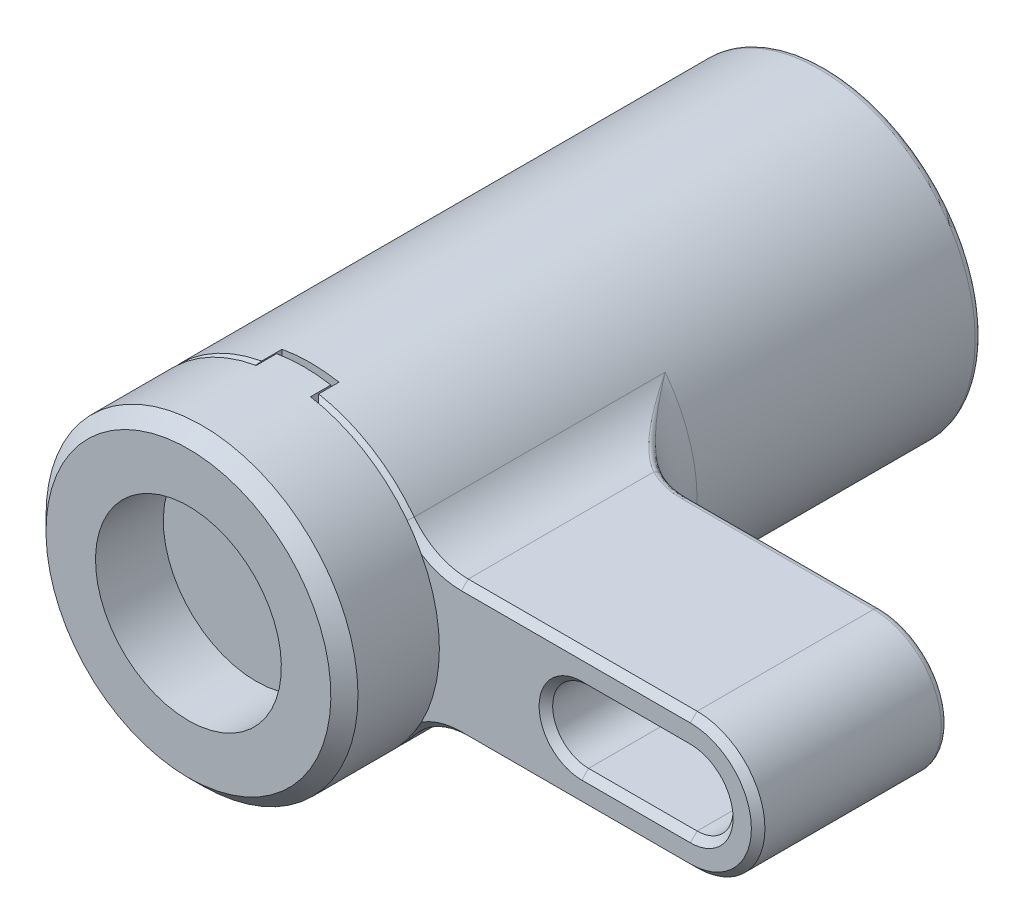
ISO-10303-21;
HEADER;
FILE_DESCRIPTION(('STEP AP214'),'2;1');
FILE_NAME('part.step','',(''),(''),'','','');
FILE_SCHEMA(('AUTOMOTIVE_DESIGN { 1 0 10303 214 1 1 1 1 }'));
ENDSEC;
DATA;
#1=APPLICATION_CONTEXT('core data for automotive mechanical design processes');
#2=APPLICATION_PROTOCOL_DEFINITION('international standard','automotive_design',2000,#1);
#3=PRODUCT_CONTEXT('',#1,'mechanical');
#4=PRODUCT('Part','Part','',(#3));
#5=PRODUCT_RELATED_PRODUCT_CATEGORY('part','',(#4));
#6=PRODUCT_DEFINITION_FORMATION('','',#4);
#7=PRODUCT_DEFINITION_CONTEXT('part definition',#1,'design');
#8=PRODUCT_DEFINITION('design','',#6,#7);
#9=PRODUCT_DEFINITION_SHAPE('','',#8);
#10=(LENGTH_UNIT() NAMED_UNIT(*) SI_UNIT(.MILLI.,.METRE.));
#11=(NAMED_UNIT(*) PLANE_ANGLE_UNIT() SI_UNIT($,.RADIAN.));
#12=(NAMED_UNIT(*) SI_UNIT($,.STERADIAN.) SOLID_ANGLE_UNIT());
#13=UNCERTAINTY_MEASURE_WITH_UNIT(LENGTH_MEASURE(1.E-05),#10,'distance_accuracy_value','');
#14=(GEOMETRIC_REPRESENTATION_CONTEXT(3) GLOBAL_UNCERTAINTY_ASSIGNED_CONTEXT((#13)) GLOBAL_UNIT_ASSIGNED_CONTEXT((#10,
#11,#12)) REPRESENTATION_CONTEXT('',''));
#15=CARTESIAN_POINT('',(0.,0.,0.));
#16=DIRECTION('',(0.,0.,1.));
#17=DIRECTION('',(1.,0.,0.));
#18=AXIS2_PLACEMENT_3D('',#15,#16,#17);
#19=CARTESIAN_POINT('',(0.,0.,40.));
#20=DIRECTION('',(0.,0.,-1.));
#21=DIRECTION('',(0.,1.,0.));
#22=AXIS2_PLACEMENT_3D('',#19,#20,#21);
#23=PLANE('',#22);
#24=CARTESIAN_POINT('',(0.,0.,40.));
#25=DIRECTION('',(0.,0.,1.));
#26=DIRECTION('',(0.,1.,0.));
#27=AXIS2_PLACEMENT_3D('',#24,#25,#26);
#28=CIRCLE('',#27,4.72791000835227);
#29=CARTESIAN_POINT('',(2.,-4.28405567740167,40.));
#30=VERTEX_POINT('',#29);
#31=CARTESIAN_POINT('',(2.6,-3.94881413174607,40.));
#32=VERTEX_POINT('',#31);
#33=EDGE_CURVE('E22',#30,#32,#28,.T.);
#34=ORIENTED_EDGE('',*,*,#33,.T.);
#35=DIRECTION('',(0.,1.,0.));
#36=VECTOR('',#35,1.);
#37=CARTESIAN_POINT('',(2.6,-3.69492895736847,40.));
#38=LINE('',#37,#36);
#39=CARTESIAN_POINT('',(2.6,-10.6883113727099,40.));
#40=VERTEX_POINT('',#39);
#41=EDGE_CURVE('E631',#40,#32,#38,.T.);
#42=ORIENTED_EDGE('',*,*,#41,.F.);
#43=CARTESIAN_POINT('',(0.,0.,40.));
#44=DIRECTION('',(0.,0.,-1.));
#45=DIRECTION('',(0.,-1.,0.));
#46=AXIS2_PLACEMENT_3D('',#43,#44,#45);
#47=CIRCLE('',#46,11.);
#48=CARTESIAN_POINT('',(8.74960316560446,-6.66666666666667,40.));
#49=VERTEX_POINT('',#48);
#50=EDGE_CURVE('E1481',#49,#40,#47,.T.);
#51=ORIENTED_EDGE('',*,*,#50,.F.);
#52=CARTESIAN_POINT('',(13.1244047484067,-10.,40.));
#53=DIRECTION('',(0.,0.,-1.));
#54=DIRECTION('',(0.,-1.,0.));
#55=AXIS2_PLACEMENT_3D('',#52,#53,#54);
#56=CIRCLE('',#55,5.5);
#57=CARTESIAN_POINT('',(10.1760703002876,-5.3570134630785,40.));
#58=VERTEX_POINT('',#57);
#59=EDGE_CURVE('E1653',#58,#49,#56,.F.);
#60=ORIENTED_EDGE('',*,*,#59,.F.);
#61=CARTESIAN_POINT('',(0.,0.,40.));
#62=DIRECTION('',(0.,0.,1.));
#63=DIRECTION('',(0.,1.,0.));
#64=AXIS2_PLACEMENT_3D('',#61,#62,#63);
#65=CIRCLE('',#64,11.5);
#66=CARTESIAN_POINT('',(2.,-11.3247516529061,40.));
#67=VERTEX_POINT('',#66);
#68=EDGE_CURVE('E422',#67,#58,#65,.T.);
#69=ORIENTED_EDGE('',*,*,#68,.F.);
#70=DIRECTION('',(0.,1.,0.));
#71=VECTOR('',#70,1.);
#72=CARTESIAN_POINT('',(2.,-11.3247516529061,40.));
#73=LINE('',#72,#71);
#74=EDGE_CURVE('E398',#67,#30,#73,.T.);
#75=ORIENTED_EDGE('',*,*,#74,.T.);
#76=EDGE_LOOP('',(#34,#42,#51,#60,#69,#75));
#77=FACE_BOUND('',#76,.T.);
#78=ADVANCED_FACE('F14',(#77),#23,.T.);
#79=CARTESIAN_POINT('',(0.,0.,40.));
#80=DIRECTION('',(0.,0.,-1.));
#81=DIRECTION('',(0.,1.,0.));
#82=AXIS2_PLACEMENT_3D('',#79,#80,#81);
#83=CYLINDRICAL_SURFACE('',#82,11.5);
#84=DIRECTION('',(0.,0.,-1.));
#85=VECTOR('',#84,1.);
#86=CARTESIAN_POINT('',(-11.4564392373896,1.,40.));
#87=LINE('',#86,#85);
#88=CARTESIAN_POINT('',(-11.4564392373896,1.,32.1));
#89=VERTEX_POINT('',#88);
#90=CARTESIAN_POINT('',(-11.4564392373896,1.,31.25));
#91=VERTEX_POINT('',#90);
#92=EDGE_CURVE('E449',#89,#91,#87,.T.);
#93=ORIENTED_EDGE('',*,*,#92,.F.);
#94=CARTESIAN_POINT('',(0.,0.,32.1));
#95=DIRECTION('',(0.,0.,-1.));
#96=DIRECTION('',(0.,-1.,0.));
#97=AXIS2_PLACEMENT_3D('',#94,#95,#96);
#98=CIRCLE('',#97,11.5);
#99=CARTESIAN_POINT('',(-10.7819293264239,-4.,32.1));
#100=VERTEX_POINT('',#99);
#101=EDGE_CURVE('E546',#100,#89,#98,.T.);
#102=ORIENTED_EDGE('',*,*,#101,.F.);
#103=DIRECTION('',(0.,0.,-1.));
#104=VECTOR('',#103,1.);
#105=CARTESIAN_POINT('',(-10.7819293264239,-4.,40.));
#106=LINE('',#105,#104);
#107=CARTESIAN_POINT('',(-10.7819293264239,-4.,33.9));
#108=VERTEX_POINT('',#107);
#109=EDGE_CURVE('E1025',#108,#100,#106,.T.);
#110=ORIENTED_EDGE('',*,*,#109,.F.);
#111=CARTESIAN_POINT('',(0.,0.,33.9));
#112=DIRECTION('',(0.,0.,1.));
#113=DIRECTION('',(0.,1.,0.));
#114=AXIS2_PLACEMENT_3D('',#111,#112,#113);
#115=CIRCLE('',#114,11.5);
#116=CARTESIAN_POINT('',(-11.4564392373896,1.,33.9));
#117=VERTEX_POINT('',#116);
#118=EDGE_CURVE('E1023',#117,#108,#115,.T.);
#119=ORIENTED_EDGE('',*,*,#118,.F.);
#120=DIRECTION('',(0.,0.,-1.));
#121=VECTOR('',#120,1.);
#122=CARTESIAN_POINT('',(-11.4564392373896,1.,40.));
#123=LINE('',#122,#121);
#124=CARTESIAN_POINT('',(-11.4564392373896,1.,34.75));
#125=VERTEX_POINT('',#124);
#126=EDGE_CURVE('E1016',#125,#117,#123,.T.);
#127=ORIENTED_EDGE('',*,*,#126,.F.);
#128=CARTESIAN_POINT('',(-10.7703445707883,4.03108891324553,33.));
#129=CARTESIAN_POINT('',(-11.0441291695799,3.29940203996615,33.4224396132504));
#130=CARTESIAN_POINT('',(-11.2162540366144,2.53882756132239,33.8615574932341));
#131=CARTESIAN_POINT('',(-11.3884834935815,1.77779092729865,34.3009421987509));
#132=CARTESIAN_POINT('',(-11.4564392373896,1.,34.75));
#133=B_SPLINE_CURVE_WITH_KNOTS('',2,(#128,#129,#130,#131,#132),.UNSPECIFIED.,.F.,.F.,(3,2,3),
(0.,0.5,1.),.UNSPECIFIED.);
#134=CARTESIAN_POINT('',(-10.7703445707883,4.03108891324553,33.));
#135=VERTEX_POINT('',#134);
#136=EDGE_CURVE('E521',#135,#125,#133,.T.);
#137=ORIENTED_EDGE('',*,*,#136,.F.);
#138=CARTESIAN_POINT('',(-11.4564392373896,0.999999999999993,31.25));
#139=CARTESIAN_POINT('',(-11.3884418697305,1.77826733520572,31.6993328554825));
#140=CARTESIAN_POINT('',(-11.2162540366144,2.53882756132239,32.1384425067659));
#141=CARTESIAN_POINT('',(-11.0439615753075,3.29984993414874,32.5778189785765));
#142=CARTESIAN_POINT('',(-10.7703445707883,4.03108891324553,33.));
#143=B_SPLINE_CURVE_WITH_KNOTS('',2,(#138,#139,#140,#141,#142),.UNSPECIFIED.,.F.,.F.,(3,2,3),
(0.,0.5,1.),.UNSPECIFIED.);
#144=EDGE_CURVE('E473',#91,#135,#143,.T.);
#145=ORIENTED_EDGE('',*,*,#144,.F.);
#146=EDGE_LOOP('',(#93,#102,#110,#119,#127,#137,#145));
#147=FACE_BOUND('',#146,.T.);
#148=ADVANCED_FACE('F495',(#147),#83,.T.);
#149=CARTESIAN_POINT('',(-11.1564392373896,1.,34.75));
#150=DIRECTION('',(0.,0.5,0.866025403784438));
#151=DIRECTION('',(0.,-0.866025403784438,0.5));
#152=AXIS2_PLACEMENT_3D('',#149,#150,#151);
#153=PLANE('',#152);
#154=ORIENTED_EDGE('',*,*,#136,.T.);
#155=DIRECTION('',(-1.,0.,0.));
#156=VECTOR('',#155,1.);
#157=CARTESIAN_POINT('',(-11.1564392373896,1.,34.75));
#158=LINE('',#157,#156);
#159=CARTESIAN_POINT('',(-11.1564392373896,1.,34.75));
#160=VERTEX_POINT('',#159);
#161=EDGE_CURVE('E479',#160,#125,#158,.T.);
#162=ORIENTED_EDGE('',*,*,#161,.F.);
#163=CARTESIAN_POINT('',(-10.4703445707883,4.03108891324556,33.));
#164=CARTESIAN_POINT('',(-10.5133507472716,3.91618401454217,33.0663439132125));
#165=CARTESIAN_POINT('',(-10.5544591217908,3.80074876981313,33.1329980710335));
#166=CARTESIAN_POINT('',(-10.6345519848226,3.56396590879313,33.2697190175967));
#167=CARTESIAN_POINT('',(-10.6733709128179,3.44257624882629,33.3398100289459));
#168=CARTESIAN_POINT('',(-10.7483831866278,3.19386659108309,33.4834041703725));
#169=CARTESIAN_POINT('',(-10.7844038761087,3.06650733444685,33.5569294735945));
#170=CARTESIAN_POINT('',(-10.8532952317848,2.80586572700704,33.7073922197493));
#171=CARTESIAN_POINT('',(-10.8859860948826,2.67254755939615,33.7843500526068));
#172=CARTESIAN_POINT('',(-10.9418369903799,2.42580525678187,33.9268144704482));
#173=CARTESIAN_POINT('',(-10.9656890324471,2.31249588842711,33.9922497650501));
#174=CARTESIAN_POINT('',(-11.011766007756,2.07596802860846,34.1288383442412));
#175=CARTESIAN_POINT('',(-11.0336928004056,1.95270571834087,34.2000165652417));
#176=CARTESIAN_POINT('',(-11.0750127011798,1.69623739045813,34.3480906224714));
#177=CARTESIAN_POINT('',(-11.0940839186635,1.56299165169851,34.4250075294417));
#178=CARTESIAN_POINT('',(-11.1287129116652,1.28657610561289,34.5845666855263));
#179=CARTESIAN_POINT('',(-11.1439249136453,1.14337364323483,34.667227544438));
#180=CARTESIAN_POINT('',(-11.1564392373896,1.00000000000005,34.75));
#181=B_SPLINE_CURVE_WITH_KNOTS('',3,(#163,#164,#165,#166,#167,#168,#169,#170,#171,#172,#173,
#174,#175,#176,#177,#178,#179,#180),.UNSPECIFIED.,.F.,.F.,(4,2,2,2,2,2,2,2,4),(0.,
0.418419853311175,0.854700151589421,1.30884937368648,1.78087501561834,2.17983872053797,
2.61182876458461,3.07684716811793,3.57489541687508),.UNSPECIFIED.);
#182=CARTESIAN_POINT('',(-10.4703445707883,4.03108891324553,33.));
#183=VERTEX_POINT('',#182);
#184=EDGE_CURVE('E524',#183,#160,#181,.T.);
#185=ORIENTED_EDGE('',*,*,#184,.F.);
#186=DIRECTION('',(-1.,0.,0.));
#187=VECTOR('',#186,1.);
#188=CARTESIAN_POINT('',(-10.4703445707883,4.03108891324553,33.));
#189=LINE('',#188,#187);
#190=EDGE_CURVE('E527',#183,#135,#189,.T.);
#191=ORIENTED_EDGE('',*,*,#190,.T.);
#192=EDGE_LOOP('',(#154,#162,#185,#191));
#193=FACE_BOUND('',#192,.T.);
#194=ADVANCED_FACE('F492',(#193),#153,.T.);
#195=CARTESIAN_POINT('',(-11.1564392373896,1.,40.));
#196=DIRECTION('',(0.,-1.,0.));
#197=DIRECTION('',(-1.,0.,0.));
#198=AXIS2_PLACEMENT_3D('',#195,#196,#197);
#199=PLANE('',#198);
#200=ORIENTED_EDGE('',*,*,#126,.T.);
#201=DIRECTION('',(-1.,0.,0.));
#202=VECTOR('',#201,1.);
#203=CARTESIAN_POINT('',(-11.1564392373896,1.,33.9));
#204=LINE('',#203,#202);
#205=CARTESIAN_POINT('',(-11.1564392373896,1.,33.9));
#206=VERTEX_POINT('',#205);
#207=EDGE_CURVE('E1018',#206,#117,#204,.T.);
#208=ORIENTED_EDGE('',*,*,#207,.F.);
#209=DIRECTION('',(0.,0.,-1.));
#210=VECTOR('',#209,1.);
#211=CARTESIAN_POINT('',(-11.1564392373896,1.,40.));
#212=LINE('',#211,#210);
#213=EDGE_CURVE('E535',#160,#206,#212,.T.);
#214=ORIENTED_EDGE('',*,*,#213,.F.);
#215=ORIENTED_EDGE('',*,*,#161,.T.);
#216=EDGE_LOOP('',(#200,#208,#214,#215));
#217=FACE_BOUND('',#216,.T.);
#218=ADVANCED_FACE('F1006',(#217),#199,.T.);
#219=CARTESIAN_POINT('',(-10.4819293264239,-4.,33.9));
#220=DIRECTION('',(0.,0.,1.));
#221=DIRECTION('',(0.,-1.,0.));
#222=AXIS2_PLACEMENT_3D('',#219,#220,#221);
#223=PLANE('',#222);
#224=ORIENTED_EDGE('',*,*,#118,.T.);
#225=DIRECTION('',(-1.,0.,0.));
#226=VECTOR('',#225,1.);
#227=CARTESIAN_POINT('',(-10.4819293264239,-4.,33.9));
#228=LINE('',#227,#226);
#229=CARTESIAN_POINT('',(-10.4819293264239,-4.,33.9));
#230=VERTEX_POINT('',#229);
#231=EDGE_CURVE('E1031',#230,#108,#228,.T.);
#232=ORIENTED_EDGE('',*,*,#231,.F.);
#233=CARTESIAN_POINT('',(0.3,0.,33.9));
#234=DIRECTION('',(0.,0.,1.));
#235=DIRECTION('',(0.,1.,0.));
#236=AXIS2_PLACEMENT_3D('',#233,#234,#235);
#237=CIRCLE('',#236,11.5);
#238=EDGE_CURVE('E1019',#206,#230,#237,.T.);
#239=ORIENTED_EDGE('',*,*,#238,.F.);
#240=ORIENTED_EDGE('',*,*,#207,.T.);
#241=EDGE_LOOP('',(#224,#232,#239,#240));
#242=FACE_BOUND('',#241,.T.);
#243=ADVANCED_FACE('F1003',(#242),#223,.T.);
#244=CARTESIAN_POINT('',(-10.4819293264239,-4.,40.));
#245=DIRECTION('',(0.,-1.,0.));
#246=DIRECTION('',(-1.,0.,0.));
#247=AXIS2_PLACEMENT_3D('',#244,#245,#246);
#248=PLANE('',#247);
#249=ORIENTED_EDGE('',*,*,#109,.T.);
#250=DIRECTION('',(-1.,0.,0.));
#251=VECTOR('',#250,1.);
#252=CARTESIAN_POINT('',(-10.4819293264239,-4.,32.1));
#253=LINE('',#252,#251);
#254=CARTESIAN_POINT('',(-10.4819293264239,-4.,32.1));
#255=VERTEX_POINT('',#254);
#256=EDGE_CURVE('E1048',#255,#100,#253,.T.);
#257=ORIENTED_EDGE('',*,*,#256,.F.);
#258=DIRECTION('',(0.,0.,-1.));
#259=VECTOR('',#258,1.);
#260=CARTESIAN_POINT('',(-10.4819293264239,-4.,40.));
#261=LINE('',#260,#259);
#262=EDGE_CURVE('E1027',#230,#255,#261,.T.);
#263=ORIENTED_EDGE('',*,*,#262,.F.);
#264=ORIENTED_EDGE('',*,*,#231,.T.);
#265=EDGE_LOOP('',(#249,#257,#263,#264));
#266=FACE_BOUND('',#265,.T.);
#267=ADVANCED_FACE('F999',(#266),#248,.T.);
#268=CARTESIAN_POINT('',(-11.1564392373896,1.,32.1));
#269=DIRECTION('',(0.,0.,-1.));
#270=DIRECTION('',(0.,1.,0.));
#271=AXIS2_PLACEMENT_3D('',#268,#269,#270);
#272=PLANE('',#271);
#273=ORIENTED_EDGE('',*,*,#101,.T.);
#274=DIRECTION('',(-1.,0.,0.));
#275=VECTOR('',#274,1.);
#276=CARTESIAN_POINT('',(-11.1564392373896,1.,32.1));
#277=LINE('',#276,#275);
#278=CARTESIAN_POINT('',(-11.1564392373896,1.,32.1));
#279=VERTEX_POINT('',#278);
#280=EDGE_CURVE('E453',#279,#89,#277,.T.);
#281=ORIENTED_EDGE('',*,*,#280,.F.);
#282=CARTESIAN_POINT('',(0.3,0.,32.1));
#283=DIRECTION('',(0.,0.,-1.));
#284=DIRECTION('',(0.,-1.,0.));
#285=AXIS2_PLACEMENT_3D('',#282,#283,#284);
#286=CIRCLE('',#285,11.5);
#287=EDGE_CURVE('E1045',#255,#279,#286,.T.);
#288=ORIENTED_EDGE('',*,*,#287,.F.);
#289=ORIENTED_EDGE('',*,*,#256,.T.);
#290=EDGE_LOOP('',(#273,#281,#288,#289));
#291=FACE_BOUND('',#290,.T.);
#292=ADVANCED_FACE('F996',(#291),#272,.T.);
#293=CARTESIAN_POINT('',(-11.1564392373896,1.,40.));
#294=DIRECTION('',(0.,-1.,0.));
#295=DIRECTION('',(-1.,0.,0.));
#296=AXIS2_PLACEMENT_3D('',#293,#294,#295);
#297=PLANE('',#296);
#298=ORIENTED_EDGE('',*,*,#92,.T.);
#299=DIRECTION('',(-1.,0.,0.));
#300=VECTOR('',#299,1.);
#301=CARTESIAN_POINT('',(-11.1564392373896,1.,31.25));
#302=LINE('',#301,#300);
#303=CARTESIAN_POINT('',(-11.1564392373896,1.,31.25));
#304=VERTEX_POINT('',#303);
#305=EDGE_CURVE('E542',#304,#91,#302,.T.);
#306=ORIENTED_EDGE('',*,*,#305,.F.);
#307=DIRECTION('',(0.,0.,-1.));
#308=VECTOR('',#307,1.);
#309=CARTESIAN_POINT('',(-11.1564392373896,1.,40.));
#310=LINE('',#309,#308);
#311=EDGE_CURVE('E458',#279,#304,#310,.T.);
#312=ORIENTED_EDGE('',*,*,#311,.F.);
#313=ORIENTED_EDGE('',*,*,#280,.T.);
#314=EDGE_LOOP('',(#298,#306,#312,#313));
#315=FACE_BOUND('',#314,.T.);
#316=ADVANCED_FACE('F491',(#315),#297,.T.);
#317=CARTESIAN_POINT('',(-10.4703445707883,4.03108891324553,33.));
#318=DIRECTION('',(0.,0.5,-0.866025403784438));
#319=DIRECTION('',(0.,0.866025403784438,0.5));
#320=AXIS2_PLACEMENT_3D('',#317,#318,#319);
#321=PLANE('',#320);
#322=ORIENTED_EDGE('',*,*,#144,.T.);
#323=ORIENTED_EDGE('',*,*,#190,.F.);
#324=CARTESIAN_POINT('',(-11.1564392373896,1.00000000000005,31.25));
#325=CARTESIAN_POINT('',(-11.1439243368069,1.14338025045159,31.3327762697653));
#326=CARTESIAN_POINT('',(-11.1287115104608,1.28658929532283,31.4154409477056));
#327=CARTESIAN_POINT('',(-11.094080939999,1.56301355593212,31.5750051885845));
#328=CARTESIAN_POINT('',(-11.0750091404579,1.69626144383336,31.6519233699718));
#329=CARTESIAN_POINT('',(-11.0336886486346,1.95272967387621,31.7999974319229));
#330=CARTESIAN_POINT('',(-11.011761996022,2.07598975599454,31.8711743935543));
#331=CARTESIAN_POINT('',(-10.96568630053,2.3125088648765,32.007757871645));
#332=CARTESIAN_POINT('',(-10.9418355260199,2.42581172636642,32.0731893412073));
#333=CARTESIAN_POINT('',(-10.8859851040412,2.67255193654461,32.2156523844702));
#334=CARTESIAN_POINT('',(-10.8532930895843,2.80587446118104,32.2926126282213));
#335=CARTESIAN_POINT('',(-10.7843998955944,3.06652178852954,32.4430785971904));
#336=CARTESIAN_POINT('',(-10.7483786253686,3.19388243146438,32.5166047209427));
#337=CARTESIAN_POINT('',(-10.6733659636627,3.44259196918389,32.6601988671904));
#338=CARTESIAN_POINT('',(-10.6345473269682,3.563980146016,32.7302890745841));
#339=CARTESIAN_POINT('',(-10.5544561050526,3.80075724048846,32.867006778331));
#340=CARTESIAN_POINT('',(-10.5133491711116,3.91618822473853,32.9336585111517));
#341=CARTESIAN_POINT('',(-10.4703445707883,4.03108891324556,33.));
#342=B_SPLINE_CURVE_WITH_KNOTS('',3,(#324,#325,#326,#327,#328,#329,#330,#331,#332,#333,#334,
#335,#336,#337,#338,#339,#340,#341),.UNSPECIFIED.,.F.,.F.,(4,2,2,2,2,2,2,2,4),(0.,
0.498071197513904,0.963097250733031,1.39507964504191,1.79402040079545,2.26606136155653,
2.72021569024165,3.15649088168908,3.574895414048),.UNSPECIFIED.);
#343=EDGE_CURVE('E523',#304,#183,#342,.T.);
#344=ORIENTED_EDGE('',*,*,#343,.F.);
#345=ORIENTED_EDGE('',*,*,#305,.T.);
#346=EDGE_LOOP('',(#322,#323,#344,#345));
#347=FACE_BOUND('',#346,.T.);
#348=ADVANCED_FACE('F481',(#347),#321,.T.);
#349=CARTESIAN_POINT('',(30.,0.,26.5));
#350=DIRECTION('',(0.,0.,1.));
#351=DIRECTION('',(0.,-1.,0.));
#352=AXIS2_PLACEMENT_3D('',#349,#350,#351);
#353=TOROIDAL_SURFACE('',#352,4.5,0.5);
#354=CARTESIAN_POINT('',(30.,-4.5,26.5));
#355=DIRECTION('',(-1.,0.,0.));
#356=DIRECTION('',(0.,-1.,0.));
#357=AXIS2_PLACEMENT_3D('',#354,#355,#356);
#358=CIRCLE('',#357,0.5);
#359=CARTESIAN_POINT('',(30.,-4.5,26.));
#360=VERTEX_POINT('',#359);
#361=CARTESIAN_POINT('',(30.,-5.,26.5));
#362=VERTEX_POINT('',#361);
#363=EDGE_CURVE('E1438',#360,#362,#358,.T.);
#364=ORIENTED_EDGE('',*,*,#363,.F.);
#365=CARTESIAN_POINT('',(30.,0.,26.));
#366=DIRECTION('',(0.,0.,-1.));
#367=DIRECTION('',(0.,-1.,0.));
#368=AXIS2_PLACEMENT_3D('',#365,#366,#367);
#369=CIRCLE('',#368,4.5);
#370=CARTESIAN_POINT('',(30.,4.5,26.));
#371=VERTEX_POINT('',#370);
#372=EDGE_CURVE('E1376',#360,#371,#369,.F.);
#373=ORIENTED_EDGE('',*,*,#372,.T.);
#374=CARTESIAN_POINT('',(30.,4.5,26.5));
#375=DIRECTION('',(1.,0.,0.));
#376=DIRECTION('',(0.,1.,0.));
#377=AXIS2_PLACEMENT_3D('',#374,#375,#376);
#378=CIRCLE('',#377,0.5);
#379=CARTESIAN_POINT('',(30.,5.,26.5));
#380=VERTEX_POINT('',#379);
#381=EDGE_CURVE('E952',#371,#380,#378,.T.);
#382=ORIENTED_EDGE('',*,*,#381,.T.);
#383=CARTESIAN_POINT('',(30.,0.,26.5));
#384=DIRECTION('',(0.,0.,-1.));
#385=DIRECTION('',(0.,-1.,0.));
#386=AXIS2_PLACEMENT_3D('',#383,#384,#385);
#387=CIRCLE('',#386,5.);
#388=EDGE_CURVE('E814',#380,#362,#387,.T.);
#389=ORIENTED_EDGE('',*,*,#388,.T.);
#390=EDGE_LOOP('',(#364,#373,#382,#389));
#391=FACE_BOUND('',#390,.T.);
#392=ADVANCED_FACE('F490',(#391),#353,.T.);
#393=CARTESIAN_POINT('',(30.,3.15,26.5));
#394=DIRECTION('',(-1.,0.,0.));
#395=DIRECTION('',(0.,1.,0.));
#396=AXIS2_PLACEMENT_3D('',#393,#394,#395);
#397=CYLINDRICAL_SURFACE('',#396,0.5);
#398=CARTESIAN_POINT('',(30.,3.15,26.5));
#399=DIRECTION('',(1.,0.,0.));
#400=DIRECTION('',(0.,1.,0.));
#401=AXIS2_PLACEMENT_3D('',#398,#399,#400);
#402=CIRCLE('',#401,0.5);
#403=CARTESIAN_POINT('',(30.,2.65,26.5));
#404=VERTEX_POINT('',#403);
#405=CARTESIAN_POINT('',(30.,3.15,26.));
#406=VERTEX_POINT('',#405);
#407=EDGE_CURVE('E879',#404,#406,#402,.T.);
#408=ORIENTED_EDGE('',*,*,#407,.F.);
#409=DIRECTION('',(-1.,0.,0.));
#410=VECTOR('',#409,1.);
#411=CARTESIAN_POINT('',(30.,2.65,26.5));
#412=LINE('',#411,#410);
#413=CARTESIAN_POINT('',(22.,2.65,26.5));
#414=VERTEX_POINT('',#413);
#415=EDGE_CURVE('E1393',#404,#414,#412,.T.);
#416=ORIENTED_EDGE('',*,*,#415,.T.);
#417=CARTESIAN_POINT('',(22.,3.15,26.5));
#418=DIRECTION('',(1.,0.,0.));
#419=DIRECTION('',(0.,1.,0.));
#420=AXIS2_PLACEMENT_3D('',#417,#418,#419);
#421=CIRCLE('',#420,0.5);
#422=CARTESIAN_POINT('',(22.,3.15,26.));
#423=VERTEX_POINT('',#422);
#424=EDGE_CURVE('E872',#414,#423,#421,.T.);
#425=ORIENTED_EDGE('',*,*,#424,.T.);
#426=DIRECTION('',(-1.,0.,0.));
#427=VECTOR('',#426,1.);
#428=CARTESIAN_POINT('',(0.,3.15,26.));
#429=LINE('',#428,#427);
#430=EDGE_CURVE('E1388',#423,#406,#429,.F.);
#431=ORIENTED_EDGE('',*,*,#430,.T.);
#432=EDGE_LOOP('',(#408,#416,#425,#431));
#433=FACE_BOUND('',#432,.T.);
#434=ADVANCED_FACE('F960',(#433),#397,.T.);
#435=CARTESIAN_POINT('',(30.,0.,26.5));
#436=DIRECTION('',(0.,0.,1.));
#437=DIRECTION('',(0.,-1.,0.));
#438=AXIS2_PLACEMENT_3D('',#435,#436,#437);
#439=TOROIDAL_SURFACE('',#438,3.15,0.5);
#440=CARTESIAN_POINT('',(30.,-3.15,26.5));
#441=DIRECTION('',(1.,0.,0.));
#442=DIRECTION('',(0.,1.,0.));
#443=AXIS2_PLACEMENT_3D('',#440,#441,#442);
#444=CIRCLE('',#443,0.5);
#445=CARTESIAN_POINT('',(30.,-3.15,26.));
#446=VERTEX_POINT('',#445);
#447=CARTESIAN_POINT('',(30.,-2.65,26.5));
#448=VERTEX_POINT('',#447);
#449=EDGE_CURVE('E876',#446,#448,#444,.T.);
#450=ORIENTED_EDGE('',*,*,#449,.T.);
#451=CARTESIAN_POINT('',(30.,0.,26.5));
#452=DIRECTION('',(0.,0.,-1.));
#453=DIRECTION('',(0.,-1.,0.));
#454=AXIS2_PLACEMENT_3D('',#451,#452,#453);
#455=CIRCLE('',#454,2.65);
#456=EDGE_CURVE('E1396',#448,#404,#455,.F.);
#457=ORIENTED_EDGE('',*,*,#456,.T.);
#458=ORIENTED_EDGE('',*,*,#407,.T.);
#459=CARTESIAN_POINT('',(30.,0.,26.));
#460=DIRECTION('',(0.,0.,-1.));
#461=DIRECTION('',(0.,-1.,0.));
#462=AXIS2_PLACEMENT_3D('',#459,#460,#461);
#463=CIRCLE('',#462,3.15);
#464=EDGE_CURVE('E1385',#406,#446,#463,.T.);
#465=ORIENTED_EDGE('',*,*,#464,.T.);
#466=EDGE_LOOP('',(#450,#457,#458,#465));
#467=FACE_BOUND('',#466,.T.);
#468=ADVANCED_FACE('F903',(#467),#439,.T.);
#469=CARTESIAN_POINT('',(30.,-3.15,26.5));
#470=DIRECTION('',(1.,0.,0.));
#471=DIRECTION('',(0.,-1.,0.));
#472=AXIS2_PLACEMENT_3D('',#469,#470,#471);
#473=CYLINDRICAL_SURFACE('',#472,0.5);
#474=ORIENTED_EDGE('',*,*,#449,.F.);
#475=DIRECTION('',(1.,0.,0.));
#476=VECTOR('',#475,1.);
#477=CARTESIAN_POINT('',(0.,-3.15,26.));
#478=LINE('',#477,#476);
#479=CARTESIAN_POINT('',(22.,-3.15,26.));
#480=VERTEX_POINT('',#479);
#481=EDGE_CURVE('E1382',#446,#480,#478,.F.);
#482=ORIENTED_EDGE('',*,*,#481,.T.);
#483=CARTESIAN_POINT('',(22.,-3.15,26.5));
#484=DIRECTION('',(1.,0.,0.));
#485=DIRECTION('',(0.,1.,0.));
#486=AXIS2_PLACEMENT_3D('',#483,#484,#485);
#487=CIRCLE('',#486,0.5);
#488=CARTESIAN_POINT('',(22.,-2.65,26.5));
#489=VERTEX_POINT('',#488);
#490=EDGE_CURVE('E869',#480,#489,#487,.T.);
#491=ORIENTED_EDGE('',*,*,#490,.T.);
#492=DIRECTION('',(1.,0.,0.));
#493=VECTOR('',#492,1.);
#494=CARTESIAN_POINT('',(30.,-2.65,26.5));
#495=LINE('',#494,#493);
#496=EDGE_CURVE('E860',#489,#448,#495,.T.);
#497=ORIENTED_EDGE('',*,*,#496,.T.);
#498=EDGE_LOOP('',(#474,#482,#491,#497));
#499=FACE_BOUND('',#498,.T.);
#500=ADVANCED_FACE('F1636',(#499),#473,.T.);
#501=CARTESIAN_POINT('',(22.,0.,26.5));
#502=DIRECTION('',(0.,0.,1.));
#503=DIRECTION('',(0.,-1.,0.));
#504=AXIS2_PLACEMENT_3D('',#501,#502,#503);
#505=TOROIDAL_SURFACE('',#504,3.15,0.5);
#506=ORIENTED_EDGE('',*,*,#424,.F.);
#507=CARTESIAN_POINT('',(22.,0.,26.5));
#508=DIRECTION('',(0.,0.,-1.));
#509=DIRECTION('',(0.,-1.,0.));
#510=AXIS2_PLACEMENT_3D('',#507,#508,#509);
#511=CIRCLE('',#510,2.65);
#512=EDGE_CURVE('E1371',#414,#489,#511,.F.);
#513=ORIENTED_EDGE('',*,*,#512,.T.);
#514=ORIENTED_EDGE('',*,*,#490,.F.);
#515=CARTESIAN_POINT('',(22.,0.,26.));
#516=DIRECTION('',(0.,0.,-1.));
#517=DIRECTION('',(0.,-1.,0.));
#518=AXIS2_PLACEMENT_3D('',#515,#516,#517);
#519=CIRCLE('',#518,3.15);
#520=EDGE_CURVE('E1391',#480,#423,#519,.T.);
#521=ORIENTED_EDGE('',*,*,#520,.T.);
#522=EDGE_LOOP('',(#506,#513,#514,#521));
#523=FACE_BOUND('',#522,.T.);
#524=ADVANCED_FACE('F826',(#523),#505,.T.);
#525=CARTESIAN_POINT('',(0.,0.,1.));
#526=DIRECTION('',(0.,0.,1.));
#527=DIRECTION('',(0.,-1.,0.));
#528=AXIS2_PLACEMENT_3D('',#525,#526,#527);
#529=TOROIDAL_SURFACE('',#528,9.,1.);
#530=CARTESIAN_POINT('',(0.,0.,1.));
#531=DIRECTION('',(0.,0.,-1.));
#532=DIRECTION('',(0.,-1.,0.));
#533=AXIS2_PLACEMENT_3D('',#530,#531,#532);
#534=CIRCLE('',#533,8.);
#535=CARTESIAN_POINT('',(0.,-8.,1.));
#536=VERTEX_POINT('',#535);
#537=EDGE_CURVE('E1165',#536,#536,#534,.F.);
#538=ORIENTED_EDGE('',*,*,#537,.T.);
#539=EDGE_LOOP('',(#538));
#540=FACE_BOUND('',#539,.T.);
#541=CARTESIAN_POINT('',(0.,0.,0.));
#542=DIRECTION('',(0.,0.,-1.));
#543=DIRECTION('',(0.,-1.,0.));
#544=AXIS2_PLACEMENT_3D('',#541,#542,#543);
#545=CIRCLE('',#544,9.);
#546=CARTESIAN_POINT('',(0.,-9.,0.));
#547=VERTEX_POINT('',#546);
#548=EDGE_CURVE('E700',#547,#547,#545,.T.);
#549=ORIENTED_EDGE('',*,*,#548,.T.);
#550=EDGE_LOOP('',(#549));
#551=FACE_BOUND('',#550,.T.);
#552=ADVANCED_FACE('F1683',(#540,#551),#529,.T.);
#553=CARTESIAN_POINT('',(30.,-4.5,26.5));
#554=DIRECTION('',(-1.,0.,0.));
#555=DIRECTION('',(0.,1.,0.));
#556=AXIS2_PLACEMENT_3D('',#553,#554,#555);
#557=CYLINDRICAL_SURFACE('',#556,0.5);
#558=CARTESIAN_POINT('',(15.8745078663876,-4.5,26.5));
#559=DIRECTION('',(-1.,0.,0.));
#560=DIRECTION('',(0.,-1.,0.));
#561=AXIS2_PLACEMENT_3D('',#558,#559,#560);
#562=CIRCLE('',#561,0.5);
#563=CARTESIAN_POINT('',(15.8745078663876,-4.5,26.));
#564=VERTEX_POINT('',#563);
#565=CARTESIAN_POINT('',(15.8745078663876,-5.,26.5));
#566=VERTEX_POINT('',#565);
#567=EDGE_CURVE('E1436',#564,#566,#562,.T.);
#568=ORIENTED_EDGE('',*,*,#567,.F.);
#569=DIRECTION('',(-1.,0.,0.));
#570=VECTOR('',#569,1.);
#571=CARTESIAN_POINT('',(0.,-4.5,26.));
#572=LINE('',#571,#570);
#573=EDGE_CURVE('E1374',#564,#360,#572,.F.);
#574=ORIENTED_EDGE('',*,*,#573,.T.);
#575=ORIENTED_EDGE('',*,*,#363,.T.);
#576=DIRECTION('',(-1.,0.,0.));
#577=VECTOR('',#576,1.);
#578=CARTESIAN_POINT('',(30.,-5.,26.5));
#579=LINE('',#578,#577);
#580=EDGE_CURVE('E813',#362,#566,#579,.T.);
#581=ORIENTED_EDGE('',*,*,#580,.T.);
#582=EDGE_LOOP('',(#568,#574,#575,#581));
#583=FACE_BOUND('',#582,.T.);
#584=ADVANCED_FACE('F836',(#583),#557,.T.);
#585=CARTESIAN_POINT('',(30.,4.5,26.5));
#586=DIRECTION('',(1.,0.,0.));
#587=DIRECTION('',(0.,-1.,0.));
#588=AXIS2_PLACEMENT_3D('',#585,#586,#587);
#589=CYLINDRICAL_SURFACE('',#588,0.5);
#590=ORIENTED_EDGE('',*,*,#381,.F.);
#591=DIRECTION('',(1.,0.,0.));
#592=VECTOR('',#591,1.);
#593=CARTESIAN_POINT('',(0.,4.5,26.));
#594=LINE('',#593,#592);
#595=CARTESIAN_POINT('',(15.8745078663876,4.5,26.));
#596=VERTEX_POINT('',#595);
#597=EDGE_CURVE('E1379',#371,#596,#594,.F.);
#598=ORIENTED_EDGE('',*,*,#597,.T.);
#599=CARTESIAN_POINT('',(15.8745078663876,4.5,26.5));
#600=DIRECTION('',(1.,0.,0.));
#601=DIRECTION('',(0.,1.,0.));
#602=AXIS2_PLACEMENT_3D('',#599,#600,#601);
#603=CIRCLE('',#602,0.5);
#604=CARTESIAN_POINT('',(15.8745078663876,5.,26.5));
#605=VERTEX_POINT('',#604);
#606=EDGE_CURVE('E885',#596,#605,#603,.T.);
#607=ORIENTED_EDGE('',*,*,#606,.T.);
#608=DIRECTION('',(1.,0.,0.));
#609=VECTOR('',#608,1.);
#610=CARTESIAN_POINT('',(30.,5.,26.5));
#611=LINE('',#610,#609);
#612=EDGE_CURVE('E919',#605,#380,#611,.T.);
#613=ORIENTED_EDGE('',*,*,#612,.T.);
#614=EDGE_LOOP('',(#590,#598,#607,#613));
#615=FACE_BOUND('',#614,.T.);
#616=ADVANCED_FACE('F956',(#615),#589,.T.);
#617=CARTESIAN_POINT('',(0.,0.,26.));
#618=DIRECTION('',(0.,0.,1.));
#619=DIRECTION('',(0.,-1.,0.));
#620=AXIS2_PLACEMENT_3D('',#617,#618,#619);
#621=PLANE('',#620);
#622=ORIENTED_EDGE('',*,*,#481,.F.);
#623=ORIENTED_EDGE('',*,*,#464,.F.);
#624=ORIENTED_EDGE('',*,*,#430,.F.);
#625=ORIENTED_EDGE('',*,*,#520,.F.);
#626=EDGE_LOOP('',(#622,#623,#624,#625));
#627=FACE_BOUND('',#626,.T.);
#628=ORIENTED_EDGE('',*,*,#372,.F.);
#629=ORIENTED_EDGE('',*,*,#573,.F.);
#630=CARTESIAN_POINT('',(0.,0.,26.));
#631=DIRECTION('',(0.,0.,-1.));
#632=DIRECTION('',(0.,-1.,0.));
#633=AXIS2_PLACEMENT_3D('',#630,#631,#632);
#634=CIRCLE('',#633,16.5);
#635=EDGE_CURVE('E1365',#596,#564,#634,.T.);
#636=ORIENTED_EDGE('',*,*,#635,.F.);
#637=ORIENTED_EDGE('',*,*,#597,.F.);
#638=EDGE_LOOP('',(#628,#629,#636,#637));
#639=FACE_BOUND('',#638,.T.);
#640=ADVANCED_FACE('F834',(#627,#639),#621,.F.);
#641=CARTESIAN_POINT('',(17.7979439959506,-5.,26.1766563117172));
#642=CARTESIAN_POINT('',(17.6194017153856,-5.,25.6635627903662));
#643=CARTESIAN_POINT('',(17.6341864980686,-4.45859585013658,25.7060511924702));
#644=CARTESIAN_POINT('',(17.6436690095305,-5.,26.2303385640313));
#645=CARTESIAN_POINT('',(17.4812122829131,-5.,25.7150985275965));
#646=CARTESIAN_POINT('',(17.4931790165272,-4.46159149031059,25.7548532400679));
#647=CARTESIAN_POINT('',(17.4871895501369,-5.,26.2774269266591));
#648=CARTESIAN_POINT('',(17.3403176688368,-5.,25.7610746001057));
#649=CARTESIAN_POINT('',(17.3501290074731,-4.46470092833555,25.7976608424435));
#650=CARTESIAN_POINT('',(17.1708512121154,-5.,26.358254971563));
#651=CARTESIAN_POINT('',(17.0547356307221,-5.,25.8411734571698));
#652=CARTESIAN_POINT('',(17.0608744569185,-4.47114842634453,25.8711408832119));
#653=CARTESIAN_POINT('',(17.010992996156,-5.,26.3919972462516));
#654=CARTESIAN_POINT('',(16.9101346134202,-5.,25.8753628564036));
#655=CARTESIAN_POINT('',(16.9146705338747,-4.47448644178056,25.9018156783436));
#656=CARTESIAN_POINT('',(16.5279653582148,-5.,26.4729638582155));
#657=CARTESIAN_POINT('',(16.4735744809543,-5.,25.9595005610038));
#658=CARTESIAN_POINT('',(16.472788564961,-4.48484321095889,25.9754216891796));
#659=CARTESIAN_POINT('',(16.2011848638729,-5.,26.4999825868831));
#660=CARTESIAN_POINT('',(16.1760427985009,-5.,25.9921334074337));
#661=CARTESIAN_POINT('',(16.1736958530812,-4.49220771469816,25.9999841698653));
#662=CARTESIAN_POINT('',(15.5358198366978,-5.,26.5000180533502));
#663=CARTESIAN_POINT('',(15.5668081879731,-5.,26.0080274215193));
#664=CARTESIAN_POINT('',(15.564319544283,-4.5080787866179,26.0000164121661));
#665=CARTESIAN_POINT('',(15.197243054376,-5.,26.4710127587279));
#666=CARTESIAN_POINT('',(15.2552951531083,-5.,25.9902565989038));
#667=CARTESIAN_POINT('',(15.2540288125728,-4.51661738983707,25.973647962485));
#668=CARTESIAN_POINT('',(14.5301823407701,-5.,26.3565522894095));
#669=CARTESIAN_POINT('',(14.6379732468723,-5.,25.9015962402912));
#670=CARTESIAN_POINT('',(14.6421992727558,-4.53448774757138,25.8695929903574));
#671=CARTESIAN_POINT('',(14.2016814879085,-5.,26.2711978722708));
#672=CARTESIAN_POINT('',(14.3324116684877,-5.,25.8317365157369));
#673=CARTESIAN_POINT('',(14.3406458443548,-4.54381806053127,25.7919980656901));
#674=CARTESIAN_POINT('',(13.7529155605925,-5.,26.1135091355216));
#675=CARTESIAN_POINT('',(13.9107411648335,-5.,25.6966607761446));
#676=CARTESIAN_POINT('',(13.9282919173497,-4.55734628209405,25.6486446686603));
#677=CARTESIAN_POINT('',(13.6245012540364,-5.,26.063379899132));
#678=CARTESIAN_POINT('',(13.7904358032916,-5.,25.6535706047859));
#679=CARTESIAN_POINT('',(13.8102480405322,-4.56131268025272,25.6030726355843));
#680=CARTESIAN_POINT('',(13.3714993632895,-5.,25.9545275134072));
#681=CARTESIAN_POINT('',(13.5529611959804,-5.,25.5591726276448));
#682=CARTESIAN_POINT('',(13.5775784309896,-4.56931528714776,25.5041159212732));
#683=CARTESIAN_POINT('',(13.2469088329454,-5.,25.8958111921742));
#684=CARTESIAN_POINT('',(13.435775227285,-5.,25.5079320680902));
#685=CARTESIAN_POINT('',(13.4629500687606,-4.57335143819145,25.4507374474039));
#686=CARTESIAN_POINT('',(12.8328669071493,-5.,25.6830064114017));
#687=CARTESIAN_POINT('',(13.0474497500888,-5.,25.3218111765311));
#688=CARTESIAN_POINT('',(13.0818384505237,-4.58708663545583,25.2572785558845));
#689=CARTESIAN_POINT('',(12.5531457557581,-5.,25.509111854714));
#690=CARTESIAN_POINT('',(12.7822985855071,-5.,25.1674834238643));
#691=CARTESIAN_POINT('',(12.8240643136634,-4.59691500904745,25.099192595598));
#692=CARTESIAN_POINT('',(12.1574270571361,-5.,25.2152199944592));
#693=CARTESIAN_POINT('',(12.4045228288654,-5.,24.90235958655));
#694=CARTESIAN_POINT('',(12.4589594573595,-4.6115562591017,24.8320181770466));
#695=CARTESIAN_POINT('',(12.0290892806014,-5.,25.1113234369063));
#696=CARTESIAN_POINT('',(12.2821601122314,-5.,24.8086267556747));
#697=CARTESIAN_POINT('',(12.3404723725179,-4.6164367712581,24.7375667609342));
#698=CARTESIAN_POINT('',(11.7816439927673,-5.,24.8931250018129));
#699=CARTESIAN_POINT('',(12.0458735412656,-5.,24.6109419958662));
#700=CARTESIAN_POINT('',(12.1118766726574,-4.62608167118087,24.5392045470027));
#701=CARTESIAN_POINT('',(11.6625343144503,-5.,24.7788255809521));
#702=CARTESIAN_POINT('',(11.9318509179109,-5.,24.5070445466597));
#703=CARTESIAN_POINT('',(12.0017660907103,-4.63084608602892,24.435295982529));
#704=CARTESIAN_POINT('',(11.5484312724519,-5.,24.6595669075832));
#705=CARTESIAN_POINT('',(11.8220532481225,-5.,24.397821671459));
#706=CARTESIAN_POINT('',(11.896214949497,-4.63551854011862,24.3268790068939));
#707=(BOUNDED_SURFACE() B_SPLINE_SURFACE(3,2,((#641,#642,#643),(#644,#645,#646),(#647,#648,
#649),(#650,#651,#652),(#653,#654,#655),(#656,#657,#658),(#659,#660,#661),(#662,#663,#664),
(#665,#666,#667),(#668,#669,#670),(#671,#672,#673),(#674,#675,#676),(#677,#678,#679),(#680,#681,
#682),(#683,#684,#685),(#686,#687,#688),(#689,#690,#691),(#692,#693,#694),(#695,#696,#697),
(#698,#699,#700),(#701,#702,#703),(#704,#705,#706)),.UNSPECIFIED.,.F.,.F.,
.F.) B_SPLINE_SURFACE_WITH_KNOTS((4,2,2,2,2,2,2,2,2,2,4),(3,3),(0.,0.489732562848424,
0.979369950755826,1.9581493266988,2.97291578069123,3.9858726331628,4.39916673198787,
4.81213396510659,5.79492222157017,6.28980911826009,6.78457944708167),(0.,1.),
.UNSPECIFIED.) GEOMETRIC_REPRESENTATION_ITEM() RATIONAL_B_SPLINE_SURFACE(((1.,0.677197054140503,
1.),(1.,0.679408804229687,1.),(1.,0.681693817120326,1.),(1.,0.686406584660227,1.),(1.,
0.688834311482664,1.),(1.,0.696324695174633,1.),(1.,0.701596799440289,1.),(1.,0.712819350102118,
1.),(1.,0.718787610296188,1.),(1.,0.73111248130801,1.),(1.,0.737468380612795,1.),(1.,
0.746560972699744,1.),(1.,0.74921275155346,1.),(1.,0.754534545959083,1.),(1.,0.757204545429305,
1.),(1.,0.766242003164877,1.),(1.,0.772627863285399,1.),(1.,0.78202704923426,1.),(1.,
0.78514080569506,1.),(1.,0.791259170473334,1.),(1.,0.794263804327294,1.),(1.,0.797194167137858,1.))) REPRESENTATION_ITEM('') SURFACE());
#708=CARTESIAN_POINT('',(13.1244047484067,-4.5,25.8328478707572));
#709=DIRECTION('',(-0.889425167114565,0.,-0.45708081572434));
#710=DIRECTION('',(0.45708081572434,0.,-0.889425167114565));
#711=AXIS2_PLACEMENT_3D('',#708,#709,#710);
#712=CIRCLE('',#711,0.5);
#713=CARTESIAN_POINT('',(13.3501891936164,-4.5774153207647,25.3934980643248));
#714=VERTEX_POINT('',#713);
#715=CARTESIAN_POINT('',(13.1244047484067,-5.,25.8328478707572));
#716=VERTEX_POINT('',#715);
#717=EDGE_CURVE('E873',#714,#716,#712,.T.);
#718=ORIENTED_EDGE('',*,*,#717,.F.);
#719=CARTESIAN_POINT('',(11.896214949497,-4.63551854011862,24.3268790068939));
#720=CARTESIAN_POINT('',(12.0017660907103,-4.63084608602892,24.435295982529));
#721=CARTESIAN_POINT('',(12.1118766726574,-4.62608167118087,24.5392045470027));
#722=CARTESIAN_POINT('',(12.3404723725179,-4.6164367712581,24.7375667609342));
#723=CARTESIAN_POINT('',(12.4589594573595,-4.6115562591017,24.8320181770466));
#724=CARTESIAN_POINT('',(12.8240643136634,-4.59691500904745,25.099192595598));
#725=CARTESIAN_POINT('',(13.0818384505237,-4.58708663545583,25.2572785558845));
#726=CARTESIAN_POINT('',(13.4629500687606,-4.57335143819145,25.4507374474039));
#727=CARTESIAN_POINT('',(13.5775784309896,-4.56931528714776,25.5041159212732));
#728=CARTESIAN_POINT('',(13.8102480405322,-4.56131268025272,25.6030726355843));
#729=CARTESIAN_POINT('',(13.9282919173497,-4.55734628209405,25.6486446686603));
#730=CARTESIAN_POINT('',(14.3406458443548,-4.54381806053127,25.7919980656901));
#731=CARTESIAN_POINT('',(14.6421992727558,-4.53448774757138,25.8695929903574));
#732=CARTESIAN_POINT('',(15.2540288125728,-4.51661738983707,25.973647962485));
#733=CARTESIAN_POINT('',(15.564319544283,-4.5080787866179,26.0000164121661));
#734=CARTESIAN_POINT('',(16.1736958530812,-4.49220771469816,25.9999841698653));
#735=CARTESIAN_POINT('',(16.472788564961,-4.48484321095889,25.9754216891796));
#736=CARTESIAN_POINT('',(16.9146705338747,-4.47448644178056,25.9018156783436));
#737=CARTESIAN_POINT('',(17.0608744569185,-4.47114842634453,25.8711408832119));
#738=CARTESIAN_POINT('',(17.3501290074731,-4.46470092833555,25.7976608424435));
#739=CARTESIAN_POINT('',(17.4931790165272,-4.46159149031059,25.7548532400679));
#740=CARTESIAN_POINT('',(17.6341864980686,-4.45859585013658,25.7060511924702));
#741=B_SPLINE_CURVE_WITH_KNOTS('',3,(#719,#720,#721,#722,#723,#724,#725,#726,#727,#728,#729,
#730,#731,#732,#733,#734,#735,#736,#737,#738,#739,#740),.UNSPECIFIED.,.F.,.F.,(4,2,2,2,2,2,2,2,
2,2,4),(0.,0.494770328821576,0.989657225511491,1.97244548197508,2.38541271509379,
2.79870681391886,3.81166366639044,4.82643012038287,5.80520949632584,6.29484688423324,
6.78457944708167),.UNSPECIFIED.);
#742=EDGE_CURVE('E1406',#714,#564,#741,.T.);
#743=ORIENTED_EDGE('',*,*,#742,.T.);
#744=ORIENTED_EDGE('',*,*,#567,.T.);
#745=CARTESIAN_POINT('',(17.7979439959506,-5.,26.1766563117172));
#746=CARTESIAN_POINT('',(17.6436690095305,-5.,26.2303385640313));
#747=CARTESIAN_POINT('',(17.4871895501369,-5.,26.2774269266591));
#748=CARTESIAN_POINT('',(17.1708512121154,-5.,26.358254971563));
#749=CARTESIAN_POINT('',(17.010992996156,-5.,26.3919972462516));
#750=CARTESIAN_POINT('',(16.5279653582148,-5.,26.4729638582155));
#751=CARTESIAN_POINT('',(16.2011848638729,-5.,26.4999825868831));
#752=CARTESIAN_POINT('',(15.5358198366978,-5.,26.5000180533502));
#753=CARTESIAN_POINT('',(15.197243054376,-5.,26.4710127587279));
#754=CARTESIAN_POINT('',(14.5301823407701,-5.,26.3565522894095));
#755=CARTESIAN_POINT('',(14.2016814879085,-5.,26.2711978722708));
#756=CARTESIAN_POINT('',(13.7529155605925,-5.,26.1135091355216));
#757=CARTESIAN_POINT('',(13.6245012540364,-5.,26.063379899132));
#758=CARTESIAN_POINT('',(13.3714993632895,-5.,25.9545275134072));
#759=CARTESIAN_POINT('',(13.2469088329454,-5.,25.8958111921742));
#760=CARTESIAN_POINT('',(12.8328669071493,-5.,25.6830064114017));
#761=CARTESIAN_POINT('',(12.5531457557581,-5.,25.509111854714));
#762=CARTESIAN_POINT('',(12.1574270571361,-5.,25.2152199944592));
#763=CARTESIAN_POINT('',(12.0290892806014,-5.,25.1113234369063));
#764=CARTESIAN_POINT('',(11.7816439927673,-5.,24.8931250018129));
#765=CARTESIAN_POINT('',(11.6625343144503,-5.,24.7788255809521));
#766=CARTESIAN_POINT('',(11.5484312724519,-5.,24.6595669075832));
#767=B_SPLINE_CURVE_WITH_KNOTS('',3,(#745,#746,#747,#748,#749,#750,#751,#752,#753,#754,#755,
#756,#757,#758,#759,#760,#761,#762,#763,#764,#765,#766),.UNSPECIFIED.,.F.,.F.,(4,2,2,2,2,2,2,2,
2,2,4),(0.,0.489732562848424,0.979369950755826,1.9581493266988,2.97291578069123,3.9858726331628,
4.39916673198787,4.81213396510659,5.79492222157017,6.28980911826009,6.78457944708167),.UNSPECIFIED.);
#768=EDGE_CURVE('E853',#566,#716,#767,.T.);
#769=ORIENTED_EDGE('',*,*,#768,.T.);
#770=EDGE_LOOP('',(#718,#743,#744,#769));
#771=FACE_BOUND('',#770,.T.);
#772=ADVANCED_FACE('F828',(#771),#707,.T.);
#773=CARTESIAN_POINT('',(11.5484312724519,5.,24.6595669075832));
#774=CARTESIAN_POINT('',(11.8220532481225,5.,24.397821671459));
#775=CARTESIAN_POINT('',(11.896214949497,4.63551854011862,24.3268790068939));
#776=CARTESIAN_POINT('',(11.6621397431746,5.,24.7784231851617));
#777=CARTESIAN_POINT('',(11.9314723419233,5.,24.5066757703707));
#778=CARTESIAN_POINT('',(12.0014011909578,4.63086205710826,24.4349301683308));
#779=CARTESIAN_POINT('',(11.7808498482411,5.,24.8923671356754));
#780=CARTESIAN_POINT('',(12.0451115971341,5.,24.6102509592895));
#781=CARTESIAN_POINT('',(12.1111425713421,4.62611335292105,24.5385155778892));
#782=CARTESIAN_POINT('',(12.0273836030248,5.,25.109876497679));
#783=CARTESIAN_POINT('',(12.2805283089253,5.,24.8073150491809));
#784=CARTESIAN_POINT('',(12.3388970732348,4.61650253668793,24.7362513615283));
#785=CARTESIAN_POINT('',(12.1552053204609,5.,25.2134440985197));
#786=CARTESIAN_POINT('',(12.4024002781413,5.,24.900754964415));
#787=CARTESIAN_POINT('',(12.4569084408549,4.61164044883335,24.8304037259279));
#788=CARTESIAN_POINT('',(12.551128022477,5.,25.5078604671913));
#789=CARTESIAN_POINT('',(12.7804037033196,5.,25.1663822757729));
#790=CARTESIAN_POINT('',(12.822204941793,4.59698578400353,25.0980549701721));
#791=CARTESIAN_POINT('',(12.8316440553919,5.,25.6823786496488));
#792=CARTESIAN_POINT('',(13.0463256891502,5.,25.321270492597));
#793=CARTESIAN_POINT('',(13.080713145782,4.58712657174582,25.2567078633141));
#794=CARTESIAN_POINT('',(13.4256738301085,5.,25.9876901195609));
#795=CARTESIAN_POINT('',(13.6063069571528,5.,25.5896684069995));
#796=CARTESIAN_POINT('',(13.6274969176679,4.56742183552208,25.5342637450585));
#797=CARTESIAN_POINT('',(13.7399096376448,5.,26.1170652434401));
#798=CARTESIAN_POINT('',(13.9011611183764,5.,25.7009326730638));
#799=CARTESIAN_POINT('',(13.9164192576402,4.55758503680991,25.6518774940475));
#800=CARTESIAN_POINT('',(14.3851943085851,5.,26.3212856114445));
#801=CARTESIAN_POINT('',(14.5032625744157,5.,25.8732037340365));
#802=CARTESIAN_POINT('',(14.5091304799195,4.53855726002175,25.8375323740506));
#803=CARTESIAN_POINT('',(14.7162078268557,5.,26.3962407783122));
#804=CARTESIAN_POINT('',(14.8105138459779,5.,25.9333740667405));
#805=CARTESIAN_POINT('',(14.812888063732,4.52936501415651,25.9056734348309));
#806=CARTESIAN_POINT('',(15.1872664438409,5.,26.4618469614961));
#807=CARTESIAN_POINT('',(15.2434333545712,5.,25.9817428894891));
#808=CARTESIAN_POINT('',(15.2448145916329,4.51701903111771,25.9653154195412));
#809=CARTESIAN_POINT('',(15.3243586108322,5.,26.4761369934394));
#810=CARTESIAN_POINT('',(15.3697640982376,5.,25.9914516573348));
#811=CARTESIAN_POINT('',(15.3704778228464,4.51351199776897,25.9783063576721));
#812=CARTESIAN_POINT('',(15.5991350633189,5.,26.4952098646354));
#813=CARTESIAN_POINT('',(15.6224690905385,5.,26.0022433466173));
#814=CARTESIAN_POINT('',(15.622273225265,4.50664472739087,25.9956453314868));
#815=CARTESIAN_POINT('',(15.7368188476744,5.,26.4999995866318));
#816=CARTESIAN_POINT('',(15.7488174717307,5.,26.0032730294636));
#817=CARTESIAN_POINT('',(15.7484049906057,4.5032843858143,25.9999996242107));
#818=CARTESIAN_POINT('',(16.0372558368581,5.,26.5000004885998));
#819=CARTESIAN_POINT('',(16.024142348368,5.,25.9961034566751));
#820=CARTESIAN_POINT('',(16.0235610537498,4.49611786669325,26.0000004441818));
#821=CARTESIAN_POINT('',(16.200011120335,5.,26.4933097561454));
#822=CARTESIAN_POINT('',(16.1728063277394,5.,25.9861098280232));
#823=CARTESIAN_POINT('',(16.172573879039,4.49234185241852,25.9939179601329));
#824=CARTESIAN_POINT('',(16.5244837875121,5.,26.4664922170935));
#825=CARTESIAN_POINT('',(16.4685343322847,5.,25.9541367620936));
#826=CARTESIAN_POINT('',(16.4695658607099,4.48500855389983,25.9695383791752));
#827=CARTESIAN_POINT('',(16.6862006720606,5.,26.4463593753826));
#828=CARTESIAN_POINT('',(16.6155298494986,5.,25.9320672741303));
#829=CARTESIAN_POINT('',(16.6175445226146,4.48145136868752,25.9512357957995));
#830=CARTESIAN_POINT('',(17.0083840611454,5.,26.3925142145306));
#831=CARTESIAN_POINT('',(16.9077708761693,5.,25.8758924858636));
#832=CARTESIAN_POINT('',(16.9122842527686,4.47454145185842,25.9022856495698));
#833=CARTESIAN_POINT('',(17.1688367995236,5.,26.3587193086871));
#834=CARTESIAN_POINT('',(17.0529153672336,5.,25.8416392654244));
#835=CARTESIAN_POINT('',(17.0590322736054,4.47119010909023,25.8715630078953));
#836=CARTESIAN_POINT('',(17.4862724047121,5.,26.2777111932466));
#837=CARTESIAN_POINT('',(17.3394983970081,5.,25.7613489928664));
#838=CARTESIAN_POINT('',(17.3492906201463,4.46471900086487,25.7979192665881));
#839=CARTESIAN_POINT('',(17.643256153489,5.,26.2305014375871));
#840=CARTESIAN_POINT('',(17.4808518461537,5.,25.7152498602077));
#841=CARTESIAN_POINT('',(17.4928017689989,4.4615991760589,25.7550013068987));
#842=CARTESIAN_POINT('',(17.7979439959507,5.,26.1766563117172));
#843=CARTESIAN_POINT('',(17.6194017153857,5.,25.6635627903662));
#844=CARTESIAN_POINT('',(17.6341864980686,4.45859585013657,25.7060511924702));
#845=(BOUNDED_SURFACE() B_SPLINE_SURFACE(3,2,((#773,#774,#775),(#776,#777,#778),(#779,#780,
#781),(#782,#783,#784),(#785,#786,#787),(#788,#789,#790),(#791,#792,#793),(#794,#795,#796),
(#797,#798,#799),(#800,#801,#802),(#803,#804,#805),(#806,#807,#808),(#809,#810,#811),(#812,#813,
#814),(#815,#816,#817),(#818,#819,#820),(#821,#822,#823),(#824,#825,#826),(#827,#828,#829),
(#830,#831,#832),(#833,#834,#835),(#836,#837,#838),(#839,#840,#841),(#842,#843,#844)),
.UNSPECIFIED.,.F.,.F.,.F.) B_SPLINE_SURFACE_WITH_KNOTS((4,2,2,2,2,2,2,2,2,2,2,4),(3,3),(0.,
0.49314199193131,0.986179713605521,1.97243672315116,2.9873569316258,4.00022135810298,
4.41348055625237,4.82644024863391,5.31455725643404,5.80289356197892,6.29422706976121,
6.78543418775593),(0.,1.),
.UNSPECIFIED.) GEOMETRIC_REPRESENTATION_ITEM() RATIONAL_B_SPLINE_SURFACE(((1.,0.797194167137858,
1.),(1.,0.794273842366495,1.),(1.,0.791279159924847,1.),(1.,0.785182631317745,1.),(1.,
0.78208080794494,1.),(1.,0.772673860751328,1.),(1.,0.766268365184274,1.),(1.,0.753302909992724,
1.),(1.,0.746743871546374,1.),(1.,0.733892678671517,1.),(1.,0.727600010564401,1.),(1.,
0.719044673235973,1.),(1.,0.716601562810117,1.),(1.,0.711793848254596,1.),(1.,0.709429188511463,
1.),(1.,0.70436170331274,1.),(1.,0.70167565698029,1.),(1.,0.696430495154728,1.),(1.,
0.693871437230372,1.),(1.,0.688874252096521,1.),(1.,0.686436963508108,1.),(1.,0.681707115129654,
1.),(1.,0.679414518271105,1.),(1.,0.677197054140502,1.))) REPRESENTATION_ITEM('') SURFACE());
#846=ORIENTED_EDGE('',*,*,#606,.F.);
#847=CARTESIAN_POINT('',(17.6341864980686,4.45859585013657,25.7060511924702));
#848=CARTESIAN_POINT('',(17.4928017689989,4.4615991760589,25.7550013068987));
#849=CARTESIAN_POINT('',(17.3492906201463,4.46471900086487,25.7979192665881));
#850=CARTESIAN_POINT('',(17.0590322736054,4.47119010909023,25.8715630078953));
#851=CARTESIAN_POINT('',(16.9122842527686,4.47454145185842,25.9022856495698));
#852=CARTESIAN_POINT('',(16.6175445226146,4.48145136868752,25.9512357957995));
#853=CARTESIAN_POINT('',(16.4695658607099,4.48500855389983,25.9695383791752));
#854=CARTESIAN_POINT('',(16.172573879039,4.49234185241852,25.9939179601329));
#855=CARTESIAN_POINT('',(16.0235610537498,4.49611786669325,26.0000004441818));
#856=CARTESIAN_POINT('',(15.7484049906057,4.5032843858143,25.9999996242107));
#857=CARTESIAN_POINT('',(15.622273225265,4.50664472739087,25.9956453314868));
#858=CARTESIAN_POINT('',(15.3704778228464,4.51351199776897,25.9783063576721));
#859=CARTESIAN_POINT('',(15.2448145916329,4.51701903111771,25.9653154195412));
#860=CARTESIAN_POINT('',(14.812888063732,4.52936501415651,25.9056734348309));
#861=CARTESIAN_POINT('',(14.5091304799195,4.53855726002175,25.8375323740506));
#862=CARTESIAN_POINT('',(13.9164192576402,4.55758503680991,25.6518774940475));
#863=CARTESIAN_POINT('',(13.6274969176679,4.56742183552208,25.5342637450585));
#864=CARTESIAN_POINT('',(13.080713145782,4.58712657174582,25.2567078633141));
#865=CARTESIAN_POINT('',(12.822204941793,4.59698578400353,25.0980549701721));
#866=CARTESIAN_POINT('',(12.4569084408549,4.61164044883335,24.8304037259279));
#867=CARTESIAN_POINT('',(12.3388970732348,4.61650253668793,24.7362513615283));
#868=CARTESIAN_POINT('',(12.1111425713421,4.62611335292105,24.5385155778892));
#869=CARTESIAN_POINT('',(12.0014011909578,4.63086205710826,24.4349301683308));
#870=CARTESIAN_POINT('',(11.896214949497,4.63551854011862,24.3268790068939));
#871=B_SPLINE_CURVE_WITH_KNOTS('',3,(#847,#848,#849,#850,#851,#852,#853,#854,#855,#856,#857,
#858,#859,#860,#861,#862,#863,#864,#865,#866,#867,#868,#869,#870),.UNSPECIFIED.,.F.,.F.,(4,2,2,
2,2,2,2,2,2,2,2,4),(0.,0.491207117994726,0.982540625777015,1.47087693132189,1.95899393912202,
2.37195363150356,2.78521282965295,3.79807725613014,4.81299746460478,5.79925447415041,
6.29229219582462,6.78543418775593),.UNSPECIFIED.);
#872=CARTESIAN_POINT('',(13.3501891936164,4.57741532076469,25.3934980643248));
#873=VERTEX_POINT('',#872);
#874=EDGE_CURVE('E920',#596,#873,#871,.T.);
#875=ORIENTED_EDGE('',*,*,#874,.T.);
#876=CARTESIAN_POINT('',(13.1244047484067,4.5,25.8328478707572));
#877=DIRECTION('',(0.889425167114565,0.,0.45708081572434));
#878=DIRECTION('',(-0.45708081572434,0.,0.889425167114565));
#879=AXIS2_PLACEMENT_3D('',#876,#877,#878);
#880=CIRCLE('',#879,0.5);
#881=CARTESIAN_POINT('',(13.1244047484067,5.,25.8328478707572));
#882=VERTEX_POINT('',#881);
#883=EDGE_CURVE('E712',#873,#882,#880,.T.);
#884=ORIENTED_EDGE('',*,*,#883,.T.);
#885=CARTESIAN_POINT('',(11.5484312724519,5.,24.6595669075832));
#886=CARTESIAN_POINT('',(11.6621397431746,5.,24.7784231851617));
#887=CARTESIAN_POINT('',(11.7808498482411,5.,24.8923671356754));
#888=CARTESIAN_POINT('',(12.0273836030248,5.,25.109876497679));
#889=CARTESIAN_POINT('',(12.1552053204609,5.,25.2134440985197));
#890=CARTESIAN_POINT('',(12.551128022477,5.,25.5078604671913));
#891=CARTESIAN_POINT('',(12.8316440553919,5.,25.6823786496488));
#892=CARTESIAN_POINT('',(13.4256738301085,5.,25.9876901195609));
#893=CARTESIAN_POINT('',(13.7399096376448,5.,26.1170652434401));
#894=CARTESIAN_POINT('',(14.3851943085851,5.,26.3212856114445));
#895=CARTESIAN_POINT('',(14.7162078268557,5.,26.3962407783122));
#896=CARTESIAN_POINT('',(15.1872664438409,5.,26.4618469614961));
#897=CARTESIAN_POINT('',(15.3243586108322,5.,26.4761369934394));
#898=CARTESIAN_POINT('',(15.5991350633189,5.,26.4952098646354));
#899=CARTESIAN_POINT('',(15.7368188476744,5.,26.4999995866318));
#900=CARTESIAN_POINT('',(16.0372558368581,5.,26.5000004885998));
#901=CARTESIAN_POINT('',(16.200011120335,5.,26.4933097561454));
#902=CARTESIAN_POINT('',(16.5244837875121,5.,26.4664922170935));
#903=CARTESIAN_POINT('',(16.6862006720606,5.,26.4463593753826));
#904=CARTESIAN_POINT('',(17.0083840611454,5.,26.3925142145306));
#905=CARTESIAN_POINT('',(17.1688367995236,5.,26.3587193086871));
#906=CARTESIAN_POINT('',(17.4862724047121,5.,26.2777111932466));
#907=CARTESIAN_POINT('',(17.643256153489,5.,26.2305014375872));
#908=CARTESIAN_POINT('',(17.7979439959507,5.,26.1766563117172));
#909=B_SPLINE_CURVE_WITH_KNOTS('',3,(#885,#886,#887,#888,#889,#890,#891,#892,#893,#894,#895,
#896,#897,#898,#899,#900,#901,#902,#903,#904,#905,#906,#907,#908),.UNSPECIFIED.,.F.,.F.,(4,2,2,
2,2,2,2,2,2,2,2,4),(0.,0.49314199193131,0.986179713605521,1.97243672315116,2.9873569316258,
4.00022135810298,4.41348055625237,4.82644024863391,5.31455725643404,5.80289356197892,
6.29422706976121,6.78543418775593),.UNSPECIFIED.);
#910=EDGE_CURVE('E927',#882,#605,#909,.T.);
#911=ORIENTED_EDGE('',*,*,#910,.T.);
#912=EDGE_LOOP('',(#846,#875,#884,#911));
#913=FACE_BOUND('',#912,.T.);
#914=ADVANCED_FACE('F833',(#913),#845,.T.);
#915=CARTESIAN_POINT('',(0.,0.,0.));
#916=DIRECTION('',(0.,0.,1.));
#917=DIRECTION('',(0.,-1.,0.));
#918=AXIS2_PLACEMENT_3D('',#915,#916,#917);
#919=PLANE('',#918);
#920=ORIENTED_EDGE('',*,*,#548,.F.);
#921=EDGE_LOOP('',(#920));
#922=FACE_BOUND('',#921,.T.);
#923=CARTESIAN_POINT('',(0.,0.,0.));
#924=DIRECTION('',(0.,0.,-1.));
#925=DIRECTION('',(0.,-1.,0.));
#926=AXIS2_PLACEMENT_3D('',#923,#924,#925);
#927=CIRCLE('',#926,11.);
#928=CARTESIAN_POINT('',(0.,-11.,0.));
#929=VERTEX_POINT('',#928);
#930=EDGE_CURVE('E866',#929,#929,#927,.F.);
#931=ORIENTED_EDGE('',*,*,#930,.F.);
#932=EDGE_LOOP('',(#931));
#933=FACE_BOUND('',#932,.T.);
#934=ADVANCED_FACE('F936',(#922,#933),#919,.F.);
#935=CARTESIAN_POINT('',(0.3,0.,40.));
#936=DIRECTION('',(0.,0.,-1.));
#937=DIRECTION('',(0.,1.,0.));
#938=AXIS2_PLACEMENT_3D('',#935,#936,#937);
#939=CYLINDRICAL_SURFACE('',#938,11.5);
#940=ORIENTED_EDGE('',*,*,#343,.T.);
#941=ORIENTED_EDGE('',*,*,#184,.T.);
#942=ORIENTED_EDGE('',*,*,#213,.T.);
#943=ORIENTED_EDGE('',*,*,#238,.T.);
#944=ORIENTED_EDGE('',*,*,#262,.T.);
#945=ORIENTED_EDGE('',*,*,#287,.T.);
#946=ORIENTED_EDGE('',*,*,#311,.T.);
#947=EDGE_LOOP('',(#940,#941,#942,#943,#944,#945,#946));
#948=FACE_BOUND('',#947,.T.);
#949=CARTESIAN_POINT('',(-10.5714074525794,-3.75,35.25));
#950=CARTESIAN_POINT('',(-10.53766395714,-3.84782381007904,35.25));
#951=CARTESIAN_POINT('',(-10.5022385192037,-3.94608124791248,35.2354121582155));
#952=CARTESIAN_POINT('',(-10.4672650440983,-4.03930730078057,35.2072362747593));
#953=CARTESIAN_POINT('',(-10.4272979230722,-4.14584452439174,35.1750373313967));
#954=CARTESIAN_POINT('',(-10.3869781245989,-4.24830610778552,35.1242469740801));
#955=CARTESIAN_POINT('',(-10.3499974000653,-4.3390731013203,35.0580797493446));
#956=CARTESIAN_POINT('',(-10.3158303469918,-4.42293410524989,34.9969468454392));
#957=CARTESIAN_POINT('',(-10.2837334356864,-4.49879406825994,34.9212132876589));
#958=CARTESIAN_POINT('',(-10.2569481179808,-4.56079449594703,34.8353309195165));
#959=CARTESIAN_POINT('',(-10.2312429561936,-4.62029466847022,34.7529118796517));
#960=CARTESIAN_POINT('',(-10.2098714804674,-4.66838823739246,34.6590826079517));
#961=CARTESIAN_POINT('',(-10.1954357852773,-4.70061992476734,34.5603574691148));
#962=CARTESIAN_POINT('',(-10.1809774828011,-4.73290208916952,34.461477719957));
#963=CARTESIAN_POINT('',(-10.1731800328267,-4.75,34.3550161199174));
#964=CARTESIAN_POINT('',(-10.1731800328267,-4.75,34.25));
#965=B_SPLINE_CURVE_WITH_KNOTS('',3,(#949,#950,#951,#952,#953,#954,#955,#956,#957,#958,#959,
#960,#961,#962,#963,#964),.UNSPECIFIED.,.F.,.F.,(4,3,3,3,3,4),(0.,0.190902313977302,
0.409732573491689,0.611696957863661,0.805578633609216,1.),.UNSPECIFIED.);
#966=CARTESIAN_POINT('',(-10.1731800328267,-4.75,34.25));
#967=VERTEX_POINT('',#966);
#968=CARTESIAN_POINT('',(-10.5714074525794,-3.75,35.25));
#969=VERTEX_POINT('',#968);
#970=EDGE_CURVE('E2194',#967,#969,#965,.F.);
#971=ORIENTED_EDGE('',*,*,#970,.T.);
#972=CARTESIAN_POINT('',(0.3,0.,35.25));
#973=DIRECTION('',(0.,0.,-1.));
#974=DIRECTION('',(0.,-1.,0.));
#975=AXIS2_PLACEMENT_3D('',#972,#973,#974);
#976=CIRCLE('',#975,11.5);
#977=CARTESIAN_POINT('',(-10.5714074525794,3.75,35.25));
#978=VERTEX_POINT('',#977);
#979=EDGE_CURVE('E1112',#969,#978,#976,.T.);
#980=ORIENTED_EDGE('',*,*,#979,.T.);
#981=CARTESIAN_POINT('',(-10.1731800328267,4.75,34.25));
#982=CARTESIAN_POINT('',(-10.1731800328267,4.75,34.2989762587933));
#983=CARTESIAN_POINT('',(-10.1748263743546,4.74637484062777,34.3481089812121));
#984=CARTESIAN_POINT('',(-10.1780634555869,4.73921789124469,34.3964512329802));
#985=CARTESIAN_POINT('',(-10.1857082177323,4.72231588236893,34.5106173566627));
#986=CARTESIAN_POINT('',(-10.2026861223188,4.68476294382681,34.6228829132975));
#987=CARTESIAN_POINT('',(-10.2262359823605,4.63123698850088,34.7226746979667));
#988=CARTESIAN_POINT('',(-10.2515164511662,4.57377757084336,34.8297998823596));
#989=CARTESIAN_POINT('',(-10.2850793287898,4.49615996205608,34.9262303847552));
#990=CARTESIAN_POINT('',(-10.3221504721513,4.40680375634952,35.0040615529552));
#991=CARTESIAN_POINT('',(-10.3597283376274,4.31622614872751,35.0829565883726));
#992=CARTESIAN_POINT('',(-10.4019999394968,4.21085729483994,35.145352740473));
#993=CARTESIAN_POINT('',(-10.4443656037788,4.09983021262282,35.186813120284));
#994=CARTESIAN_POINT('',(-10.4867232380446,3.98882417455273,35.2282656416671));
#995=CARTESIAN_POINT('',(-10.5303738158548,3.86895823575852,35.25));
#996=CARTESIAN_POINT('',(-10.5714074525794,3.75,35.25));
#997=B_SPLINE_CURVE_WITH_KNOTS('',3,(#981,#982,#983,#984,#985,#986,#987,#988,#989,#990,#991,
#992,#993,#994,#995,#996),.UNSPECIFIED.,.F.,.F.,(4,3,3,3,3,4),(0.,0.0894705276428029,
0.303805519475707,0.53398490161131,0.767050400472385,1.),.UNSPECIFIED.);
#998=CARTESIAN_POINT('',(-10.1731800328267,4.75,34.25));
#999=VERTEX_POINT('',#998);
#1000=EDGE_CURVE('E1243',#978,#999,#997,.F.);
#1001=ORIENTED_EDGE('',*,*,#1000,.T.);
#1002=DIRECTION('',(0.,0.,-1.));
#1003=VECTOR('',#1002,1.);
#1004=CARTESIAN_POINT('',(-10.1731800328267,4.75,40.));
#1005=LINE('',#1004,#1003);
#1006=CARTESIAN_POINT('',(-10.1731800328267,4.75,31.75));
#1007=VERTEX_POINT('',#1006);
#1008=EDGE_CURVE('E1228',#999,#1007,#1005,.T.);
#1009=ORIENTED_EDGE('',*,*,#1008,.T.);
#1010=CARTESIAN_POINT('',(-10.5714074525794,3.75,30.75));
#1011=CARTESIAN_POINT('',(-10.53766395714,3.84782381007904,30.75));
#1012=CARTESIAN_POINT('',(-10.5022385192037,3.94608124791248,30.7645878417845));
#1013=CARTESIAN_POINT('',(-10.4672650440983,4.03930730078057,30.7927637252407));
#1014=CARTESIAN_POINT('',(-10.4272979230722,4.14584452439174,30.8249626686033));
#1015=CARTESIAN_POINT('',(-10.3869781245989,4.24830610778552,30.8757530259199));
#1016=CARTESIAN_POINT('',(-10.3499974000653,4.3390731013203,30.9419202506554));
#1017=CARTESIAN_POINT('',(-10.3158303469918,4.42293410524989,31.0030531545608));
#1018=CARTESIAN_POINT('',(-10.2837334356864,4.49879406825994,31.0787867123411));
#1019=CARTESIAN_POINT('',(-10.2569481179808,4.56079449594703,31.1646690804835));
#1020=CARTESIAN_POINT('',(-10.2312429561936,4.62029466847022,31.2470881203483));
#1021=CARTESIAN_POINT('',(-10.2098714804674,4.66838823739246,31.3409173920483));
#1022=CARTESIAN_POINT('',(-10.1954357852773,4.70061992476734,31.4396425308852));
#1023=CARTESIAN_POINT('',(-10.1809774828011,4.73290208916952,31.538522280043));
#1024=CARTESIAN_POINT('',(-10.1731800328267,4.75,31.6449838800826));
#1025=CARTESIAN_POINT('',(-10.1731800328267,4.75,31.75));
#1026=B_SPLINE_CURVE_WITH_KNOTS('',3,(#1010,#1011,#1012,#1013,#1014,#1015,#1016,#1017,#1018,
#1019,#1020,#1021,#1022,#1023,#1024,#1025),.UNSPECIFIED.,.F.,.F.,(4,3,3,3,3,4),(0.,
0.190902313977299,0.409732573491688,0.611696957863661,0.805578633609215,1.),.UNSPECIFIED.);
#1027=CARTESIAN_POINT('',(-10.5714074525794,3.75,30.75));
#1028=VERTEX_POINT('',#1027);
#1029=EDGE_CURVE('E1245',#1007,#1028,#1026,.F.);
#1030=ORIENTED_EDGE('',*,*,#1029,.T.);
#1031=CARTESIAN_POINT('',(0.3,0.,30.75));
#1032=DIRECTION('',(0.,0.,1.));
#1033=DIRECTION('',(0.,1.,0.));
#1034=AXIS2_PLACEMENT_3D('',#1031,#1032,#1033);
#1035=CIRCLE('',#1034,11.5);
#1036=CARTESIAN_POINT('',(-10.5714074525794,-3.75,30.75));
#1037=VERTEX_POINT('',#1036);
#1038=EDGE_CURVE('E1259',#1028,#1037,#1035,.T.);
#1039=ORIENTED_EDGE('',*,*,#1038,.T.);
#1040=CARTESIAN_POINT('',(-10.1731800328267,-4.75,31.75));
#1041=CARTESIAN_POINT('',(-10.1731800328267,-4.75,31.7010237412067));
#1042=CARTESIAN_POINT('',(-10.1748263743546,-4.74637484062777,31.6518910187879));
#1043=CARTESIAN_POINT('',(-10.1780634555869,-4.73921789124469,31.6035487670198));
#1044=CARTESIAN_POINT('',(-10.1857082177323,-4.72231588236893,31.4893826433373));
#1045=CARTESIAN_POINT('',(-10.2026861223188,-4.68476294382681,31.3771170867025));
#1046=CARTESIAN_POINT('',(-10.2262359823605,-4.63123698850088,31.2773253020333));
#1047=CARTESIAN_POINT('',(-10.2515164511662,-4.57377757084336,31.1702001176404));
#1048=CARTESIAN_POINT('',(-10.2850793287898,-4.49615996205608,31.0737696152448));
#1049=CARTESIAN_POINT('',(-10.3221504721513,-4.40680375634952,30.9959384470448));
#1050=CARTESIAN_POINT('',(-10.3597283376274,-4.31622614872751,30.9170434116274));
#1051=CARTESIAN_POINT('',(-10.4019999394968,-4.21085729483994,30.854647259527));
#1052=CARTESIAN_POINT('',(-10.4443656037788,-4.09983021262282,30.813186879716));
#1053=CARTESIAN_POINT('',(-10.4867232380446,-3.98882417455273,30.771734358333));
#1054=CARTESIAN_POINT('',(-10.5303738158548,-3.86895823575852,30.75));
#1055=CARTESIAN_POINT('',(-10.5714074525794,-3.75,30.75));
#1056=B_SPLINE_CURVE_WITH_KNOTS('',3,(#1040,#1041,#1042,#1043,#1044,#1045,#1046,#1047,#1048,
#1049,#1050,#1051,#1052,#1053,#1054,#1055),.UNSPECIFIED.,.F.,.F.,(4,3,3,3,3,4),(0.,
0.0894705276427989,0.303805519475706,0.533984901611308,0.767050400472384,1.),.UNSPECIFIED.);
#1057=CARTESIAN_POINT('',(-10.1731800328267,-4.75,31.75));
#1058=VERTEX_POINT('',#1057);
#1059=EDGE_CURVE('E525',#1037,#1058,#1056,.F.);
#1060=ORIENTED_EDGE('',*,*,#1059,.T.);
#1061=DIRECTION('',(0.,0.,-1.));
#1062=VECTOR('',#1061,1.);
#1063=CARTESIAN_POINT('',(-10.1731800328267,-4.75,40.));
#1064=LINE('',#1063,#1062);
#1065=EDGE_CURVE('E1097',#967,#1058,#1064,.T.);
#1066=ORIENTED_EDGE('',*,*,#1065,.F.);
#1067=EDGE_LOOP('',(#971,#980,#1001,#1009,#1030,#1039,#1060,#1066));
#1068=FACE_BOUND('',#1067,.T.);
#1069=ADVANCED_FACE('F1115',(#948,#1068),#939,.T.);
#1070=CARTESIAN_POINT('',(30.,0.,40.));
#1071=DIRECTION('',(0.,0.,-1.));
#1072=DIRECTION('',(0.,1.,0.));
#1073=AXIS2_PLACEMENT_3D('',#1070,#1071,#1072);
#1074=CYLINDRICAL_SURFACE('',#1073,5.);
#1075=DIRECTION('',(0.,0.,-1.));
#1076=VECTOR('',#1075,1.);
#1077=CARTESIAN_POINT('',(30.,-5.,40.));
#1078=LINE('',#1077,#1076);
#1079=CARTESIAN_POINT('',(30.,-5.,39.5));
#1080=VERTEX_POINT('',#1079);
#1081=EDGE_CURVE('E1339',#1080,#362,#1078,.T.);
#1082=ORIENTED_EDGE('',*,*,#1081,.T.);
#1083=ORIENTED_EDGE('',*,*,#388,.F.);
#1084=DIRECTION('',(0.,0.,-1.));
#1085=VECTOR('',#1084,1.);
#1086=CARTESIAN_POINT('',(30.,5.,40.));
#1087=LINE('',#1086,#1085);
#1088=CARTESIAN_POINT('',(30.,5.,39.5));
#1089=VERTEX_POINT('',#1088);
#1090=EDGE_CURVE('E1337',#1089,#380,#1087,.T.);
#1091=ORIENTED_EDGE('',*,*,#1090,.F.);
#1092=CARTESIAN_POINT('',(30.,0.,39.5));
#1093=DIRECTION('',(0.,0.,-1.));
#1094=DIRECTION('',(0.,-1.,0.));
#1095=AXIS2_PLACEMENT_3D('',#1092,#1093,#1094);
#1096=CIRCLE('',#1095,5.);
#1097=EDGE_CURVE('E691',#1080,#1089,#1096,.F.);
#1098=ORIENTED_EDGE('',*,*,#1097,.F.);
#1099=EDGE_LOOP('',(#1082,#1083,#1091,#1098));
#1100=FACE_BOUND('',#1099,.T.);
#1101=ADVANCED_FACE('F850',(#1100),#1074,.T.);
#1102=CARTESIAN_POINT('',(30.,2.65,-0.001000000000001));
#1103=DIRECTION('',(0.,1.,0.));
#1104=DIRECTION('',(1.,0.,0.));
#1105=AXIS2_PLACEMENT_3D('',#1102,#1103,#1104);
#1106=PLANE('',#1105);
#1107=DIRECTION('',(0.,0.,1.));
#1108=VECTOR('',#1107,1.);
#1109=CARTESIAN_POINT('',(22.,2.65,-0.001000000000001));
#1110=LINE('',#1109,#1108);
#1111=CARTESIAN_POINT('',(22.,2.65,39.5));
#1112=VERTEX_POINT('',#1111);
#1113=EDGE_CURVE('E1326',#414,#1112,#1110,.T.);
#1114=ORIENTED_EDGE('',*,*,#1113,.F.);
#1115=ORIENTED_EDGE('',*,*,#415,.F.);
#1116=DIRECTION('',(0.,0.,1.));
#1117=VECTOR('',#1116,1.);
#1118=CARTESIAN_POINT('',(30.,2.65,-0.001000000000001));
#1119=LINE('',#1118,#1117);
#1120=CARTESIAN_POINT('',(30.,2.65,39.5));
#1121=VERTEX_POINT('',#1120);
#1122=EDGE_CURVE('E1322',#404,#1121,#1119,.T.);
#1123=ORIENTED_EDGE('',*,*,#1122,.T.);
#1124=DIRECTION('',(1.,0.,0.));
#1125=VECTOR('',#1124,1.);
#1126=CARTESIAN_POINT('',(30.,2.65,39.5));
#1127=LINE('',#1126,#1125);
#1128=EDGE_CURVE('E654',#1112,#1121,#1127,.T.);
#1129=ORIENTED_EDGE('',*,*,#1128,.F.);
#1130=EDGE_LOOP('',(#1114,#1115,#1123,#1129));
#1131=FACE_BOUND('',#1130,.T.);
#1132=ADVANCED_FACE('F1606',(#1131),#1106,.F.);
#1133=CARTESIAN_POINT('',(30.,0.,-0.001000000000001));
#1134=DIRECTION('',(0.,0.,1.));
#1135=DIRECTION('',(0.,-1.,0.));
#1136=AXIS2_PLACEMENT_3D('',#1133,#1134,#1135);
#1137=CYLINDRICAL_SURFACE('',#1136,2.65);
#1138=ORIENTED_EDGE('',*,*,#1122,.F.);
#1139=ORIENTED_EDGE('',*,*,#456,.F.);
#1140=DIRECTION('',(0.,0.,1.));
#1141=VECTOR('',#1140,1.);
#1142=CARTESIAN_POINT('',(30.,-2.65,-0.001000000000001));
#1143=LINE('',#1142,#1141);
#1144=CARTESIAN_POINT('',(30.,-2.65,39.5));
#1145=VERTEX_POINT('',#1144);
#1146=EDGE_CURVE('E1332',#448,#1145,#1143,.T.);
#1147=ORIENTED_EDGE('',*,*,#1146,.T.);
#1148=CARTESIAN_POINT('',(30.,0.,39.5));
#1149=DIRECTION('',(0.,0.,-1.));
#1150=DIRECTION('',(0.,-1.,0.));
#1151=AXIS2_PLACEMENT_3D('',#1148,#1149,#1150);
#1152=CIRCLE('',#1151,2.65);
#1153=EDGE_CURVE('E651',#1121,#1145,#1152,.T.);
#1154=ORIENTED_EDGE('',*,*,#1153,.F.);
#1155=EDGE_LOOP('',(#1138,#1139,#1147,#1154));
#1156=FACE_BOUND('',#1155,.T.);
#1157=ADVANCED_FACE('F1587',(#1156),#1137,.F.);
#1158=CARTESIAN_POINT('',(30.,-2.65,-0.001000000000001));
#1159=DIRECTION('',(0.,-1.,0.));
#1160=DIRECTION('',(-1.,0.,0.));
#1161=AXIS2_PLACEMENT_3D('',#1158,#1159,#1160);
#1162=PLANE('',#1161);
#1163=ORIENTED_EDGE('',*,*,#1146,.F.);
#1164=ORIENTED_EDGE('',*,*,#496,.F.);
#1165=DIRECTION('',(0.,0.,1.));
#1166=VECTOR('',#1165,1.);
#1167=CARTESIAN_POINT('',(22.,-2.65,-0.001000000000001));
#1168=LINE('',#1167,#1166);
#1169=CARTESIAN_POINT('',(22.,-2.65,39.5));
#1170=VERTEX_POINT('',#1169);
#1171=EDGE_CURVE('E1329',#489,#1170,#1168,.T.);
#1172=ORIENTED_EDGE('',*,*,#1171,.T.);
#1173=DIRECTION('',(-1.,0.,0.));
#1174=VECTOR('',#1173,1.);
#1175=CARTESIAN_POINT('',(22.,-2.65,39.5));
#1176=LINE('',#1175,#1174);
#1177=EDGE_CURVE('E777',#1145,#1170,#1176,.T.);
#1178=ORIENTED_EDGE('',*,*,#1177,.F.);
#1179=EDGE_LOOP('',(#1163,#1164,#1172,#1178));
#1180=FACE_BOUND('',#1179,.T.);
#1181=ADVANCED_FACE('F1596',(#1180),#1162,.F.);
#1182=CARTESIAN_POINT('',(22.,0.,-0.001000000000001));
#1183=DIRECTION('',(0.,0.,1.));
#1184=DIRECTION('',(0.,-1.,0.));
#1185=AXIS2_PLACEMENT_3D('',#1182,#1183,#1184);
#1186=CYLINDRICAL_SURFACE('',#1185,2.65);
#1187=ORIENTED_EDGE('',*,*,#1171,.F.);
#1188=ORIENTED_EDGE('',*,*,#512,.F.);
#1189=ORIENTED_EDGE('',*,*,#1113,.T.);
#1190=CARTESIAN_POINT('',(22.,0.,39.5));
#1191=DIRECTION('',(0.,0.,-1.));
#1192=DIRECTION('',(0.,-1.,0.));
#1193=AXIS2_PLACEMENT_3D('',#1190,#1191,#1192);
#1194=CIRCLE('',#1193,2.65);
#1195=EDGE_CURVE('E648',#1170,#1112,#1194,.T.);
#1196=ORIENTED_EDGE('',*,*,#1195,.F.);
#1197=EDGE_LOOP('',(#1187,#1188,#1189,#1196));
#1198=FACE_BOUND('',#1197,.T.);
#1199=ADVANCED_FACE('F1590',(#1198),#1186,.F.);
#1200=CARTESIAN_POINT('',(0.,0.,41.7413951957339));
#1201=DIRECTION('',(0.,0.,1.));
#1202=DIRECTION('',(0.,-1.,0.));
#1203=AXIS2_PLACEMENT_3D('',#1200,#1201,#1202);
#1204=CYLINDRICAL_SURFACE('',#1203,8.);
#1205=ORIENTED_EDGE('',*,*,#537,.F.);
#1206=EDGE_LOOP('',(#1205));
#1207=FACE_BOUND('',#1206,.T.);
#1208=CARTESIAN_POINT('',(0.,0.,26.5));
#1209=DIRECTION('',(0.,0.,-1.));
#1210=DIRECTION('',(0.,-1.,0.));
#1211=AXIS2_PLACEMENT_3D('',#1208,#1209,#1210);
#1212=CIRCLE('',#1211,8.);
#1213=CARTESIAN_POINT('',(0.,-8.,26.5));
#1214=VERTEX_POINT('',#1213);
#1215=EDGE_CURVE('E1325',#1214,#1214,#1212,.T.);
#1216=ORIENTED_EDGE('',*,*,#1215,.F.);
#1217=EDGE_LOOP('',(#1216));
#1218=FACE_BOUND('',#1217,.T.);
#1219=ADVANCED_FACE('F785',(#1207,#1218),#1204,.F.);
#1220=CARTESIAN_POINT('',(14.3019343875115,-5.14063543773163,26.3323381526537));
#1221=CARTESIAN_POINT('',(14.4185452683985,-5.16889278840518,25.8562630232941));
#1222=CARTESIAN_POINT('',(14.5362774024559,-4.69233444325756,25.8475801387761));
#1223=CARTESIAN_POINT('',(14.2011650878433,-5.11620686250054,26.3036080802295));
#1224=CARTESIAN_POINT('',(14.3275922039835,-5.14431310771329,25.8333126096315));
#1225=CARTESIAN_POINT('',(14.4352499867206,-4.66870393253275,25.8214618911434));
#1226=CARTESIAN_POINT('',(14.1004929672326,-5.09514097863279,26.2712886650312));
#1227=CARTESIAN_POINT('',(14.2359539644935,-5.12227105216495,25.8075930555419));
#1228=CARTESIAN_POINT('',(14.3342077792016,-4.64878386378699,25.7920806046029));
#1229=CARTESIAN_POINT('',(13.9001022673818,-5.05949225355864,26.1999235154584));
#1230=CARTESIAN_POINT('',(14.0520291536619,-5.08352390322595,25.7505842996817));
#1231=CARTESIAN_POINT('',(14.13284799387,-4.61611341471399,25.727203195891));
#1232=CARTESIAN_POINT('',(13.8003827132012,-5.04490188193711,26.1608856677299));
#1233=CARTESIAN_POINT('',(13.9599540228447,-5.06680882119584,25.7194141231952));
#1234=CARTESIAN_POINT('',(14.0325297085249,-4.60335470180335,25.6917142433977));
#1235=CARTESIAN_POINT('',(13.5055109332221,-5.01064923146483,26.0351425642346));
#1236=CARTESIAN_POINT('',(13.6864667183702,-5.02511135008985,25.6188209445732));
#1237=CARTESIAN_POINT('',(13.7355250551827,-4.57557103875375,25.5774023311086));
#1238=CARTESIAN_POINT('',(13.3125093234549,-5.00000648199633,25.9391875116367));
#1239=CARTESIAN_POINT('',(13.5040137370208,-5.00743261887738,25.5414975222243));
#1240=CARTESIAN_POINT('',(13.5406473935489,-4.57055680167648,25.49017046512));
#1241=CARTESIAN_POINT('',(12.8318054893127,-4.99998991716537,25.6674350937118));
#1242=CARTESIAN_POINT('',(13.0430860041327,-4.98882330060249,25.3184274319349));
#1243=CARTESIAN_POINT('',(13.0539288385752,-4.58808384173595,25.243122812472));
#1244=CARTESIAN_POINT('',(12.5510552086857,-5.02571559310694,25.4768955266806));
#1245=CARTESIAN_POINT('',(12.764629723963,-5.00087032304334,25.1588774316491));
#1246=CARTESIAN_POINT('',(12.7683619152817,-4.62747995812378,25.0699050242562));
#1247=CARTESIAN_POINT('',(12.0180864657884,-5.11635744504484,25.0595759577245));
#1248=CARTESIAN_POINT('',(12.2243119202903,-5.07018557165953,24.7967507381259));
#1249=CARTESIAN_POINT('',(12.2232908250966,-4.75037086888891,24.6905235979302));
#1250=CARTESIAN_POINT('',(11.7660759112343,-5.18154001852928,24.8325573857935));
#1251=CARTESIAN_POINT('',(11.96213505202,-5.12575519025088,24.5959514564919));
#1252=CARTESIAN_POINT('',(11.9639779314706,-4.83416493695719,24.4841430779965));
#1253=CARTESIAN_POINT('',(11.3596523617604,-5.31838146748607,24.422859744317));
#1254=CARTESIAN_POINT('',(11.53301140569,-5.25296455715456,24.2242187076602));
#1255=CARTESIAN_POINT('',(11.5428245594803,-5.0059898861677,24.1116906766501));
#1256=CARTESIAN_POINT('',(11.1978561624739,-5.38293574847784,24.2459141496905));
#1257=CARTESIAN_POINT('',(11.3610527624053,-5.31450781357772,24.0627032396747));
#1258=CARTESIAN_POINT('',(11.3742261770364,-5.08604953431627,23.9508310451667));
#1259=CARTESIAN_POINT('',(10.8886763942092,-5.52446007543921,23.8828668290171));
#1260=CARTESIAN_POINT('',(11.0313331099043,-5.45303740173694,23.7285606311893));
#1261=CARTESIAN_POINT('',(11.050098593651,-5.25997175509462,23.6207880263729));
#1262=CARTESIAN_POINT('',(10.7413012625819,-5.60143732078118,23.6967598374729));
#1263=CARTESIAN_POINT('',(10.8726934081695,-5.52987132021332,23.5556642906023));
#1264=CARTESIAN_POINT('',(10.8945770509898,-5.35384232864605,23.4515998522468));
#1265=CARTESIAN_POINT('',(10.460157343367,-5.76581983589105,23.3181297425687));
#1266=CARTESIAN_POINT('',(10.5698717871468,-5.69652612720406,23.2021783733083));
#1267=CARTESIAN_POINT('',(10.5958134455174,-5.55294170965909,23.1073906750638));
#1268=CARTESIAN_POINT('',(10.3263802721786,-5.85321868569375,23.1256106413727));
#1269=CARTESIAN_POINT('',(10.4247824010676,-5.78640227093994,23.0210505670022));
#1270=CARTESIAN_POINT('',(10.4525639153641,-5.65816352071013,22.9323733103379));
#1271=CARTESIAN_POINT('',(10.0713685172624,-6.03721359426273,22.7360646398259));
#1272=CARTESIAN_POINT('',(10.1486182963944,-5.97736410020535,22.6537114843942));
#1273=CARTESIAN_POINT('',(10.1773261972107,-5.87832686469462,22.578240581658));
#1274=CARTESIAN_POINT('',(9.95012956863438,-6.13380650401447,22.5390393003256));
#1275=CARTESIAN_POINT('',(10.016698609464,-6.07869382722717,22.4667624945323));
#1276=CARTESIAN_POINT('',(10.0453341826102,-5.99326506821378,22.3991266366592));
#1277=CARTESIAN_POINT('',(9.70722862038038,-6.34601867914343,22.1212591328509));
#1278=CARTESIAN_POINT('',(9.7533889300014,-6.3023636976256,22.0704112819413));
#1279=CARTESIAN_POINT('',(9.77854694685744,-6.24423606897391,22.0193264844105));
#1280=CARTESIAN_POINT('',(9.58684985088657,-6.46257121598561,21.900178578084));
#1281=CARTESIAN_POINT('',(9.62236994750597,-6.42644958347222,21.859334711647));
#1282=CARTESIAN_POINT('',(9.64490363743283,-6.381217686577,21.8183441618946));
#1283=CARTESIAN_POINT('',(9.35964762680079,-6.70542766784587,21.4565445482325));
#1284=CARTESIAN_POINT('',(9.37647880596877,-6.68560563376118,21.4364495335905));
#1285=CARTESIAN_POINT('',(9.38992758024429,-6.66459718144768,21.415040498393));
#1286=CARTESIAN_POINT('',(9.25280645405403,-6.83171848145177,21.2339934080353));
#1287=CARTESIAN_POINT('',(9.26074202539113,-6.8213763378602,21.2233684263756));
#1288=CARTESIAN_POINT('',(9.26857878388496,-6.81098236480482,21.2127212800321));
#1289=CARTESIAN_POINT('',(9.15075999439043,-6.96517621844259,21.0076593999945));
#1290=CARTESIAN_POINT('',(9.15101869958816,-6.9648372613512,21.0073112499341));
#1291=CARTESIAN_POINT('',(9.15127669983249,-6.96449777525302,21.0069630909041));
#1292=CARTESIAN_POINT('',(9.1490352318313,-6.96743586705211,21.0038296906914));
#1293=CARTESIAN_POINT('',(9.1491644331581,-6.96726627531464,21.0036556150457));
#1294=CARTESIAN_POINT('',(9.14929365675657,-6.96709670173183,21.0034815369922));
#1295=CARTESIAN_POINT('',(9.14731240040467,-6.96969696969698,21.));
#1296=CARTESIAN_POINT('',(9.14731240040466,-6.96969696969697,21.));
#1297=CARTESIAN_POINT('',(9.14731240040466,-6.96969696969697,21.));
#1298=(BOUNDED_SURFACE() B_SPLINE_SURFACE(3,2,((#1220,#1221,#1222),(#1223,#1224,#1225),(#1226,
#1227,#1228),(#1229,#1230,#1231),(#1232,#1233,#1234),(#1235,#1236,#1237),(#1238,#1239,#1240),
(#1241,#1242,#1243),(#1244,#1245,#1246),(#1247,#1248,#1249),(#1250,#1251,#1252),(#1253,#1254,
#1255),(#1256,#1257,#1258),(#1259,#1260,#1261),(#1262,#1263,#1264),(#1265,#1266,#1267),(#1268,
#1269,#1270),(#1271,#1272,#1273),(#1274,#1275,#1276),(#1277,#1278,#1279),(#1280,#1281,#1282),
(#1283,#1284,#1285),(#1286,#1287,#1288),(#1289,#1290,#1291),(#1292,#1293,#1294),(#1295,#1296,
#1297)),.UNSPECIFIED.,.F.,.F.,.F.) B_SPLINE_SURFACE_WITH_KNOTS((4,2,2,2,2,2,2,2,2,2,2,2,4),(3,
3),(0.,0.352630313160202,0.704849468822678,1.40190491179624,2.4861842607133,3.57786718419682,
4.35931247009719,5.1412122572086,5.92263283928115,6.70378673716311,7.56668022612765,
8.42843242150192,8.44326482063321),(0.,1.),
.UNSPECIFIED.) GEOMETRIC_REPRESENTATION_ITEM() RATIONAL_B_SPLINE_SURFACE(((1.,0.713525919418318,
1.),(1.,0.71588467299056,1.),(1.,0.71869681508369,1.),(1.,0.725123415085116,1.),(1.,
0.728736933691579,1.),(1.,0.740550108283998,1.),(1.,0.749776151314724,1.),(1.,0.775592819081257,
1.),(1.,0.793427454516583,1.),(1.,0.829904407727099,1.),(1.,0.848551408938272,1.),(1.,
0.879030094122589,1.),(1.,0.891292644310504,1.),(1.,0.914344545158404,1.),(1.,0.925133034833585,
1.),(1.,0.944797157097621,1.),(1.,0.953673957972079,1.),(1.,0.96923827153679,1.),(1.,
0.975926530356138,1.),(1.,0.987506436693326,1.),(1.,0.992136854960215,1.),(1.,0.998354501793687,
1.),(1.,0.999945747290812,1.),(1.,0.999999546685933,1.),(1.,1.00000000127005,1.),(1.,1.,1.))) REPRESENTATION_ITEM('') SURFACE());
#1299=CARTESIAN_POINT('',(14.5362774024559,-4.69233444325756,25.8475801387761));
#1300=CARTESIAN_POINT('',(14.4352499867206,-4.66870393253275,25.8214618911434));
#1301=CARTESIAN_POINT('',(14.3342077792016,-4.64878386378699,25.7920806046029));
#1302=CARTESIAN_POINT('',(14.13284799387,-4.61611341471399,25.727203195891));
#1303=CARTESIAN_POINT('',(14.0325297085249,-4.60335470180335,25.6917142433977));
#1304=CARTESIAN_POINT('',(13.7355250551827,-4.57557103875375,25.5774023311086));
#1305=CARTESIAN_POINT('',(13.5406473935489,-4.57055680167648,25.49017046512));
#1306=CARTESIAN_POINT('',(13.0539288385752,-4.58808384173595,25.243122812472));
#1307=CARTESIAN_POINT('',(12.7683619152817,-4.62747995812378,25.0699050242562));
#1308=CARTESIAN_POINT('',(12.2232908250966,-4.75037086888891,24.6905235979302));
#1309=CARTESIAN_POINT('',(11.9639779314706,-4.83416493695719,24.4841430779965));
#1310=CARTESIAN_POINT('',(11.5428245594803,-5.00598988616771,24.1116906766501));
#1311=CARTESIAN_POINT('',(11.3742261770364,-5.08604953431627,23.9508310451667));
#1312=CARTESIAN_POINT('',(11.050098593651,-5.25997175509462,23.6207880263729));
#1313=CARTESIAN_POINT('',(10.8945770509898,-5.35384232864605,23.4515998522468));
#1314=CARTESIAN_POINT('',(10.5958134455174,-5.55294170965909,23.1073906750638));
#1315=CARTESIAN_POINT('',(10.4525639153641,-5.65816352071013,22.9323733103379));
#1316=CARTESIAN_POINT('',(10.1773261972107,-5.87832686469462,22.578240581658));
#1317=CARTESIAN_POINT('',(10.0453341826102,-5.99326506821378,22.3991266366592));
#1318=CARTESIAN_POINT('',(9.77854694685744,-6.24423606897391,22.0193264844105));
#1319=CARTESIAN_POINT('',(9.64490363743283,-6.381217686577,21.8183441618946));
#1320=CARTESIAN_POINT('',(9.38992758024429,-6.66459718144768,21.415040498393));
#1321=CARTESIAN_POINT('',(9.26857878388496,-6.81098236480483,21.2127212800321));
#1322=CARTESIAN_POINT('',(9.15127669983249,-6.96449777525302,21.0069630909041));
#1323=CARTESIAN_POINT('',(9.14929365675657,-6.96709670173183,21.0034815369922));
#1324=CARTESIAN_POINT('',(9.14731240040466,-6.96969696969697,21.));
#1325=B_SPLINE_CURVE_WITH_KNOTS('',3,(#1299,#1300,#1301,#1302,#1303,#1304,#1305,#1306,#1307,
#1308,#1309,#1310,#1311,#1312,#1313,#1314,#1315,#1316,#1317,#1318,#1319,#1320,#1321,#1322,#1323,
#1324),.UNSPECIFIED.,.F.,.F.,(4,2,2,2,2,2,2,2,2,2,2,2,4),(0.,0.352630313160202,
0.704849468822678,1.40190491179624,2.4861842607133,3.57786718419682,4.35931247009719,
5.1412122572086,5.92263283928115,6.70378673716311,7.56668022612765,8.42843242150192,
8.44326482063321),.UNSPECIFIED.);
#1326=CARTESIAN_POINT('',(9.14731240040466,-6.96969696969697,21.));
#1327=VERTEX_POINT('',#1326);
#1328=EDGE_CURVE('E1411',#1327,#714,#1325,.F.);
#1329=ORIENTED_EDGE('',*,*,#1328,.T.);
#1330=ORIENTED_EDGE('',*,*,#717,.T.);
#1331=CARTESIAN_POINT('',(14.3019343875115,-5.14063543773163,26.3323381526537));
#1332=CARTESIAN_POINT('',(14.2011650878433,-5.11620686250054,26.3036080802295));
#1333=CARTESIAN_POINT('',(14.1004929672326,-5.09514097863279,26.2712886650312));
#1334=CARTESIAN_POINT('',(13.9001022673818,-5.05949225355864,26.1999235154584));
#1335=CARTESIAN_POINT('',(13.8003827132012,-5.04490188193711,26.1608856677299));
#1336=CARTESIAN_POINT('',(13.5055109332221,-5.01064923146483,26.0351425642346));
#1337=CARTESIAN_POINT('',(13.3125093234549,-5.00000648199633,25.9391875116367));
#1338=CARTESIAN_POINT('',(12.8318054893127,-4.99998991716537,25.6674350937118));
#1339=CARTESIAN_POINT('',(12.5510552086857,-5.02571559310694,25.4768955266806));
#1340=CARTESIAN_POINT('',(12.0180864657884,-5.11635744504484,25.0595759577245));
#1341=CARTESIAN_POINT('',(11.7660759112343,-5.18154001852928,24.8325573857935));
#1342=CARTESIAN_POINT('',(11.3596523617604,-5.31838146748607,24.422859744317));
#1343=CARTESIAN_POINT('',(11.1978561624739,-5.38293574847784,24.2459141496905));
#1344=CARTESIAN_POINT('',(10.8886763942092,-5.52446007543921,23.8828668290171));
#1345=CARTESIAN_POINT('',(10.7413012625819,-5.60143732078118,23.6967598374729));
#1346=CARTESIAN_POINT('',(10.460157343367,-5.76581983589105,23.3181297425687));
#1347=CARTESIAN_POINT('',(10.3263802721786,-5.85321868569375,23.1256106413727));
#1348=CARTESIAN_POINT('',(10.0713685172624,-6.03721359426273,22.7360646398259));
#1349=CARTESIAN_POINT('',(9.95012956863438,-6.13380650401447,22.5390393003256));
#1350=CARTESIAN_POINT('',(9.70722862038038,-6.34601867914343,22.1212591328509));
#1351=CARTESIAN_POINT('',(9.58684985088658,-6.46257121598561,21.900178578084));
#1352=CARTESIAN_POINT('',(9.35964762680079,-6.70542766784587,21.4565445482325));
#1353=CARTESIAN_POINT('',(9.25280645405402,-6.83171848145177,21.2339934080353));
#1354=CARTESIAN_POINT('',(9.15075999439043,-6.96517621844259,21.0076593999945));
#1355=CARTESIAN_POINT('',(9.1490352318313,-6.96743586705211,21.0038296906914));
#1356=CARTESIAN_POINT('',(9.14731240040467,-6.96969696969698,21.));
#1357=B_SPLINE_CURVE_WITH_KNOTS('',3,(#1331,#1332,#1333,#1334,#1335,#1336,#1337,#1338,#1339,
#1340,#1341,#1342,#1343,#1344,#1345,#1346,#1347,#1348,#1349,#1350,#1351,#1352,#1353,#1354,#1355,
#1356),.UNSPECIFIED.,.F.,.F.,(4,2,2,2,2,2,2,2,2,2,2,2,4),(0.,0.352630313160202,
0.704849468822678,1.40190491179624,2.4861842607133,3.57786718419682,4.35931247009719,
5.1412122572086,5.92263283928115,6.70378673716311,7.56668022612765,8.42843242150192,
8.44326482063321),.UNSPECIFIED.);
#1358=EDGE_CURVE('E804',#716,#1327,#1357,.T.);
#1359=ORIENTED_EDGE('',*,*,#1358,.T.);
#1360=EDGE_LOOP('',(#1329,#1330,#1359));
#1361=FACE_BOUND('',#1360,.T.);
#1362=ADVANCED_FACE('F779',(#1361),#1298,.T.);
#1363=CARTESIAN_POINT('',(30.,-5.,40.));
#1364=DIRECTION('',(0.,1.,0.));
#1365=DIRECTION('',(1.,0.,0.));
#1366=AXIS2_PLACEMENT_3D('',#1363,#1364,#1365);
#1367=PLANE('',#1366);
#1368=DIRECTION('',(0.,0.,1.));
#1369=VECTOR('',#1368,1.);
#1370=CARTESIAN_POINT('',(13.1244047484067,-5.,40.));
#1371=LINE('',#1370,#1369);
#1372=CARTESIAN_POINT('',(13.1244047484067,-5.,39.5));
#1373=VERTEX_POINT('',#1372);
#1374=EDGE_CURVE('E1362',#716,#1373,#1371,.T.);
#1375=ORIENTED_EDGE('',*,*,#1374,.F.);
#1376=ORIENTED_EDGE('',*,*,#768,.F.);
#1377=ORIENTED_EDGE('',*,*,#580,.F.);
#1378=ORIENTED_EDGE('',*,*,#1081,.F.);
#1379=DIRECTION('',(1.,0.,0.));
#1380=VECTOR('',#1379,1.);
#1381=CARTESIAN_POINT('',(30.,-5.,39.5));
#1382=LINE('',#1381,#1380);
#1383=EDGE_CURVE('E697',#1373,#1080,#1382,.T.);
#1384=ORIENTED_EDGE('',*,*,#1383,.F.);
#1385=EDGE_LOOP('',(#1375,#1376,#1377,#1378,#1384));
#1386=FACE_BOUND('',#1385,.T.);
#1387=ADVANCED_FACE('F784',(#1386),#1367,.F.);
#1388=CARTESIAN_POINT('',(14.5362774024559,4.69233444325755,25.8475801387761));
#1389=CARTESIAN_POINT('',(14.4185452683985,5.16889278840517,25.8562630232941));
#1390=CARTESIAN_POINT('',(14.3019343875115,5.14063543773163,26.3323381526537));
#1391=CARTESIAN_POINT('',(14.4352499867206,4.66870393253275,25.8214618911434));
#1392=CARTESIAN_POINT('',(14.3275922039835,5.14431310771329,25.8333126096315));
#1393=CARTESIAN_POINT('',(14.2011650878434,5.11620686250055,26.3036080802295));
#1394=CARTESIAN_POINT('',(14.3342077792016,4.648783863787,25.7920806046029));
#1395=CARTESIAN_POINT('',(14.2359539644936,5.12227105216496,25.8075930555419));
#1396=CARTESIAN_POINT('',(14.1004929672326,5.0951409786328,26.2712886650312));
#1397=CARTESIAN_POINT('',(14.1328479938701,4.616113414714,25.727203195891));
#1398=CARTESIAN_POINT('',(14.0520291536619,5.08352390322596,25.7505842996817));
#1399=CARTESIAN_POINT('',(13.9001022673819,5.05949225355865,26.1999235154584));
#1400=CARTESIAN_POINT('',(14.032529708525,4.60335470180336,25.6917142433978));
#1401=CARTESIAN_POINT('',(13.9599540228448,5.06680882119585,25.7194141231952));
#1402=CARTESIAN_POINT('',(13.8003827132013,5.04490188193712,26.1608856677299));
#1403=CARTESIAN_POINT('',(13.7355250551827,4.57557103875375,25.5774023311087));
#1404=CARTESIAN_POINT('',(13.6864667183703,5.02511135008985,25.6188209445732));
#1405=CARTESIAN_POINT('',(13.5055109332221,5.01064923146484,26.0351425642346));
#1406=CARTESIAN_POINT('',(13.5406473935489,4.57055680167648,25.49017046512));
#1407=CARTESIAN_POINT('',(13.5040137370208,5.00743261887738,25.5414975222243));
#1408=CARTESIAN_POINT('',(13.3125093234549,5.00000648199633,25.9391875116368));
#1409=CARTESIAN_POINT('',(13.0539288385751,4.58808384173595,25.243122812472));
#1410=CARTESIAN_POINT('',(13.0430860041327,4.98882330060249,25.3184274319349));
#1411=CARTESIAN_POINT('',(12.8318054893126,4.99998991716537,25.6674350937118));
#1412=CARTESIAN_POINT('',(12.7683619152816,4.62747995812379,25.0699050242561));
#1413=CARTESIAN_POINT('',(12.7646297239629,5.00087032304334,25.1588774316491));
#1414=CARTESIAN_POINT('',(12.5510552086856,5.02571559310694,25.4768955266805));
#1415=CARTESIAN_POINT('',(12.2232908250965,4.75037086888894,24.6905235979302));
#1416=CARTESIAN_POINT('',(12.2243119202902,5.07018557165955,24.7967507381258));
#1417=CARTESIAN_POINT('',(12.0180864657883,5.11635744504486,25.0595759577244));
#1418=CARTESIAN_POINT('',(11.9639779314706,4.83416493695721,24.4841430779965));
#1419=CARTESIAN_POINT('',(11.96213505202,5.1257551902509,24.5959514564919));
#1420=CARTESIAN_POINT('',(11.7660759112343,5.1815400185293,24.8325573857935));
#1421=CARTESIAN_POINT('',(11.5428245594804,5.00598988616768,24.1116906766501));
#1422=CARTESIAN_POINT('',(11.53301140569,5.25296455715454,24.2242187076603));
#1423=CARTESIAN_POINT('',(11.3596523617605,5.31838146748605,24.422859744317));
#1424=CARTESIAN_POINT('',(11.3742261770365,5.08604953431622,23.9508310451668));
#1425=CARTESIAN_POINT('',(11.3610527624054,5.31450781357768,24.0627032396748));
#1426=CARTESIAN_POINT('',(11.1978561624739,5.38293574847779,24.2459141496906));
#1427=CARTESIAN_POINT('',(11.0500985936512,5.25997175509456,23.6207880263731));
#1428=CARTESIAN_POINT('',(11.0313331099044,5.45303740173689,23.7285606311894));
#1429=CARTESIAN_POINT('',(10.8886763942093,5.52446007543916,23.8828668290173));
#1430=CARTESIAN_POINT('',(10.8945770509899,5.353842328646,23.451599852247));
#1431=CARTESIAN_POINT('',(10.8726934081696,5.5298713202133,23.5556642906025));
#1432=CARTESIAN_POINT('',(10.741301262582,5.60143732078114,23.6967598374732));
#1433=CARTESIAN_POINT('',(10.5958134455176,5.55294170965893,23.1073906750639));
#1434=CARTESIAN_POINT('',(10.569871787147,5.69652612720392,23.2021783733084));
#1435=CARTESIAN_POINT('',(10.4601573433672,5.76581983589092,23.3181297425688));
#1436=CARTESIAN_POINT('',(10.4525639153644,5.65816352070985,22.9323733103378));
#1437=CARTESIAN_POINT('',(10.4247824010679,5.78640227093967,23.0210505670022));
#1438=CARTESIAN_POINT('',(10.3263802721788,5.8532186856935,23.1256106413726));
#1439=CARTESIAN_POINT('',(10.1773261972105,5.87832686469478,22.5782405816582));
#1440=CARTESIAN_POINT('',(10.1486182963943,5.97736410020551,22.6537114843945));
#1441=CARTESIAN_POINT('',(10.0713685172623,6.03721359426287,22.7360646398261));
#1442=CARTESIAN_POINT('',(10.0453341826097,5.9932650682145,22.3991266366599));
#1443=CARTESIAN_POINT('',(10.0166986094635,6.07869382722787,22.4667624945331));
#1444=CARTESIAN_POINT('',(9.9501295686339,6.1338065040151,22.5390393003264));
#1445=CARTESIAN_POINT('',(9.77854694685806,6.24423606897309,22.0193264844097));
#1446=CARTESIAN_POINT('',(9.75338893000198,6.30236369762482,22.0704112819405));
#1447=CARTESIAN_POINT('',(9.70722862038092,6.34601867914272,22.1212591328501));
#1448=CARTESIAN_POINT('',(9.64490363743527,6.38121768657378,21.8183441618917));
#1449=CARTESIAN_POINT('',(9.62236994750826,6.42644958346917,21.8593347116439));
#1450=CARTESIAN_POINT('',(9.5868498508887,6.46257121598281,21.9001785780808));
#1451=CARTESIAN_POINT('',(9.38992758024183,6.66459718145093,21.4150404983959));
#1452=CARTESIAN_POINT('',(9.37647880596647,6.68560563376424,21.4364495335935));
#1453=CARTESIAN_POINT('',(9.35964762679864,6.70542766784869,21.4565445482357));
#1454=CARTESIAN_POINT('',(9.26857878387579,6.81098236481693,21.2127212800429));
#1455=CARTESIAN_POINT('',(9.26074202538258,6.82137633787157,21.223368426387));
#1456=CARTESIAN_POINT('',(9.25280645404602,6.83171848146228,21.2339934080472));
#1457=CARTESIAN_POINT('',(9.15127669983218,6.96449777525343,21.0069630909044));
#1458=CARTESIAN_POINT('',(9.15101869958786,6.96483726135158,21.0073112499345));
#1459=CARTESIAN_POINT('',(9.15075999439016,6.96517621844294,21.0076593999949));
#1460=CARTESIAN_POINT('',(9.14929365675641,6.96709670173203,21.0034815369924));
#1461=CARTESIAN_POINT('',(9.14916443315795,6.96726627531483,21.0036556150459));
#1462=CARTESIAN_POINT('',(9.14903523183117,6.96743586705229,21.0038296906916));
#1463=CARTESIAN_POINT('',(9.14731240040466,6.96969696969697,21.));
#1464=CARTESIAN_POINT('',(9.14731240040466,6.96969696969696,21.));
#1465=CARTESIAN_POINT('',(9.14731240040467,6.96969696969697,21.));
#1466=(BOUNDED_SURFACE() B_SPLINE_SURFACE(3,2,((#1388,#1389,#1390),(#1391,#1392,#1393),(#1394,
#1395,#1396),(#1397,#1398,#1399),(#1400,#1401,#1402),(#1403,#1404,#1405),(#1406,#1407,#1408),
(#1409,#1410,#1411),(#1412,#1413,#1414),(#1415,#1416,#1417),(#1418,#1419,#1420),(#1421,#1422,
#1423),(#1424,#1425,#1426),(#1427,#1428,#1429),(#1430,#1431,#1432),(#1433,#1434,#1435),(#1436,
#1437,#1438),(#1439,#1440,#1441),(#1442,#1443,#1444),(#1445,#1446,#1447),(#1448,#1449,#1450),
(#1451,#1452,#1453),(#1454,#1455,#1456),(#1457,#1458,#1459),(#1460,#1461,#1462),(#1463,#1464,
#1465)),.UNSPECIFIED.,.F.,.F.,.F.) B_SPLINE_SURFACE_WITH_KNOTS((4,2,2,2,2,2,2,2,2,2,2,2,4),(3,
3),(0.,0.352630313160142,0.704849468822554,1.40190491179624,2.48618426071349,3.57786718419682,
4.35931247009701,5.14121225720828,5.92263283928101,6.70378673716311,7.56668022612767,
8.42843242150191,8.44326482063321),(0.,1.),
.UNSPECIFIED.) GEOMETRIC_REPRESENTATION_ITEM() RATIONAL_B_SPLINE_SURFACE(((1.,0.713525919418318,
1.),(1.,0.715884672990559,1.),(1.,0.718696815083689,1.),(1.,0.725123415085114,1.),(1.,
0.728736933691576,1.),(1.,0.740550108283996,1.),(1.,0.749776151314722,1.),(1.,0.775592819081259,
1.),(1.,0.793427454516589,1.),(1.,0.829904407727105,1.),(1.,0.848551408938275,1.),(1.,
0.879030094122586,1.),(1.,0.891292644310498,1.),(1.,0.914344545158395,1.),(1.,0.925133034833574,
1.),(1.,0.944797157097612,1.),(1.,0.953673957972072,1.),(1.,0.969238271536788,1.),(1.,
0.975926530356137,1.),(1.,0.987506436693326,1.),(1.,0.992136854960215,1.),(1.,0.998354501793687,
1.),(1.,0.999945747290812,1.),(1.,0.999999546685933,1.),(1.,1.00000000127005,1.),(1.,1.,1.))) REPRESENTATION_ITEM('') SURFACE());
#1467=CARTESIAN_POINT('',(14.3019343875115,5.14063543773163,26.3323381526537));
#1468=CARTESIAN_POINT('',(14.2011650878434,5.11620686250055,26.3036080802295));
#1469=CARTESIAN_POINT('',(14.1004929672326,5.0951409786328,26.2712886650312));
#1470=CARTESIAN_POINT('',(13.9001022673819,5.05949225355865,26.1999235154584));
#1471=CARTESIAN_POINT('',(13.8003827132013,5.04490188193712,26.1608856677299));
#1472=CARTESIAN_POINT('',(13.5055109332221,5.01064923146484,26.0351425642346));
#1473=CARTESIAN_POINT('',(13.3125093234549,5.00000648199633,25.9391875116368));
#1474=CARTESIAN_POINT('',(12.8318054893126,4.99998991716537,25.6674350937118));
#1475=CARTESIAN_POINT('',(12.5510552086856,5.02571559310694,25.4768955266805));
#1476=CARTESIAN_POINT('',(12.0180864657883,5.11635744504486,25.0595759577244));
#1477=CARTESIAN_POINT('',(11.7660759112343,5.1815400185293,24.8325573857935));
#1478=CARTESIAN_POINT('',(11.3596523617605,5.31838146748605,24.422859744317));
#1479=CARTESIAN_POINT('',(11.1978561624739,5.38293574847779,24.2459141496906));
#1480=CARTESIAN_POINT('',(10.8886763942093,5.52446007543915,23.8828668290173));
#1481=CARTESIAN_POINT('',(10.741301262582,5.60143732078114,23.6967598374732));
#1482=CARTESIAN_POINT('',(10.4601573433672,5.76581983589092,23.3181297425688));
#1483=CARTESIAN_POINT('',(10.3263802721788,5.8532186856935,23.1256106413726));
#1484=CARTESIAN_POINT('',(10.0713685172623,6.03721359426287,22.7360646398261));
#1485=CARTESIAN_POINT('',(9.9501295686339,6.1338065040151,22.5390393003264));
#1486=CARTESIAN_POINT('',(9.70722862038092,6.34601867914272,22.1212591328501));
#1487=CARTESIAN_POINT('',(9.5868498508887,6.46257121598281,21.9001785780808));
#1488=CARTESIAN_POINT('',(9.35964762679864,6.70542766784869,21.4565445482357));
#1489=CARTESIAN_POINT('',(9.25280645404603,6.83171848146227,21.2339934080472));
#1490=CARTESIAN_POINT('',(9.15075999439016,6.96517621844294,21.0076593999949));
#1491=CARTESIAN_POINT('',(9.14903523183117,6.96743586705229,21.0038296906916));
#1492=CARTESIAN_POINT('',(9.14731240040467,6.96969696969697,21.));
#1493=B_SPLINE_CURVE_WITH_KNOTS('',3,(#1467,#1468,#1469,#1470,#1471,#1472,#1473,#1474,#1475,
#1476,#1477,#1478,#1479,#1480,#1481,#1482,#1483,#1484,#1485,#1486,#1487,#1488,#1489,#1490,#1491,
#1492),.UNSPECIFIED.,.F.,.F.,(4,2,2,2,2,2,2,2,2,2,2,2,4),(0.,0.352630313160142,
0.704849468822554,1.40190491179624,2.48618426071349,3.57786718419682,4.35931247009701,
5.14121225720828,5.92263283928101,6.70378673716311,7.56668022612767,8.42843242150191,
8.44326482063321),.UNSPECIFIED.);
#1494=CARTESIAN_POINT('',(9.14731240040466,6.96969696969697,21.));
#1495=VERTEX_POINT('',#1494);
#1496=EDGE_CURVE('E1399',#1495,#882,#1493,.F.);
#1497=ORIENTED_EDGE('',*,*,#1496,.T.);
#1498=ORIENTED_EDGE('',*,*,#883,.F.);
#1499=CARTESIAN_POINT('',(14.5362774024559,4.69233444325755,25.8475801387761));
#1500=CARTESIAN_POINT('',(14.4352499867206,4.66870393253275,25.8214618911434));
#1501=CARTESIAN_POINT('',(14.3342077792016,4.648783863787,25.7920806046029));
#1502=CARTESIAN_POINT('',(14.1328479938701,4.616113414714,25.727203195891));
#1503=CARTESIAN_POINT('',(14.032529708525,4.60335470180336,25.6917142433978));
#1504=CARTESIAN_POINT('',(13.7355250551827,4.57557103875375,25.5774023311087));
#1505=CARTESIAN_POINT('',(13.5406473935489,4.57055680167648,25.49017046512));
#1506=CARTESIAN_POINT('',(13.0539288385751,4.58808384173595,25.243122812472));
#1507=CARTESIAN_POINT('',(12.7683619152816,4.62747995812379,25.0699050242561));
#1508=CARTESIAN_POINT('',(12.2232908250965,4.75037086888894,24.6905235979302));
#1509=CARTESIAN_POINT('',(11.9639779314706,4.83416493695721,24.4841430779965));
#1510=CARTESIAN_POINT('',(11.5428245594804,5.00598988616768,24.1116906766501));
#1511=CARTESIAN_POINT('',(11.3742261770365,5.08604953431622,23.9508310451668));
#1512=CARTESIAN_POINT('',(11.0500985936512,5.25997175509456,23.6207880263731));
#1513=CARTESIAN_POINT('',(10.8945770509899,5.35384232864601,23.451599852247));
#1514=CARTESIAN_POINT('',(10.5958134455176,5.55294170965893,23.1073906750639));
#1515=CARTESIAN_POINT('',(10.4525639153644,5.65816352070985,22.9323733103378));
#1516=CARTESIAN_POINT('',(10.1773261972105,5.87832686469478,22.5782405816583));
#1517=CARTESIAN_POINT('',(10.0453341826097,5.9932650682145,22.3991266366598));
#1518=CARTESIAN_POINT('',(9.77854694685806,6.24423606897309,22.0193264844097));
#1519=CARTESIAN_POINT('',(9.64490363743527,6.38121768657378,21.8183441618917));
#1520=CARTESIAN_POINT('',(9.38992758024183,6.66459718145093,21.4150404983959));
#1521=CARTESIAN_POINT('',(9.2685787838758,6.81098236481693,21.2127212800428));
#1522=CARTESIAN_POINT('',(9.15127669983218,6.96449777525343,21.0069630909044));
#1523=CARTESIAN_POINT('',(9.14929365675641,6.96709670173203,21.0034815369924));
#1524=CARTESIAN_POINT('',(9.14731240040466,6.96969696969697,21.));
#1525=B_SPLINE_CURVE_WITH_KNOTS('',3,(#1499,#1500,#1501,#1502,#1503,#1504,#1505,#1506,#1507,
#1508,#1509,#1510,#1511,#1512,#1513,#1514,#1515,#1516,#1517,#1518,#1519,#1520,#1521,#1522,#1523,
#1524),.UNSPECIFIED.,.F.,.F.,(4,2,2,2,2,2,2,2,2,2,2,2,4),(0.,0.352630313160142,
0.704849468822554,1.40190491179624,2.48618426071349,3.57786718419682,4.35931247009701,
5.14121225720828,5.92263283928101,6.70378673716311,7.56668022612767,8.42843242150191,
8.44326482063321),.UNSPECIFIED.);
#1526=EDGE_CURVE('E911',#873,#1495,#1525,.T.);
#1527=ORIENTED_EDGE('',*,*,#1526,.T.);
#1528=EDGE_LOOP('',(#1497,#1498,#1527));
#1529=FACE_BOUND('',#1528,.T.);
#1530=ADVANCED_FACE('F845',(#1529),#1466,.T.);
#1531=CARTESIAN_POINT('',(30.,5.,40.));
#1532=DIRECTION('',(0.,-1.,0.));
#1533=DIRECTION('',(-1.,0.,0.));
#1534=AXIS2_PLACEMENT_3D('',#1531,#1532,#1533);
#1535=PLANE('',#1534);
#1536=ORIENTED_EDGE('',*,*,#1090,.T.);
#1537=ORIENTED_EDGE('',*,*,#612,.F.);
#1538=ORIENTED_EDGE('',*,*,#910,.F.);
#1539=DIRECTION('',(0.,0.,1.));
#1540=VECTOR('',#1539,1.);
#1541=CARTESIAN_POINT('',(13.1244047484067,5.,26.));
#1542=LINE('',#1541,#1540);
#1543=CARTESIAN_POINT('',(13.1244047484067,5.,39.5));
#1544=VERTEX_POINT('',#1543);
#1545=EDGE_CURVE('E1355',#1544,#882,#1542,.F.);
#1546=ORIENTED_EDGE('',*,*,#1545,.F.);
#1547=DIRECTION('',(-1.,0.,0.));
#1548=VECTOR('',#1547,1.);
#1549=CARTESIAN_POINT('',(13.1244047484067,5.,39.5));
#1550=LINE('',#1549,#1548);
#1551=EDGE_CURVE('E688',#1089,#1544,#1550,.T.);
#1552=ORIENTED_EDGE('',*,*,#1551,.F.);
#1553=EDGE_LOOP('',(#1536,#1537,#1538,#1546,#1552));
#1554=FACE_BOUND('',#1553,.T.);
#1555=ADVANCED_FACE('F901',(#1554),#1535,.F.);
#1556=CARTESIAN_POINT('',(0.,0.,21.));
#1557=DIRECTION('',(0.,0.,1.));
#1558=DIRECTION('',(0.,-1.,0.));
#1559=AXIS2_PLACEMENT_3D('',#1556,#1557,#1558);
#1560=TOROIDAL_SURFACE('',#1559,16.5,5.);
#1561=ORIENTED_EDGE('',*,*,#874,.F.);
#1562=ORIENTED_EDGE('',*,*,#635,.T.);
#1563=ORIENTED_EDGE('',*,*,#742,.F.);
#1564=ORIENTED_EDGE('',*,*,#1328,.F.);
#1565=CARTESIAN_POINT('',(0.,0.,21.));
#1566=DIRECTION('',(0.,0.,-1.));
#1567=DIRECTION('',(0.,-1.,0.));
#1568=AXIS2_PLACEMENT_3D('',#1565,#1566,#1567);
#1569=CIRCLE('',#1568,11.5);
#1570=EDGE_CURVE('E1368',#1327,#1495,#1569,.F.);
#1571=ORIENTED_EDGE('',*,*,#1570,.T.);
#1572=ORIENTED_EDGE('',*,*,#1526,.F.);
#1573=EDGE_LOOP('',(#1561,#1562,#1563,#1564,#1571,#1572));
#1574=FACE_BOUND('',#1573,.T.);
#1575=ADVANCED_FACE('F755',(#1574),#1560,.F.);
#1576=CARTESIAN_POINT('',(0.,0.,0.5));
#1577=DIRECTION('',(0.,0.,1.));
#1578=DIRECTION('',(0.,-1.,0.));
#1579=AXIS2_PLACEMENT_3D('',#1576,#1577,#1578);
#1580=TOROIDAL_SURFACE('',#1579,11.,0.5);
#1581=ORIENTED_EDGE('',*,*,#930,.T.);
#1582=EDGE_LOOP('',(#1581));
#1583=FACE_BOUND('',#1582,.T.);
#1584=CARTESIAN_POINT('',(0.,0.,0.5));
#1585=DIRECTION('',(0.,0.,-1.));
#1586=DIRECTION('',(0.,-1.,0.));
#1587=AXIS2_PLACEMENT_3D('',#1584,#1585,#1586);
#1588=CIRCLE('',#1587,11.5);
#1589=CARTESIAN_POINT('',(0.,-11.5,0.5));
#1590=VERTEX_POINT('',#1589);
#1591=EDGE_CURVE('E863',#1590,#1590,#1588,.T.);
#1592=ORIENTED_EDGE('',*,*,#1591,.T.);
#1593=EDGE_LOOP('',(#1592));
#1594=FACE_BOUND('',#1593,.T.);
#1595=ADVANCED_FACE('F751',(#1583,#1594),#1580,.T.);
#1596=CARTESIAN_POINT('',(-10.4731800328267,4.75,31.75));
#1597=CARTESIAN_POINT('',(-10.4731800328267,4.75,31.6449838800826));
#1598=CARTESIAN_POINT('',(-10.4809774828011,4.73290208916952,31.538522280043));
#1599=CARTESIAN_POINT('',(-10.4954357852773,4.70061992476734,31.4396425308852));
#1600=CARTESIAN_POINT('',(-10.5098714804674,4.66838823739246,31.3409173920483));
#1601=CARTESIAN_POINT('',(-10.5312429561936,4.62029466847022,31.2470881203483));
#1602=CARTESIAN_POINT('',(-10.5569481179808,4.56079449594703,31.1646690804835));
#1603=CARTESIAN_POINT('',(-10.5837334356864,4.49879406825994,31.0787867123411));
#1604=CARTESIAN_POINT('',(-10.6158303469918,4.42293410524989,31.0030531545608));
#1605=CARTESIAN_POINT('',(-10.6499974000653,4.3390731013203,30.9419202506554));
#1606=CARTESIAN_POINT('',(-10.6869781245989,4.24830610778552,30.8757530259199));
#1607=CARTESIAN_POINT('',(-10.7272979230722,4.14584452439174,30.8249626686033));
#1608=CARTESIAN_POINT('',(-10.7672650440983,4.03930730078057,30.7927637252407));
#1609=CARTESIAN_POINT('',(-10.8022385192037,3.94608124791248,30.7645878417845));
#1610=CARTESIAN_POINT('',(-10.83766395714,3.84782381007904,30.75));
#1611=CARTESIAN_POINT('',(-10.8714074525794,3.75,30.75));
#1612=B_SPLINE_CURVE_WITH_KNOTS('',3,(#1596,#1597,#1598,#1599,#1600,#1601,#1602,#1603,#1604,
#1605,#1606,#1607,#1608,#1609,#1610,#1611),.UNSPECIFIED.,.F.,.F.,(4,3,3,3,3,4),(0.,
0.194421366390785,0.388303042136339,0.590267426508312,0.809097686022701,1.),.UNSPECIFIED.);
#1613=DIRECTION('',(1.,0.,0.));
#1614=VECTOR('',#1613,1.);
#1615=SURFACE_OF_LINEAR_EXTRUSION('',#1612,#1614);
#1616=ORIENTED_EDGE('',*,*,#1029,.F.);
#1617=DIRECTION('',(1.,0.,0.));
#1618=VECTOR('',#1617,1.);
#1619=CARTESIAN_POINT('',(-10.4731800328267,4.75,31.75));
#1620=LINE('',#1619,#1618);
#1621=CARTESIAN_POINT('',(-10.4731800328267,4.75,31.75));
#1622=VERTEX_POINT('',#1621);
#1623=EDGE_CURVE('E1244',#1622,#1007,#1620,.T.);
#1624=ORIENTED_EDGE('',*,*,#1623,.F.);
#1625=CARTESIAN_POINT('',(-10.4731800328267,4.75,31.75));
#1626=CARTESIAN_POINT('',(-10.4731800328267,4.75,31.6449838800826));
#1627=CARTESIAN_POINT('',(-10.4809774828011,4.73290208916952,31.538522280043));
#1628=CARTESIAN_POINT('',(-10.4954357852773,4.70061992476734,31.4396425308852));
#1629=CARTESIAN_POINT('',(-10.5098714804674,4.66838823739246,31.3409173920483));
#1630=CARTESIAN_POINT('',(-10.5312429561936,4.62029466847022,31.2470881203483));
#1631=CARTESIAN_POINT('',(-10.5569481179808,4.56079449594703,31.1646690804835));
#1632=CARTESIAN_POINT('',(-10.5837334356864,4.49879406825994,31.0787867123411));
#1633=CARTESIAN_POINT('',(-10.6158303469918,4.42293410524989,31.0030531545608));
#1634=CARTESIAN_POINT('',(-10.6499974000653,4.3390731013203,30.9419202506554));
#1635=CARTESIAN_POINT('',(-10.6869781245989,4.24830610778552,30.8757530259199));
#1636=CARTESIAN_POINT('',(-10.7272979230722,4.14584452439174,30.8249626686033));
#1637=CARTESIAN_POINT('',(-10.7672650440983,4.03930730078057,30.7927637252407));
#1638=CARTESIAN_POINT('',(-10.8022385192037,3.94608124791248,30.7645878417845));
#1639=CARTESIAN_POINT('',(-10.83766395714,3.84782381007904,30.75));
#1640=CARTESIAN_POINT('',(-10.8714074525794,3.75,30.75));
#1641=B_SPLINE_CURVE_WITH_KNOTS('',3,(#1625,#1626,#1627,#1628,#1629,#1630,#1631,#1632,#1633,
#1634,#1635,#1636,#1637,#1638,#1639,#1640),.UNSPECIFIED.,.F.,.F.,(4,3,3,3,3,4),(0.,
0.194421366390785,0.388303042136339,0.590267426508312,0.809097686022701,1.),.UNSPECIFIED.);
#1642=CARTESIAN_POINT('',(-10.8714074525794,3.75,30.75));
#1643=VERTEX_POINT('',#1642);
#1644=EDGE_CURVE('E1192',#1622,#1643,#1641,.T.);
#1645=ORIENTED_EDGE('',*,*,#1644,.T.);
#1646=DIRECTION('',(1.,0.,0.));
#1647=VECTOR('',#1646,1.);
#1648=CARTESIAN_POINT('',(-10.8714074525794,3.75,30.75));
#1649=LINE('',#1648,#1647);
#1650=EDGE_CURVE('E1254',#1643,#1028,#1649,.T.);
#1651=ORIENTED_EDGE('',*,*,#1650,.T.);
#1652=EDGE_LOOP('',(#1616,#1624,#1645,#1651));
#1653=FACE_BOUND('',#1652,.T.);
#1654=ADVANCED_FACE('F754',(#1653),#1615,.T.);
#1655=CARTESIAN_POINT('',(-10.4731800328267,4.75,40.));
#1656=DIRECTION('',(0.,1.,0.));
#1657=DIRECTION('',(1.,0.,0.));
#1658=AXIS2_PLACEMENT_3D('',#1655,#1656,#1657);
#1659=PLANE('',#1658);
#1660=ORIENTED_EDGE('',*,*,#1008,.F.);
#1661=DIRECTION('',(1.,0.,0.));
#1662=VECTOR('',#1661,1.);
#1663=CARTESIAN_POINT('',(-10.4731800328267,4.75,34.25));
#1664=LINE('',#1663,#1662);
#1665=CARTESIAN_POINT('',(-10.4731800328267,4.75,34.25));
#1666=VERTEX_POINT('',#1665);
#1667=EDGE_CURVE('E1236',#1666,#999,#1664,.T.);
#1668=ORIENTED_EDGE('',*,*,#1667,.F.);
#1669=DIRECTION('',(0.,0.,-1.));
#1670=VECTOR('',#1669,1.);
#1671=CARTESIAN_POINT('',(-10.4731800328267,4.75,40.));
#1672=LINE('',#1671,#1670);
#1673=EDGE_CURVE('E2202',#1666,#1622,#1672,.T.);
#1674=ORIENTED_EDGE('',*,*,#1673,.T.);
#1675=ORIENTED_EDGE('',*,*,#1623,.T.);
#1676=EDGE_LOOP('',(#1660,#1668,#1674,#1675));
#1677=FACE_BOUND('',#1676,.T.);
#1678=ADVANCED_FACE('F1217',(#1677),#1659,.F.);
#1679=CARTESIAN_POINT('',(-10.8714074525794,3.75,35.25));
#1680=CARTESIAN_POINT('',(-10.8303738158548,3.86895823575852,35.25));
#1681=CARTESIAN_POINT('',(-10.7867232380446,3.98882417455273,35.2282656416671));
#1682=CARTESIAN_POINT('',(-10.7443656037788,4.09983021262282,35.186813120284));
#1683=CARTESIAN_POINT('',(-10.7019999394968,4.21085729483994,35.145352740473));
#1684=CARTESIAN_POINT('',(-10.6597283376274,4.31622614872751,35.0829565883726));
#1685=CARTESIAN_POINT('',(-10.6221504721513,4.40680375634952,35.0040615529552));
#1686=CARTESIAN_POINT('',(-10.5850793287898,4.49615996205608,34.9262303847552));
#1687=CARTESIAN_POINT('',(-10.5515164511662,4.57377757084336,34.8297998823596));
#1688=CARTESIAN_POINT('',(-10.5262359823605,4.63123698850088,34.7226746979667));
#1689=CARTESIAN_POINT('',(-10.5026861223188,4.68476294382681,34.6228829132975));
#1690=CARTESIAN_POINT('',(-10.4857082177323,4.72231588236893,34.5106173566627));
#1691=CARTESIAN_POINT('',(-10.4780634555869,4.73921789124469,34.3964512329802));
#1692=CARTESIAN_POINT('',(-10.4748263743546,4.74637484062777,34.3481089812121));
#1693=CARTESIAN_POINT('',(-10.4731800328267,4.75,34.2989762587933));
#1694=CARTESIAN_POINT('',(-10.4731800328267,4.75,34.25));
#1695=B_SPLINE_CURVE_WITH_KNOTS('',3,(#1679,#1680,#1681,#1682,#1683,#1684,#1685,#1686,#1687,
#1688,#1689,#1690,#1691,#1692,#1693,#1694),.UNSPECIFIED.,.F.,.F.,(4,3,3,3,3,4),(0.,
0.232949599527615,0.46601509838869,0.696194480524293,0.910529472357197,1.),.UNSPECIFIED.);
#1696=DIRECTION('',(1.,0.,0.));
#1697=VECTOR('',#1696,1.);
#1698=SURFACE_OF_LINEAR_EXTRUSION('',#1695,#1697);
#1699=ORIENTED_EDGE('',*,*,#1000,.F.);
#1700=DIRECTION('',(1.,0.,0.));
#1701=VECTOR('',#1700,1.);
#1702=CARTESIAN_POINT('',(-10.8714074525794,3.75,35.25));
#1703=LINE('',#1702,#1701);
#1704=CARTESIAN_POINT('',(-10.8714074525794,3.75,35.25));
#1705=VERTEX_POINT('',#1704);
#1706=EDGE_CURVE('E1207',#1705,#978,#1703,.T.);
#1707=ORIENTED_EDGE('',*,*,#1706,.F.);
#1708=CARTESIAN_POINT('',(-10.8714074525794,3.75,35.25));
#1709=CARTESIAN_POINT('',(-10.8611163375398,3.7798380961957,35.2499931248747));
#1710=CARTESIAN_POINT('',(-10.8507022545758,3.80962684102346,35.2486324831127));
#1711=CARTESIAN_POINT('',(-10.8297040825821,3.86891345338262,35.2432740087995));
#1712=CARTESIAN_POINT('',(-10.8191199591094,3.89841125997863,35.2392756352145));
#1713=CARTESIAN_POINT('',(-10.7978602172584,3.95691610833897,35.2287112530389));
#1714=CARTESIAN_POINT('',(-10.7871845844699,3.98592307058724,35.2221448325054));
#1715=CARTESIAN_POINT('',(-10.7658352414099,4.04323232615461,35.2064708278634));
#1716=CARTESIAN_POINT('',(-10.7551615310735,4.07153471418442,35.1973635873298));
#1717=CARTESIAN_POINT('',(-10.7232852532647,4.15508063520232,35.1662124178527));
#1718=CARTESIAN_POINT('',(-10.7022165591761,4.20899303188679,35.140333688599));
#1719=CARTESIAN_POINT('',(-10.6612267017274,4.31176350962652,35.0793384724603));
#1720=CARTESIAN_POINT('',(-10.6413053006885,4.36062263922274,35.0442239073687));
#1721=CARTESIAN_POINT('',(-10.6038045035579,4.45103494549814,34.9655957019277));
#1722=CARTESIAN_POINT('',(-10.5862009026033,4.49266537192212,34.9221828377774));
#1723=CARTESIAN_POINT('',(-10.5538747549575,4.56808521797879,34.8280393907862));
#1724=CARTESIAN_POINT('',(-10.5391517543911,4.60187587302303,34.7773099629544));
#1725=CARTESIAN_POINT('',(-10.5145611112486,4.65777729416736,34.6732896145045));
#1726=CARTESIAN_POINT('',(-10.5044335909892,4.68052056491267,34.6204001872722));
#1727=CARTESIAN_POINT('',(-10.4881529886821,4.71688911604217,34.5110506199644));
#1728=CARTESIAN_POINT('',(-10.4819921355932,4.73053222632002,34.4545977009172));
#1729=CARTESIAN_POINT('',(-10.4764744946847,4.74273081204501,34.3729409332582));
#1730=CARTESIAN_POINT('',(-10.475242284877,4.74545095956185,34.3484316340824));
#1731=CARTESIAN_POINT('',(-10.4735989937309,4.74907636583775,34.2992842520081));
#1732=CARTESIAN_POINT('',(-10.4731868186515,4.74998404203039,34.2746463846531));
#1733=CARTESIAN_POINT('',(-10.4731800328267,4.75,34.25));
#1734=B_SPLINE_CURVE_WITH_KNOTS('',3,(#1708,#1709,#1710,#1711,#1712,#1713,#1714,#1715,#1716,
#1717,#1718,#1719,#1720,#1721,#1722,#1723,#1724,#1725,#1726,#1727,#1728,#1729,#1730,#1731,#1732,
#1733),.UNSPECIFIED.,.F.,.F.,(4,2,2,2,2,2,2,2,2,2,2,2,4),(0.,0.0946500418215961,
0.189319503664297,0.28400415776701,0.378676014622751,0.56792354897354,0.75713173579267,
0.944173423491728,1.13118561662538,1.30562510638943,1.47972180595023,1.55372314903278,
1.62762572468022),.UNSPECIFIED.);
#1735=EDGE_CURVE('E1197',#1705,#1666,#1734,.T.);
#1736=ORIENTED_EDGE('',*,*,#1735,.T.);
#1737=ORIENTED_EDGE('',*,*,#1667,.T.);
#1738=EDGE_LOOP('',(#1699,#1707,#1736,#1737));
#1739=FACE_BOUND('',#1738,.T.);
#1740=ADVANCED_FACE('F1213',(#1739),#1698,.T.);
#1741=CARTESIAN_POINT('',(-10.8714074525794,3.75,35.25));
#1742=DIRECTION('',(0.,0.,1.));
#1743=DIRECTION('',(0.,-1.,0.));
#1744=AXIS2_PLACEMENT_3D('',#1741,#1742,#1743);
#1745=PLANE('',#1744);
#1746=ORIENTED_EDGE('',*,*,#979,.F.);
#1747=DIRECTION('',(1.,0.,0.));
#1748=VECTOR('',#1747,1.);
#1749=CARTESIAN_POINT('',(-10.8714074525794,-3.75,35.25));
#1750=LINE('',#1749,#1748);
#1751=CARTESIAN_POINT('',(-10.8714074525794,-3.75,35.25));
#1752=VERTEX_POINT('',#1751);
#1753=EDGE_CURVE('E2230',#1752,#969,#1750,.T.);
#1754=ORIENTED_EDGE('',*,*,#1753,.F.);
#1755=CARTESIAN_POINT('',(0.,0.,35.25));
#1756=DIRECTION('',(0.,0.,-1.));
#1757=DIRECTION('',(0.,-1.,0.));
#1758=AXIS2_PLACEMENT_3D('',#1755,#1756,#1757);
#1759=CIRCLE('',#1758,11.5);
#1760=EDGE_CURVE('E2197',#1752,#1705,#1759,.T.);
#1761=ORIENTED_EDGE('',*,*,#1760,.T.);
#1762=ORIENTED_EDGE('',*,*,#1706,.T.);
#1763=EDGE_LOOP('',(#1746,#1754,#1761,#1762));
#1764=FACE_BOUND('',#1763,.T.);
#1765=ADVANCED_FACE('F1080',(#1764),#1745,.F.);
#1766=CARTESIAN_POINT('',(-10.4731800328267,-4.75,34.25));
#1767=CARTESIAN_POINT('',(-10.4731800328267,-4.75,34.3550161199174));
#1768=CARTESIAN_POINT('',(-10.4809774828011,-4.73290208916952,34.461477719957));
#1769=CARTESIAN_POINT('',(-10.4954357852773,-4.70061992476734,34.5603574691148));
#1770=CARTESIAN_POINT('',(-10.5098714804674,-4.66838823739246,34.6590826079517));
#1771=CARTESIAN_POINT('',(-10.5312429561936,-4.62029466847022,34.7529118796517));
#1772=CARTESIAN_POINT('',(-10.5569481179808,-4.56079449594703,34.8353309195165));
#1773=CARTESIAN_POINT('',(-10.5837334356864,-4.49879406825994,34.9212132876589));
#1774=CARTESIAN_POINT('',(-10.6158303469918,-4.42293410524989,34.9969468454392));
#1775=CARTESIAN_POINT('',(-10.6499974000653,-4.3390731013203,35.0580797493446));
#1776=CARTESIAN_POINT('',(-10.6869781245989,-4.24830610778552,35.1242469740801));
#1777=CARTESIAN_POINT('',(-10.7272979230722,-4.14584452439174,35.1750373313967));
#1778=CARTESIAN_POINT('',(-10.7672650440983,-4.03930730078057,35.2072362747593));
#1779=CARTESIAN_POINT('',(-10.8022385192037,-3.94608124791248,35.2354121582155));
#1780=CARTESIAN_POINT('',(-10.83766395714,-3.84782381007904,35.25));
#1781=CARTESIAN_POINT('',(-10.8714074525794,-3.75,35.25));
#1782=B_SPLINE_CURVE_WITH_KNOTS('',3,(#1766,#1767,#1768,#1769,#1770,#1771,#1772,#1773,#1774,
#1775,#1776,#1777,#1778,#1779,#1780,#1781),.UNSPECIFIED.,.F.,.F.,(4,3,3,3,3,4),(0.,
0.194421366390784,0.388303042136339,0.590267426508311,0.809097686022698,1.),.UNSPECIFIED.);
#1783=DIRECTION('',(1.,0.,0.));
#1784=VECTOR('',#1783,1.);
#1785=SURFACE_OF_LINEAR_EXTRUSION('',#1782,#1784);
#1786=ORIENTED_EDGE('',*,*,#970,.F.);
#1787=DIRECTION('',(1.,0.,0.));
#1788=VECTOR('',#1787,1.);
#1789=CARTESIAN_POINT('',(-10.4731800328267,-4.75,34.25));
#1790=LINE('',#1789,#1788);
#1791=CARTESIAN_POINT('',(-10.4731800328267,-4.75,34.25));
#1792=VERTEX_POINT('',#1791);
#1793=EDGE_CURVE('E2196',#1792,#967,#1790,.T.);
#1794=ORIENTED_EDGE('',*,*,#1793,.F.);
#1795=CARTESIAN_POINT('',(-10.4731800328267,-4.75,34.25));
#1796=CARTESIAN_POINT('',(-10.4731800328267,-4.75,34.3550161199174));
#1797=CARTESIAN_POINT('',(-10.4809774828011,-4.73290208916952,34.461477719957));
#1798=CARTESIAN_POINT('',(-10.4954357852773,-4.70061992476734,34.5603574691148));
#1799=CARTESIAN_POINT('',(-10.5098714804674,-4.66838823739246,34.6590826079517));
#1800=CARTESIAN_POINT('',(-10.5312429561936,-4.62029466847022,34.7529118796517));
#1801=CARTESIAN_POINT('',(-10.5569481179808,-4.56079449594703,34.8353309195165));
#1802=CARTESIAN_POINT('',(-10.5837334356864,-4.49879406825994,34.9212132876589));
#1803=CARTESIAN_POINT('',(-10.6158303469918,-4.42293410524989,34.9969468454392));
#1804=CARTESIAN_POINT('',(-10.6499974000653,-4.3390731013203,35.0580797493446));
#1805=CARTESIAN_POINT('',(-10.6869781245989,-4.24830610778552,35.1242469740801));
#1806=CARTESIAN_POINT('',(-10.7272979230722,-4.14584452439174,35.1750373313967));
#1807=CARTESIAN_POINT('',(-10.7672650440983,-4.03930730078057,35.2072362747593));
#1808=CARTESIAN_POINT('',(-10.8022385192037,-3.94608124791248,35.2354121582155));
#1809=CARTESIAN_POINT('',(-10.83766395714,-3.84782381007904,35.25));
#1810=CARTESIAN_POINT('',(-10.8714074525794,-3.75,35.25));
#1811=B_SPLINE_CURVE_WITH_KNOTS('',3,(#1795,#1796,#1797,#1798,#1799,#1800,#1801,#1802,#1803,
#1804,#1805,#1806,#1807,#1808,#1809,#1810),.UNSPECIFIED.,.F.,.F.,(4,3,3,3,3,4),(0.,
0.194421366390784,0.388303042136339,0.590267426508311,0.809097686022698,1.),.UNSPECIFIED.);
#1812=EDGE_CURVE('E1106',#1792,#1752,#1811,.T.);
#1813=ORIENTED_EDGE('',*,*,#1812,.T.);
#1814=ORIENTED_EDGE('',*,*,#1753,.T.);
#1815=EDGE_LOOP('',(#1786,#1794,#1813,#1814));
#1816=FACE_BOUND('',#1815,.T.);
#1817=ADVANCED_FACE('F1074',(#1816),#1785,.T.);
#1818=CARTESIAN_POINT('',(-10.4731800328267,-4.75,40.));
#1819=DIRECTION('',(0.,1.,0.));
#1820=DIRECTION('',(1.,0.,0.));
#1821=AXIS2_PLACEMENT_3D('',#1818,#1819,#1820);
#1822=PLANE('',#1821);
#1823=ORIENTED_EDGE('',*,*,#1065,.T.);
#1824=DIRECTION('',(1.,0.,0.));
#1825=VECTOR('',#1824,1.);
#1826=CARTESIAN_POINT('',(-10.4731800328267,-4.75,31.75));
#1827=LINE('',#1826,#1825);
#1828=CARTESIAN_POINT('',(-10.4731800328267,-4.75,31.75));
#1829=VERTEX_POINT('',#1828);
#1830=EDGE_CURVE('E2218',#1829,#1058,#1827,.T.);
#1831=ORIENTED_EDGE('',*,*,#1830,.F.);
#1832=DIRECTION('',(0.,0.,-1.));
#1833=VECTOR('',#1832,1.);
#1834=CARTESIAN_POINT('',(-10.4731800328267,-4.75,40.));
#1835=LINE('',#1834,#1833);
#1836=EDGE_CURVE('E1105',#1792,#1829,#1835,.T.);
#1837=ORIENTED_EDGE('',*,*,#1836,.F.);
#1838=ORIENTED_EDGE('',*,*,#1793,.T.);
#1839=EDGE_LOOP('',(#1823,#1831,#1837,#1838));
#1840=FACE_BOUND('',#1839,.T.);
#1841=ADVANCED_FACE('F1079',(#1840),#1822,.T.);
#1842=CARTESIAN_POINT('',(-10.8714074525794,-3.75,30.75));
#1843=CARTESIAN_POINT('',(-10.8303738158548,-3.86895823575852,30.75));
#1844=CARTESIAN_POINT('',(-10.7867232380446,-3.98882417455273,30.771734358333));
#1845=CARTESIAN_POINT('',(-10.7443656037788,-4.09983021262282,30.813186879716));
#1846=CARTESIAN_POINT('',(-10.7019999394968,-4.21085729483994,30.854647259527));
#1847=CARTESIAN_POINT('',(-10.6597283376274,-4.31622614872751,30.9170434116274));
#1848=CARTESIAN_POINT('',(-10.6221504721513,-4.40680375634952,30.9959384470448));
#1849=CARTESIAN_POINT('',(-10.5850793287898,-4.49615996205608,31.0737696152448));
#1850=CARTESIAN_POINT('',(-10.5515164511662,-4.57377757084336,31.1702001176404));
#1851=CARTESIAN_POINT('',(-10.5262359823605,-4.63123698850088,31.2773253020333));
#1852=CARTESIAN_POINT('',(-10.5026861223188,-4.68476294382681,31.3771170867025));
#1853=CARTESIAN_POINT('',(-10.4857082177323,-4.72231588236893,31.4893826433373));
#1854=CARTESIAN_POINT('',(-10.4780634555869,-4.73921789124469,31.6035487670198));
#1855=CARTESIAN_POINT('',(-10.4748263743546,-4.74637484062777,31.6518910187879));
#1856=CARTESIAN_POINT('',(-10.4731800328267,-4.75,31.7010237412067));
#1857=CARTESIAN_POINT('',(-10.4731800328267,-4.75,31.75));
#1858=B_SPLINE_CURVE_WITH_KNOTS('',3,(#1842,#1843,#1844,#1845,#1846,#1847,#1848,#1849,#1850,
#1851,#1852,#1853,#1854,#1855,#1856,#1857),.UNSPECIFIED.,.F.,.F.,(4,3,3,3,3,4),(0.,
0.232949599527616,0.466015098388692,0.696194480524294,0.910529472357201,1.),.UNSPECIFIED.);
#1859=DIRECTION('',(1.,0.,0.));
#1860=VECTOR('',#1859,1.);
#1861=SURFACE_OF_LINEAR_EXTRUSION('',#1858,#1860);
#1862=ORIENTED_EDGE('',*,*,#1059,.F.);
#1863=DIRECTION('',(1.,0.,0.));
#1864=VECTOR('',#1863,1.);
#1865=CARTESIAN_POINT('',(-10.8714074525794,-3.75,30.75));
#1866=LINE('',#1865,#1864);
#1867=CARTESIAN_POINT('',(-10.8714074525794,-3.75,30.75));
#1868=VERTEX_POINT('',#1867);
#1869=EDGE_CURVE('E2217',#1868,#1037,#1866,.T.);
#1870=ORIENTED_EDGE('',*,*,#1869,.F.);
#1871=CARTESIAN_POINT('',(-10.8714074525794,-3.75,30.75));
#1872=CARTESIAN_POINT('',(-10.8611163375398,-3.7798380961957,30.7500068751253));
#1873=CARTESIAN_POINT('',(-10.8507022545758,-3.80962684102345,30.7513675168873));
#1874=CARTESIAN_POINT('',(-10.8297040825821,-3.86891345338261,30.7567259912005));
#1875=CARTESIAN_POINT('',(-10.8191199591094,-3.89841125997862,30.7607243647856));
#1876=CARTESIAN_POINT('',(-10.7978602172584,-3.95691610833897,30.7712887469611));
#1877=CARTESIAN_POINT('',(-10.7871845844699,-3.98592307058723,30.7778551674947));
#1878=CARTESIAN_POINT('',(-10.7658352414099,-4.04323232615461,30.7935291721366));
#1879=CARTESIAN_POINT('',(-10.7551615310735,-4.07153471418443,30.8026364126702));
#1880=CARTESIAN_POINT('',(-10.7232852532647,-4.15508063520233,30.8337875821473));
#1881=CARTESIAN_POINT('',(-10.7022165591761,-4.20899303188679,30.859666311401));
#1882=CARTESIAN_POINT('',(-10.6612267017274,-4.31176350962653,30.9206615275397));
#1883=CARTESIAN_POINT('',(-10.6413053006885,-4.36062263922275,30.9557760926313));
#1884=CARTESIAN_POINT('',(-10.6038045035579,-4.45103494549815,31.0344042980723));
#1885=CARTESIAN_POINT('',(-10.5862009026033,-4.49266537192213,31.0778171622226));
#1886=CARTESIAN_POINT('',(-10.5538747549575,-4.56808521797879,31.1719606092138));
#1887=CARTESIAN_POINT('',(-10.5391517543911,-4.60187587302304,31.2226900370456));
#1888=CARTESIAN_POINT('',(-10.5145611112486,-4.65777729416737,31.3267103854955));
#1889=CARTESIAN_POINT('',(-10.5044335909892,-4.68052056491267,31.3795998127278));
#1890=CARTESIAN_POINT('',(-10.4881529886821,-4.71688911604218,31.4889493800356));
#1891=CARTESIAN_POINT('',(-10.4819921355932,-4.73053222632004,31.5454022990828));
#1892=CARTESIAN_POINT('',(-10.4764744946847,-4.74273081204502,31.6270590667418));
#1893=CARTESIAN_POINT('',(-10.475242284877,-4.74545095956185,31.6515683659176));
#1894=CARTESIAN_POINT('',(-10.4735989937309,-4.74907636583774,31.7007157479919));
#1895=CARTESIAN_POINT('',(-10.4731868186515,-4.74998404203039,31.7253536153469));
#1896=CARTESIAN_POINT('',(-10.4731800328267,-4.75,31.75));
#1897=B_SPLINE_CURVE_WITH_KNOTS('',3,(#1871,#1872,#1873,#1874,#1875,#1876,#1877,#1878,#1879,
#1880,#1881,#1882,#1883,#1884,#1885,#1886,#1887,#1888,#1889,#1890,#1891,#1892,#1893,#1894,#1895,
#1896),.UNSPECIFIED.,.F.,.F.,(4,2,2,2,2,2,2,2,2,2,2,2,4),(0.,0.0946500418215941,
0.189319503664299,0.284004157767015,0.378676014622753,0.567923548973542,0.757131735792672,
0.944173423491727,1.13118561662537,1.30562510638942,1.47972180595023,1.55372314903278,
1.62762572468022),.UNSPECIFIED.);
#1898=EDGE_CURVE('E1208',#1868,#1829,#1897,.T.);
#1899=ORIENTED_EDGE('',*,*,#1898,.T.);
#1900=ORIENTED_EDGE('',*,*,#1830,.T.);
#1901=EDGE_LOOP('',(#1862,#1870,#1899,#1900));
#1902=FACE_BOUND('',#1901,.T.);
#1903=ADVANCED_FACE('F1296',(#1902),#1861,.T.);
#1904=CARTESIAN_POINT('',(-10.8714074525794,-3.75,30.75));
#1905=DIRECTION('',(0.,0.,-1.));
#1906=DIRECTION('',(0.,1.,0.));
#1907=AXIS2_PLACEMENT_3D('',#1904,#1905,#1906);
#1908=PLANE('',#1907);
#1909=ORIENTED_EDGE('',*,*,#1038,.F.);
#1910=ORIENTED_EDGE('',*,*,#1650,.F.);
#1911=CARTESIAN_POINT('',(0.,0.,30.75));
#1912=DIRECTION('',(0.,0.,1.));
#1913=DIRECTION('',(0.,1.,0.));
#1914=AXIS2_PLACEMENT_3D('',#1911,#1912,#1913);
#1915=CIRCLE('',#1914,11.5);
#1916=EDGE_CURVE('E1251',#1643,#1868,#1915,.T.);
#1917=ORIENTED_EDGE('',*,*,#1916,.T.);
#1918=ORIENTED_EDGE('',*,*,#1869,.T.);
#1919=EDGE_LOOP('',(#1909,#1910,#1917,#1918));
#1920=FACE_BOUND('',#1919,.T.);
#1921=ADVANCED_FACE('F1280',(#1920),#1908,.F.);
#1922=CARTESIAN_POINT('',(30.,0.,40.));
#1923=DIRECTION('',(0.,0.,-1.));
#1924=DIRECTION('',(0.,1.,0.));
#1925=AXIS2_PLACEMENT_3D('',#1922,#1923,#1924);
#1926=CONICAL_SURFACE('',#1925,4.5,0.785398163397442);
#1927=DIRECTION('',(0.,0.707106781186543,0.707106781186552));
#1928=VECTOR('',#1927,1.);
#1929=CARTESIAN_POINT('',(30.,-5.,39.5));
#1930=LINE('',#1929,#1928);
#1931=CARTESIAN_POINT('',(30.,-4.5,40.));
#1932=VERTEX_POINT('',#1931);
#1933=EDGE_CURVE('E1466',#1080,#1932,#1930,.T.);
#1934=ORIENTED_EDGE('',*,*,#1933,.F.);
#1935=ORIENTED_EDGE('',*,*,#1097,.T.);
#1936=DIRECTION('',(0.,-0.707106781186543,0.707106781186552));
#1937=VECTOR('',#1936,1.);
#1938=CARTESIAN_POINT('',(30.,5.,39.5));
#1939=LINE('',#1938,#1937);
#1940=CARTESIAN_POINT('',(30.,4.5,40.));
#1941=VERTEX_POINT('',#1940);
#1942=EDGE_CURVE('E1464',#1089,#1941,#1939,.T.);
#1943=ORIENTED_EDGE('',*,*,#1942,.T.);
#1944=CARTESIAN_POINT('',(30.,0.,40.));
#1945=DIRECTION('',(0.,0.,-1.));
#1946=DIRECTION('',(0.,-1.,0.));
#1947=AXIS2_PLACEMENT_3D('',#1944,#1945,#1946);
#1948=CIRCLE('',#1947,4.5);
#1949=EDGE_CURVE('E1468',#1941,#1932,#1948,.T.);
#1950=ORIENTED_EDGE('',*,*,#1949,.T.);
#1951=EDGE_LOOP('',(#1934,#1935,#1943,#1950));
#1952=FACE_BOUND('',#1951,.T.);
#1953=ADVANCED_FACE('F737',(#1952),#1926,.T.);
#1954=CARTESIAN_POINT('',(30.,2.65,39.5));
#1955=DIRECTION('',(0.,-0.707106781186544,0.707106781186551));
#1956=DIRECTION('',(0.,-0.707106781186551,-0.707106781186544));
#1957=AXIS2_PLACEMENT_3D('',#1954,#1955,#1956);
#1958=PLANE('',#1957);
#1959=DIRECTION('',(0.,-0.707106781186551,-0.707106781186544));
#1960=VECTOR('',#1959,1.);
#1961=CARTESIAN_POINT('',(22.,3.15,40.));
#1962=LINE('',#1961,#1960);
#1963=CARTESIAN_POINT('',(22.,3.15,40.));
#1964=VERTEX_POINT('',#1963);
#1965=EDGE_CURVE('E707',#1964,#1112,#1962,.T.);
#1966=ORIENTED_EDGE('',*,*,#1965,.T.);
#1967=ORIENTED_EDGE('',*,*,#1128,.T.);
#1968=DIRECTION('',(0.,0.707106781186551,0.707106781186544));
#1969=VECTOR('',#1968,1.);
#1970=CARTESIAN_POINT('',(30.,2.65,39.5));
#1971=LINE('',#1970,#1969);
#1972=CARTESIAN_POINT('',(30.,3.15,40.));
#1973=VERTEX_POINT('',#1972);
#1974=EDGE_CURVE('E709',#1121,#1973,#1971,.T.);
#1975=ORIENTED_EDGE('',*,*,#1974,.T.);
#1976=DIRECTION('',(-1.,0.,0.));
#1977=VECTOR('',#1976,1.);
#1978=CARTESIAN_POINT('',(22.,3.15,40.));
#1979=LINE('',#1978,#1977);
#1980=EDGE_CURVE('E639',#1973,#1964,#1979,.T.);
#1981=ORIENTED_EDGE('',*,*,#1980,.T.);
#1982=EDGE_LOOP('',(#1966,#1967,#1975,#1981));
#1983=FACE_BOUND('',#1982,.T.);
#1984=ADVANCED_FACE('F733',(#1983),#1958,.T.);
#1985=CARTESIAN_POINT('',(30.,0.,39.5));
#1986=DIRECTION('',(0.,0.,1.));
#1987=DIRECTION('',(0.,-1.,0.));
#1988=AXIS2_PLACEMENT_3D('',#1985,#1986,#1987);
#1989=CONICAL_SURFACE('',#1988,2.65,0.785398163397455);
#1990=ORIENTED_EDGE('',*,*,#1974,.F.);
#1991=ORIENTED_EDGE('',*,*,#1153,.T.);
#1992=DIRECTION('',(0.,-0.707106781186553,0.707106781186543));
#1993=VECTOR('',#1992,1.);
#1994=CARTESIAN_POINT('',(30.,-2.65,39.5));
#1995=LINE('',#1994,#1993);
#1996=CARTESIAN_POINT('',(30.,-3.15,40.));
#1997=VERTEX_POINT('',#1996);
#1998=EDGE_CURVE('E703',#1145,#1997,#1995,.T.);
#1999=ORIENTED_EDGE('',*,*,#1998,.T.);
#2000=CARTESIAN_POINT('',(30.,0.,40.));
#2001=DIRECTION('',(0.,0.,-1.));
#2002=DIRECTION('',(0.,-1.,0.));
#2003=AXIS2_PLACEMENT_3D('',#2000,#2001,#2002);
#2004=CIRCLE('',#2003,3.15);
#2005=EDGE_CURVE('E642',#1997,#1973,#2004,.F.);
#2006=ORIENTED_EDGE('',*,*,#2005,.T.);
#2007=EDGE_LOOP('',(#1990,#1991,#1999,#2006));
#2008=FACE_BOUND('',#2007,.T.);
#2009=ADVANCED_FACE('F736',(#2008),#1989,.F.);
#2010=CARTESIAN_POINT('',(30.,-2.65,39.5));
#2011=DIRECTION('',(0.,0.707106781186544,0.707106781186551));
#2012=DIRECTION('',(0.,-0.707106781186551,0.707106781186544));
#2013=AXIS2_PLACEMENT_3D('',#2010,#2011,#2012);
#2014=PLANE('',#2013);
#2015=ORIENTED_EDGE('',*,*,#1998,.F.);
#2016=ORIENTED_EDGE('',*,*,#1177,.T.);
#2017=DIRECTION('',(0.,0.707106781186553,-0.707106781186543));
#2018=VECTOR('',#2017,1.);
#2019=CARTESIAN_POINT('',(22.,-3.15,40.));
#2020=LINE('',#2019,#2018);
#2021=CARTESIAN_POINT('',(22.,-3.15,40.));
#2022=VERTEX_POINT('',#2021);
#2023=EDGE_CURVE('E701',#2022,#1170,#2020,.T.);
#2024=ORIENTED_EDGE('',*,*,#2023,.F.);
#2025=DIRECTION('',(1.,0.,0.));
#2026=VECTOR('',#2025,1.);
#2027=CARTESIAN_POINT('',(30.,-3.15,40.));
#2028=LINE('',#2027,#2026);
#2029=EDGE_CURVE('E646',#2022,#1997,#2028,.T.);
#2030=ORIENTED_EDGE('',*,*,#2029,.T.);
#2031=EDGE_LOOP('',(#2015,#2016,#2024,#2030));
#2032=FACE_BOUND('',#2031,.T.);
#2033=ADVANCED_FACE('F741',(#2032),#2014,.T.);
#2034=CARTESIAN_POINT('',(22.,0.,39.5));
#2035=DIRECTION('',(0.,0.,1.));
#2036=DIRECTION('',(0.,-1.,0.));
#2037=AXIS2_PLACEMENT_3D('',#2034,#2035,#2036);
#2038=CONICAL_SURFACE('',#2037,2.65,0.785398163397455);
#2039=ORIENTED_EDGE('',*,*,#1965,.F.);
#2040=CARTESIAN_POINT('',(22.,0.,40.));
#2041=DIRECTION('',(0.,0.,-1.));
#2042=DIRECTION('',(0.,-1.,0.));
#2043=AXIS2_PLACEMENT_3D('',#2040,#2041,#2042);
#2044=CIRCLE('',#2043,3.15);
#2045=EDGE_CURVE('E644',#1964,#2022,#2044,.F.);
#2046=ORIENTED_EDGE('',*,*,#2045,.T.);
#2047=ORIENTED_EDGE('',*,*,#2023,.T.);
#2048=ORIENTED_EDGE('',*,*,#1195,.T.);
#2049=EDGE_LOOP('',(#2039,#2046,#2047,#2048));
#2050=FACE_BOUND('',#2049,.T.);
#2051=ADVANCED_FACE('F743',(#2050),#2038,.F.);
#2052=CARTESIAN_POINT('',(-3.3,0.,26.5));
#2053=DIRECTION('',(0.,0.,-1.));
#2054=DIRECTION('',(0.,1.,0.));
#2055=AXIS2_PLACEMENT_3D('',#2052,#2053,#2054);
#2056=PLANE('',#2055);
#2057=ORIENTED_EDGE('',*,*,#1215,.T.);
#2058=EDGE_LOOP('',(#2057));
#2059=FACE_BOUND('',#2058,.T.);
#2060=ADVANCED_FACE('F746',(#2059),#2056,.T.);
#2061=CARTESIAN_POINT('',(2.1,-12.,38.));
#2062=DIRECTION('',(0.,0.,1.));
#2063=DIRECTION('',(0.,-1.,0.));
#2064=AXIS2_PLACEMENT_3D('',#2061,#2062,#2063);
#2065=PLANE('',#2064);
#2066=CARTESIAN_POINT('',(0.,0.,38.));
#2067=DIRECTION('',(0.,0.,-1.));
#2068=DIRECTION('',(0.,-1.,0.));
#2069=AXIS2_PLACEMENT_3D('',#2066,#2067,#2068);
#2070=CIRCLE('',#2069,4.72791000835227);
#2071=CARTESIAN_POINT('',(-2.1,4.23593355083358,38.));
#2072=VERTEX_POINT('',#2071);
#2073=CARTESIAN_POINT('',(2.1,4.23593355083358,38.));
#2074=VERTEX_POINT('',#2073);
#2075=EDGE_CURVE('E574',#2072,#2074,#2070,.T.);
#2076=ORIENTED_EDGE('',*,*,#2075,.T.);
#2077=DIRECTION('',(0.,-1.,0.));
#2078=VECTOR('',#2077,1.);
#2079=CARTESIAN_POINT('',(2.1,12.,38.));
#2080=LINE('',#2079,#2078);
#2081=CARTESIAN_POINT('',(2.1,11.3066352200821,38.));
#2082=VERTEX_POINT('',#2081);
#2083=EDGE_CURVE('E1317',#2082,#2074,#2080,.T.);
#2084=ORIENTED_EDGE('',*,*,#2083,.F.);
#2085=CARTESIAN_POINT('',(0.,0.,38.));
#2086=DIRECTION('',(0.,0.,-1.));
#2087=DIRECTION('',(0.,-1.,0.));
#2088=AXIS2_PLACEMENT_3D('',#2085,#2086,#2087);
#2089=CIRCLE('',#2088,11.5);
#2090=CARTESIAN_POINT('',(-2.1,11.3066352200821,38.));
#2091=VERTEX_POINT('',#2090);
#2092=EDGE_CURVE('E1345',#2091,#2082,#2089,.T.);
#2093=ORIENTED_EDGE('',*,*,#2092,.F.);
#2094=DIRECTION('',(0.,1.,0.));
#2095=VECTOR('',#2094,1.);
#2096=CARTESIAN_POINT('',(-2.1,12.,38.));
#2097=LINE('',#2096,#2095);
#2098=EDGE_CURVE('E1318',#2072,#2091,#2097,.T.);
#2099=ORIENTED_EDGE('',*,*,#2098,.F.);
#2100=EDGE_LOOP('',(#2076,#2084,#2093,#2099));
#2101=FACE_BOUND('',#2100,.T.);
#2102=ADVANCED_FACE('F1124',(#2101),#2065,.T.);
#2103=CARTESIAN_POINT('',(0.,0.,38.));
#2104=DIRECTION('',(0.,0.,-1.));
#2105=DIRECTION('',(0.,-1.,0.));
#2106=AXIS2_PLACEMENT_3D('',#2103,#2104,#2105);
#2107=CIRCLE('',#2106,4.72791000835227);
#2108=CARTESIAN_POINT('',(2.1,-4.23593355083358,38.));
#2109=VERTEX_POINT('',#2108);
#2110=CARTESIAN_POINT('',(-2.1,-4.23593355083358,38.));
#2111=VERTEX_POINT('',#2110);
#2112=EDGE_CURVE('E555',#2109,#2111,#2107,.T.);
#2113=ORIENTED_EDGE('',*,*,#2112,.T.);
#2114=CARTESIAN_POINT('',(-2.1,-11.3066352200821,38.));
#2115=VERTEX_POINT('',#2114);
#2116=EDGE_CURVE('E1321',#2115,#2111,#2097,.T.);
#2117=ORIENTED_EDGE('',*,*,#2116,.F.);
#2118=CARTESIAN_POINT('',(2.1,-11.3066352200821,38.));
#2119=VERTEX_POINT('',#2118);
#2120=EDGE_CURVE('E1341',#2119,#2115,#2089,.T.);
#2121=ORIENTED_EDGE('',*,*,#2120,.F.);
#2122=EDGE_CURVE('E882',#2109,#2119,#2080,.T.);
#2123=ORIENTED_EDGE('',*,*,#2122,.F.);
#2124=EDGE_LOOP('',(#2113,#2117,#2121,#2123));
#2125=FACE_BOUND('',#2124,.T.);
#2126=ADVANCED_FACE('F1490',(#2125),#2065,.T.);
#2127=CARTESIAN_POINT('',(2.1,12.,38.));
#2128=DIRECTION('',(1.,0.,0.));
#2129=DIRECTION('',(0.,-1.,0.));
#2130=AXIS2_PLACEMENT_3D('',#2127,#2128,#2129);
#2131=PLANE('',#2130);
#2132=ORIENTED_EDGE('',*,*,#2122,.T.);
#2133=DIRECTION('',(0.,0.,-1.));
#2134=VECTOR('',#2133,1.);
#2135=CARTESIAN_POINT('',(2.1,-11.3066352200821,40.));
#2136=LINE('',#2135,#2134);
#2137=CARTESIAN_POINT('',(2.1,-11.3066352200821,39.5));
#2138=VERTEX_POINT('',#2137);
#2139=EDGE_CURVE('E1347',#2119,#2138,#2136,.F.);
#2140=ORIENTED_EDGE('',*,*,#2139,.T.);
#2141=DIRECTION('',(0.,-1.,0.));
#2142=VECTOR('',#2141,1.);
#2143=CARTESIAN_POINT('',(2.1,-11.3066352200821,39.5));
#2144=LINE('',#2143,#2142);
#2145=CARTESIAN_POINT('',(2.1,-4.23593355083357,39.5));
#2146=VERTEX_POINT('',#2145);
#2147=EDGE_CURVE('E660',#2146,#2138,#2144,.T.);
#2148=ORIENTED_EDGE('',*,*,#2147,.F.);
#2149=DIRECTION('',(0.,0.,-1.));
#2150=VECTOR('',#2149,1.);
#2151=CARTESIAN_POINT('',(2.1,-4.23593355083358,43.5));
#2152=LINE('',#2151,#2150);
#2153=EDGE_CURVE('E29',#2109,#2146,#2152,.F.);
#2154=ORIENTED_EDGE('',*,*,#2153,.F.);
#2155=EDGE_LOOP('',(#2132,#2140,#2148,#2154));
#2156=FACE_BOUND('',#2155,.T.);
#2157=ADVANCED_FACE('F1485',(#2156),#2131,.F.);
#2158=CARTESIAN_POINT('',(2.1,12.,39.5));
#2159=DIRECTION('',(-0.707106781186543,0.,0.707106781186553));
#2160=DIRECTION('',(0.707106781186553,0.,0.707106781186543));
#2161=AXIS2_PLACEMENT_3D('',#2158,#2159,#2160);
#2162=PLANE('',#2161);
#2163=CARTESIAN_POINT('',(0.,0.,37.4));
#2164=DIRECTION('',(0.707106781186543,0.,-0.707106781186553));
#2165=DIRECTION('',(-0.707106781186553,0.,-0.707106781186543));
#2166=AXIS2_PLACEMENT_3D('',#2163,#2164,#2165);
#2167=ELLIPSE('',#2166,6.68627445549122,4.72791000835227);
#2168=EDGE_CURVE('E37',#32,#2146,#2167,.T.);
#2169=ORIENTED_EDGE('',*,*,#2168,.T.);
#2170=ORIENTED_EDGE('',*,*,#2147,.T.);
#2171=CARTESIAN_POINT('',(2.1,-11.3066352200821,39.5));
#2172=CARTESIAN_POINT('',(2.18434829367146,-11.2052229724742,39.5843482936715));
#2173=CARTESIAN_POINT('',(2.26818906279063,-11.1029899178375,39.6681890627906));
#2174=CARTESIAN_POINT('',(2.43485573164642,-10.8968819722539,39.8348557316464));
#2175=CARTESIAN_POINT('',(2.51768162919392,-10.7930070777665,39.9176816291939));
#2176=CARTESIAN_POINT('',(2.6,-10.6883113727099,40.));
#2177=B_SPLINE_CURVE_WITH_KNOTS('',3,(#2171,#2172,#2173,#2174,#2175,#2176),.UNSPECIFIED.,.F.,
.F.,(4,2,4),(0.,0.469671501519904,0.939344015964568),.UNSPECIFIED.);
#2178=EDGE_CURVE('E704',#2138,#40,#2177,.T.);
#2179=ORIENTED_EDGE('',*,*,#2178,.T.);
#2180=ORIENTED_EDGE('',*,*,#41,.T.);
#2181=EDGE_LOOP('',(#2169,#2170,#2179,#2180));
#2182=FACE_BOUND('',#2181,.T.);
#2183=ADVANCED_FACE('F797',(#2182),#2162,.T.);
#2184=CARTESIAN_POINT('',(13.1244047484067,-10.,40.));
#2185=DIRECTION('',(0.,0.,-1.));
#2186=DIRECTION('',(0.,1.,0.));
#2187=AXIS2_PLACEMENT_3D('',#2184,#2185,#2186);
#2188=CYLINDRICAL_SURFACE('',#2187,5.);
#2189=DIRECTION('',(0.,0.,-1.));
#2190=VECTOR('',#2189,1.);
#2191=CARTESIAN_POINT('',(9.14731240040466,-6.96969696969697,40.));
#2192=LINE('',#2191,#2190);
#2193=CARTESIAN_POINT('',(9.14731240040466,-6.96969696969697,39.5));
#2194=VERTEX_POINT('',#2193);
#2195=EDGE_CURVE('E1357',#2194,#1327,#2192,.T.);
#2196=ORIENTED_EDGE('',*,*,#2195,.T.);
#2197=ORIENTED_EDGE('',*,*,#1358,.F.);
#2198=ORIENTED_EDGE('',*,*,#1374,.T.);
#2199=CARTESIAN_POINT('',(13.1244047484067,-10.,39.5));
#2200=DIRECTION('',(0.,0.,-1.));
#2201=DIRECTION('',(0.,-1.,0.));
#2202=AXIS2_PLACEMENT_3D('',#2199,#2200,#2201);
#2203=CIRCLE('',#2202,5.);
#2204=EDGE_CURVE('E694',#2194,#1373,#2203,.T.);
#2205=ORIENTED_EDGE('',*,*,#2204,.F.);
#2206=EDGE_LOOP('',(#2196,#2197,#2198,#2205));
#2207=FACE_BOUND('',#2206,.T.);
#2208=ADVANCED_FACE('F792',(#2207),#2188,.F.);
#2209=CARTESIAN_POINT('',(0.,-4.5,40.));
#2210=DIRECTION('',(0.,-0.707106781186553,0.707106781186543));
#2211=DIRECTION('',(0.,-0.707106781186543,-0.707106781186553));
#2212=AXIS2_PLACEMENT_3D('',#2209,#2210,#2211);
#2213=PLANE('',#2212);
#2214=DIRECTION('',(0.,0.707106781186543,0.707106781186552));
#2215=VECTOR('',#2214,1.);
#2216=CARTESIAN_POINT('',(13.1244047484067,-5.,39.5));
#2217=LINE('',#2216,#2215);
#2218=CARTESIAN_POINT('',(13.1244047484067,-4.5,40.));
#2219=VERTEX_POINT('',#2218);
#2220=EDGE_CURVE('E1471',#1373,#2219,#2217,.T.);
#2221=ORIENTED_EDGE('',*,*,#2220,.F.);
#2222=ORIENTED_EDGE('',*,*,#1383,.T.);
#2223=ORIENTED_EDGE('',*,*,#1933,.T.);
#2224=DIRECTION('',(-1.,0.,0.));
#2225=VECTOR('',#2224,1.);
#2226=CARTESIAN_POINT('',(13.1244047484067,-4.5,40.));
#2227=LINE('',#2226,#2225);
#2228=EDGE_CURVE('E1634',#1932,#2219,#2227,.T.);
#2229=ORIENTED_EDGE('',*,*,#2228,.T.);
#2230=EDGE_LOOP('',(#2221,#2222,#2223,#2229));
#2231=FACE_BOUND('',#2230,.T.);
#2232=ADVANCED_FACE('F796',(#2231),#2213,.T.);
#2233=CARTESIAN_POINT('',(13.1244047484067,10.,40.));
#2234=DIRECTION('',(0.,0.,-1.));
#2235=DIRECTION('',(0.,1.,0.));
#2236=AXIS2_PLACEMENT_3D('',#2233,#2234,#2235);
#2237=CYLINDRICAL_SURFACE('',#2236,5.);
#2238=ORIENTED_EDGE('',*,*,#1545,.T.);
#2239=ORIENTED_EDGE('',*,*,#1496,.F.);
#2240=DIRECTION('',(0.,0.,-1.));
#2241=VECTOR('',#2240,1.);
#2242=CARTESIAN_POINT('',(9.14731240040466,6.96969696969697,40.));
#2243=LINE('',#2242,#2241);
#2244=CARTESIAN_POINT('',(9.14731240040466,6.96969696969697,39.5));
#2245=VERTEX_POINT('',#2244);
#2246=EDGE_CURVE('E1359',#1495,#2245,#2243,.F.);
#2247=ORIENTED_EDGE('',*,*,#2246,.T.);
#2248=CARTESIAN_POINT('',(13.1244047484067,10.,39.5));
#2249=DIRECTION('',(0.,0.,-1.));
#2250=DIRECTION('',(0.,-1.,0.));
#2251=AXIS2_PLACEMENT_3D('',#2248,#2249,#2250);
#2252=CIRCLE('',#2251,5.);
#2253=EDGE_CURVE('E686',#1544,#2245,#2252,.T.);
#2254=ORIENTED_EDGE('',*,*,#2253,.F.);
#2255=EDGE_LOOP('',(#2238,#2239,#2247,#2254));
#2256=FACE_BOUND('',#2255,.T.);
#2257=ADVANCED_FACE('F799',(#2256),#2237,.F.);
#2258=CARTESIAN_POINT('',(0.,0.,40.));
#2259=DIRECTION('',(0.,0.,1.));
#2260=DIRECTION('',(0.,-1.,0.));
#2261=AXIS2_PLACEMENT_3D('',#2258,#2259,#2260);
#2262=PLANE('',#2261);
#2263=ORIENTED_EDGE('',*,*,#2045,.F.);
#2264=ORIENTED_EDGE('',*,*,#1980,.F.);
#2265=ORIENTED_EDGE('',*,*,#2005,.F.);
#2266=ORIENTED_EDGE('',*,*,#2029,.F.);
#2267=EDGE_LOOP('',(#2263,#2264,#2265,#2266));
#2268=FACE_BOUND('',#2267,.T.);
#2269=EDGE_CURVE('E1651',#2219,#58,#56,.F.);
#2270=ORIENTED_EDGE('',*,*,#2269,.F.);
#2271=ORIENTED_EDGE('',*,*,#2228,.F.);
#2272=ORIENTED_EDGE('',*,*,#1949,.F.);
#2273=DIRECTION('',(1.,0.,0.));
#2274=VECTOR('',#2273,1.);
#2275=CARTESIAN_POINT('',(30.,4.5,40.));
#2276=LINE('',#2275,#2274);
#2277=CARTESIAN_POINT('',(13.1244047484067,4.5,40.));
#2278=VERTEX_POINT('',#2277);
#2279=EDGE_CURVE('E633',#2278,#1941,#2276,.T.);
#2280=ORIENTED_EDGE('',*,*,#2279,.F.);
#2281=CARTESIAN_POINT('',(13.1244047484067,10.,40.));
#2282=DIRECTION('',(0.,0.,-1.));
#2283=DIRECTION('',(0.,-1.,0.));
#2284=AXIS2_PLACEMENT_3D('',#2281,#2282,#2283);
#2285=CIRCLE('',#2284,5.5);
#2286=CARTESIAN_POINT('',(10.1760703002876,5.35701346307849,40.));
#2287=VERTEX_POINT('',#2286);
#2288=EDGE_CURVE('E624',#2287,#2278,#2285,.F.);
#2289=ORIENTED_EDGE('',*,*,#2288,.F.);
#2290=CARTESIAN_POINT('',(0.,0.,40.));
#2291=DIRECTION('',(0.,0.,1.));
#2292=DIRECTION('',(0.,1.,0.));
#2293=AXIS2_PLACEMENT_3D('',#2290,#2291,#2292);
#2294=CIRCLE('',#2293,11.5);
#2295=EDGE_CURVE('E385',#58,#2287,#2294,.T.);
#2296=ORIENTED_EDGE('',*,*,#2295,.F.);
#2297=EDGE_LOOP('',(#2270,#2271,#2272,#2280,#2289,#2296));
#2298=FACE_BOUND('',#2297,.T.);
#2299=ADVANCED_FACE('F1555',(#2268,#2298),#2262,.T.);
#2300=CARTESIAN_POINT('',(0.,4.5,40.));
#2301=DIRECTION('',(0.,0.707106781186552,0.707106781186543));
#2302=DIRECTION('',(0.,-0.707106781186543,0.707106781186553));
#2303=AXIS2_PLACEMENT_3D('',#2300,#2301,#2302);
#2304=PLANE('',#2303);
#2305=ORIENTED_EDGE('',*,*,#1942,.F.);
#2306=ORIENTED_EDGE('',*,*,#1551,.T.);
#2307=DIRECTION('',(0.,-0.707106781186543,0.707106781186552));
#2308=VECTOR('',#2307,1.);
#2309=CARTESIAN_POINT('',(13.1244047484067,5.,39.5));
#2310=LINE('',#2309,#2308);
#2311=EDGE_CURVE('E1525',#1544,#2278,#2310,.T.);
#2312=ORIENTED_EDGE('',*,*,#2311,.T.);
#2313=ORIENTED_EDGE('',*,*,#2279,.T.);
#2314=EDGE_LOOP('',(#2305,#2306,#2312,#2313));
#2315=FACE_BOUND('',#2314,.T.);
#2316=ADVANCED_FACE('F1553',(#2315),#2304,.T.);
#2317=CARTESIAN_POINT('',(13.1244047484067,10.,40.));
#2318=DIRECTION('',(0.,0.,1.));
#2319=DIRECTION('',(0.,-1.,0.));
#2320=AXIS2_PLACEMENT_3D('',#2317,#2318,#2319);
#2321=CONICAL_SURFACE('',#2320,5.5,0.785398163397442);
#2322=ORIENTED_EDGE('',*,*,#2311,.F.);
#2323=ORIENTED_EDGE('',*,*,#2253,.T.);
#2324=DIRECTION('',(-0.562445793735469,-0.42854956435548,0.707106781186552));
#2325=VECTOR('',#2324,1.);
#2326=CARTESIAN_POINT('',(9.14731240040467,6.96969696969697,39.5));
#2327=LINE('',#2326,#2325);
#2328=CARTESIAN_POINT('',(8.74960316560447,6.66666666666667,40.));
#2329=VERTEX_POINT('',#2328);
#2330=EDGE_CURVE('E628',#2245,#2329,#2327,.T.);
#2331=ORIENTED_EDGE('',*,*,#2330,.T.);
#2332=EDGE_CURVE('E619',#2329,#2287,#2285,.F.);
#2333=ORIENTED_EDGE('',*,*,#2332,.T.);
#2334=ORIENTED_EDGE('',*,*,#2288,.T.);
#2335=EDGE_LOOP('',(#2322,#2323,#2331,#2333,#2334));
#2336=FACE_BOUND('',#2335,.T.);
#2337=ADVANCED_FACE('F623',(#2336),#2321,.F.);
#2338=DIRECTION('',(0.,-1.,0.));
#2339=VECTOR('',#2338,1.);
#2340=CARTESIAN_POINT('',(2.1,3.69492895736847,39.5));
#2341=LINE('',#2340,#2339);
#2342=CARTESIAN_POINT('',(2.1,11.3066352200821,39.5));
#2343=VERTEX_POINT('',#2342);
#2344=CARTESIAN_POINT('',(2.1,4.23593355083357,39.5));
#2345=VERTEX_POINT('',#2344);
#2346=EDGE_CURVE('E657',#2343,#2345,#2341,.T.);
#2347=ORIENTED_EDGE('',*,*,#2346,.F.);
#2348=DIRECTION('',(0.,0.,-1.));
#2349=VECTOR('',#2348,1.);
#2350=CARTESIAN_POINT('',(2.1,11.3066352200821,40.));
#2351=LINE('',#2350,#2349);
#2352=EDGE_CURVE('E1353',#2343,#2082,#2351,.T.);
#2353=ORIENTED_EDGE('',*,*,#2352,.T.);
#2354=ORIENTED_EDGE('',*,*,#2083,.T.);
#2355=DIRECTION('',(0.,0.,-1.));
#2356=VECTOR('',#2355,1.);
#2357=CARTESIAN_POINT('',(2.1,4.23593355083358,43.5));
#2358=LINE('',#2357,#2356);
#2359=EDGE_CURVE('E577',#2345,#2074,#2358,.T.);
#2360=ORIENTED_EDGE('',*,*,#2359,.F.);
#2361=EDGE_LOOP('',(#2347,#2353,#2354,#2360));
#2362=FACE_BOUND('',#2361,.T.);
#2363=ADVANCED_FACE('F1523',(#2362),#2131,.F.);
#2364=CARTESIAN_POINT('',(-2.1,12.,38.));
#2365=DIRECTION('',(-1.,0.,0.));
#2366=DIRECTION('',(0.,1.,0.));
#2367=AXIS2_PLACEMENT_3D('',#2364,#2365,#2366);
#2368=PLANE('',#2367);
#2369=DIRECTION('',(0.,1.,0.));
#2370=VECTOR('',#2369,1.);
#2371=CARTESIAN_POINT('',(-2.1,-3.69492895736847,39.5));
#2372=LINE('',#2371,#2370);
#2373=CARTESIAN_POINT('',(-2.1,-11.3066352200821,39.5));
#2374=VERTEX_POINT('',#2373);
#2375=CARTESIAN_POINT('',(-2.1,-4.23593355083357,39.5));
#2376=VERTEX_POINT('',#2375);
#2377=EDGE_CURVE('E683',#2374,#2376,#2372,.T.);
#2378=ORIENTED_EDGE('',*,*,#2377,.F.);
#2379=DIRECTION('',(0.,0.,-1.));
#2380=VECTOR('',#2379,1.);
#2381=CARTESIAN_POINT('',(-2.1,-11.3066352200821,40.));
#2382=LINE('',#2381,#2380);
#2383=EDGE_CURVE('E1344',#2374,#2115,#2382,.T.);
#2384=ORIENTED_EDGE('',*,*,#2383,.T.);
#2385=ORIENTED_EDGE('',*,*,#2116,.T.);
#2386=DIRECTION('',(0.,0.,-1.));
#2387=VECTOR('',#2386,1.);
#2388=CARTESIAN_POINT('',(-2.1,-4.23593355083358,43.5));
#2389=LINE('',#2388,#2387);
#2390=EDGE_CURVE('E550',#2376,#2111,#2389,.T.);
#2391=ORIENTED_EDGE('',*,*,#2390,.F.);
#2392=EDGE_LOOP('',(#2378,#2384,#2385,#2391));
#2393=FACE_BOUND('',#2392,.T.);
#2394=ADVANCED_FACE('F1497',(#2393),#2368,.F.);
#2395=CARTESIAN_POINT('',(0.,0.,40.));
#2396=DIRECTION('',(0.,0.,-1.));
#2397=DIRECTION('',(0.,1.,0.));
#2398=AXIS2_PLACEMENT_3D('',#2395,#2396,#2397);
#2399=CYLINDRICAL_SURFACE('',#2398,11.5);
#2400=ORIENTED_EDGE('',*,*,#1916,.F.);
#2401=ORIENTED_EDGE('',*,*,#1644,.F.);
#2402=ORIENTED_EDGE('',*,*,#1673,.F.);
#2403=ORIENTED_EDGE('',*,*,#1735,.F.);
#2404=ORIENTED_EDGE('',*,*,#1760,.F.);
#2405=ORIENTED_EDGE('',*,*,#1812,.F.);
#2406=ORIENTED_EDGE('',*,*,#1836,.T.);
#2407=ORIENTED_EDGE('',*,*,#1898,.F.);
#2408=EDGE_LOOP('',(#2400,#2401,#2402,#2403,#2404,#2405,#2406,#2407));
#2409=FACE_BOUND('',#2408,.T.);
#2410=ORIENTED_EDGE('',*,*,#1591,.F.);
#2411=EDGE_LOOP('',(#2410));
#2412=FACE_BOUND('',#2411,.T.);
#2413=DIRECTION('',(0.,0.,-1.));
#2414=VECTOR('',#2413,1.);
#2415=CARTESIAN_POINT('',(-2.1,11.3066352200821,40.));
#2416=LINE('',#2415,#2414);
#2417=CARTESIAN_POINT('',(-2.1,11.3066352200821,39.5));
#2418=VERTEX_POINT('',#2417);
#2419=EDGE_CURVE('E1350',#2091,#2418,#2416,.F.);
#2420=ORIENTED_EDGE('',*,*,#2419,.F.);
#2421=ORIENTED_EDGE('',*,*,#2092,.T.);
#2422=ORIENTED_EDGE('',*,*,#2352,.F.);
#2423=CARTESIAN_POINT('',(0.,0.,39.5));
#2424=DIRECTION('',(0.,0.,-1.));
#2425=DIRECTION('',(0.,-1.,0.));
#2426=AXIS2_PLACEMENT_3D('',#2423,#2424,#2425);
#2427=CIRCLE('',#2426,11.5);
#2428=EDGE_CURVE('E677',#2245,#2343,#2427,.F.);
#2429=ORIENTED_EDGE('',*,*,#2428,.F.);
#2430=ORIENTED_EDGE('',*,*,#2246,.F.);
#2431=ORIENTED_EDGE('',*,*,#1570,.F.);
#2432=ORIENTED_EDGE('',*,*,#2195,.F.);
#2433=CARTESIAN_POINT('',(0.,0.,39.5));
#2434=DIRECTION('',(0.,0.,-1.));
#2435=DIRECTION('',(0.,-1.,0.));
#2436=AXIS2_PLACEMENT_3D('',#2433,#2434,#2435);
#2437=CIRCLE('',#2436,11.5);
#2438=EDGE_CURVE('E674',#2138,#2194,#2437,.F.);
#2439=ORIENTED_EDGE('',*,*,#2438,.F.);
#2440=ORIENTED_EDGE('',*,*,#2139,.F.);
#2441=ORIENTED_EDGE('',*,*,#2120,.T.);
#2442=ORIENTED_EDGE('',*,*,#2383,.F.);
#2443=CARTESIAN_POINT('',(0.,0.,39.5));
#2444=DIRECTION('',(0.,0.,-1.));
#2445=DIRECTION('',(0.,-1.,0.));
#2446=AXIS2_PLACEMENT_3D('',#2443,#2444,#2445);
#2447=CIRCLE('',#2446,11.5);
#2448=EDGE_CURVE('E680',#2418,#2374,#2447,.F.);
#2449=ORIENTED_EDGE('',*,*,#2448,.F.);
#2450=EDGE_LOOP('',(#2420,#2421,#2422,#2429,#2430,#2431,#2432,#2439,#2440,#2441,#2442,#2449));
#2451=FACE_BOUND('',#2450,.T.);
#2452=ADVANCED_FACE('F847',(#2409,#2412,#2451),#2399,.T.);
#2453=CARTESIAN_POINT('',(-2.1,12.,39.5));
#2454=DIRECTION('',(0.707106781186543,0.,0.707106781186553));
#2455=DIRECTION('',(0.707106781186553,0.,-0.707106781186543));
#2456=AXIS2_PLACEMENT_3D('',#2453,#2454,#2455);
#2457=PLANE('',#2456);
#2458=CARTESIAN_POINT('',(0.,0.,37.4));
#2459=DIRECTION('',(-0.707106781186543,0.,-0.707106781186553));
#2460=DIRECTION('',(0.707106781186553,0.,-0.707106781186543));
#2461=AXIS2_PLACEMENT_3D('',#2458,#2459,#2460);
#2462=ELLIPSE('',#2461,6.68627445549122,4.72791000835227);
#2463=CARTESIAN_POINT('',(-2.6,-3.94881413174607,40.));
#2464=VERTEX_POINT('',#2463);
#2465=EDGE_CURVE('E405',#2376,#2464,#2462,.T.);
#2466=ORIENTED_EDGE('',*,*,#2465,.T.);
#2467=DIRECTION('',(0.,-1.,0.));
#2468=VECTOR('',#2467,1.);
#2469=CARTESIAN_POINT('',(-2.6,-11.3066352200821,40.));
#2470=LINE('',#2469,#2468);
#2471=CARTESIAN_POINT('',(-2.6,-10.6883113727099,40.));
#2472=VERTEX_POINT('',#2471);
#2473=EDGE_CURVE('E665',#2464,#2472,#2470,.T.);
#2474=ORIENTED_EDGE('',*,*,#2473,.T.);
#2475=CARTESIAN_POINT('',(-2.1,-11.3066352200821,39.5));
#2476=CARTESIAN_POINT('',(-2.18434829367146,-11.2052229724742,39.5843482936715));
#2477=CARTESIAN_POINT('',(-2.26818906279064,-11.1029899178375,39.6681890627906));
#2478=CARTESIAN_POINT('',(-2.43485573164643,-10.8968819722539,39.8348557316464));
#2479=CARTESIAN_POINT('',(-2.51768162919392,-10.7930070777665,39.9176816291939));
#2480=CARTESIAN_POINT('',(-2.6,-10.6883113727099,40.));
#2481=B_SPLINE_CURVE_WITH_KNOTS('',3,(#2475,#2476,#2477,#2478,#2479,#2480),.UNSPECIFIED.,.F.,
.F.,(4,2,4),(0.,0.469671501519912,0.939344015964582),.UNSPECIFIED.);
#2482=EDGE_CURVE('E722',#2472,#2374,#2481,.F.);
#2483=ORIENTED_EDGE('',*,*,#2482,.T.);
#2484=ORIENTED_EDGE('',*,*,#2377,.T.);
#2485=EDGE_LOOP('',(#2466,#2474,#2483,#2484));
#2486=FACE_BOUND('',#2485,.T.);
#2487=ADVANCED_FACE('F1499',(#2486),#2457,.T.);
#2488=ORIENTED_EDGE('',*,*,#2098,.T.);
#2489=ORIENTED_EDGE('',*,*,#2419,.T.);
#2490=DIRECTION('',(0.,1.,0.));
#2491=VECTOR('',#2490,1.);
#2492=CARTESIAN_POINT('',(-2.1,11.3066352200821,39.5));
#2493=LINE('',#2492,#2491);
#2494=CARTESIAN_POINT('',(-2.1,4.23593355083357,39.5));
#2495=VERTEX_POINT('',#2494);
#2496=EDGE_CURVE('E662',#2495,#2418,#2493,.T.);
#2497=ORIENTED_EDGE('',*,*,#2496,.F.);
#2498=DIRECTION('',(0.,0.,-1.));
#2499=VECTOR('',#2498,1.);
#2500=CARTESIAN_POINT('',(-2.1,4.23593355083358,43.5));
#2501=LINE('',#2500,#2499);
#2502=EDGE_CURVE('E569',#2072,#2495,#2501,.F.);
#2503=ORIENTED_EDGE('',*,*,#2502,.F.);
#2504=EDGE_LOOP('',(#2488,#2489,#2497,#2503));
#2505=FACE_BOUND('',#2504,.T.);
#2506=ADVANCED_FACE('F1511',(#2505),#2368,.F.);
#2507=CARTESIAN_POINT('',(0.,0.,40.));
#2508=DIRECTION('',(0.,0.,-1.));
#2509=DIRECTION('',(0.,1.,0.));
#2510=AXIS2_PLACEMENT_3D('',#2507,#2508,#2509);
#2511=CONICAL_SURFACE('',#2510,11.,0.785398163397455);
#2512=ORIENTED_EDGE('',*,*,#2482,.F.);
#2513=CARTESIAN_POINT('',(0.,0.,40.));
#2514=DIRECTION('',(0.,0.,-1.));
#2515=DIRECTION('',(0.,-1.,0.));
#2516=AXIS2_PLACEMENT_3D('',#2513,#2514,#2515);
#2517=CIRCLE('',#2516,11.);
#2518=CARTESIAN_POINT('',(-2.6,10.6883113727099,40.));
#2519=VERTEX_POINT('',#2518);
#2520=EDGE_CURVE('E668',#2472,#2519,#2517,.T.);
#2521=ORIENTED_EDGE('',*,*,#2520,.T.);
#2522=CARTESIAN_POINT('',(-2.1,11.3066352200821,39.5));
#2523=CARTESIAN_POINT('',(-2.18434829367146,11.2052229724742,39.5843482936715));
#2524=CARTESIAN_POINT('',(-2.26818906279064,11.1029899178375,39.6681890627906));
#2525=CARTESIAN_POINT('',(-2.43485573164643,10.8968819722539,39.8348557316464));
#2526=CARTESIAN_POINT('',(-2.51768162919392,10.7930070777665,39.9176816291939));
#2527=CARTESIAN_POINT('',(-2.6,10.6883113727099,40.));
#2528=B_SPLINE_CURVE_WITH_KNOTS('',3,(#2522,#2523,#2524,#2525,#2526,#2527),.UNSPECIFIED.,.F.,
.F.,(4,2,4),(0.,0.469671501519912,0.939344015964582),.UNSPECIFIED.);
#2529=EDGE_CURVE('E1503',#2519,#2418,#2528,.F.);
#2530=ORIENTED_EDGE('',*,*,#2529,.T.);
#2531=ORIENTED_EDGE('',*,*,#2448,.T.);
#2532=EDGE_LOOP('',(#2512,#2521,#2530,#2531));
#2533=FACE_BOUND('',#2532,.T.);
#2534=ADVANCED_FACE('F1504',(#2533),#2511,.T.);
#2535=CARTESIAN_POINT('',(-2.1,12.,39.5));
#2536=DIRECTION('',(0.707106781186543,0.,0.707106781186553));
#2537=DIRECTION('',(0.707106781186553,0.,-0.707106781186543));
#2538=AXIS2_PLACEMENT_3D('',#2535,#2536,#2537);
#2539=PLANE('',#2538);
#2540=CARTESIAN_POINT('',(0.,0.,37.4));
#2541=DIRECTION('',(-0.707106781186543,0.,-0.707106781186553));
#2542=DIRECTION('',(0.707106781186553,0.,-0.707106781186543));
#2543=AXIS2_PLACEMENT_3D('',#2540,#2541,#2542);
#2544=ELLIPSE('',#2543,6.68627445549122,4.72791000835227);
#2545=CARTESIAN_POINT('',(-2.6,3.94881413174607,40.));
#2546=VERTEX_POINT('',#2545);
#2547=EDGE_CURVE('E565',#2546,#2495,#2544,.T.);
#2548=ORIENTED_EDGE('',*,*,#2547,.T.);
#2549=ORIENTED_EDGE('',*,*,#2496,.T.);
#2550=ORIENTED_EDGE('',*,*,#2529,.F.);
#2551=DIRECTION('',(0.,-1.,0.));
#2552=VECTOR('',#2551,1.);
#2553=CARTESIAN_POINT('',(-2.6,3.69492895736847,40.));
#2554=LINE('',#2553,#2552);
#2555=EDGE_CURVE('E671',#2519,#2546,#2554,.T.);
#2556=ORIENTED_EDGE('',*,*,#2555,.T.);
#2557=EDGE_LOOP('',(#2548,#2549,#2550,#2556));
#2558=FACE_BOUND('',#2557,.T.);
#2559=ADVANCED_FACE('F731',(#2558),#2539,.T.);
#2560=CARTESIAN_POINT('',(0.,0.,40.));
#2561=DIRECTION('',(0.,0.,-1.));
#2562=DIRECTION('',(0.,1.,0.));
#2563=AXIS2_PLACEMENT_3D('',#2560,#2561,#2562);
#2564=CONICAL_SURFACE('',#2563,11.,0.785398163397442);
#2565=ORIENTED_EDGE('',*,*,#2330,.F.);
#2566=ORIENTED_EDGE('',*,*,#2428,.T.);
#2567=CARTESIAN_POINT('',(2.6,10.6883113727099,40.));
#2568=CARTESIAN_POINT('',(2.51768162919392,10.7930070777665,39.9176816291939));
#2569=CARTESIAN_POINT('',(2.43485573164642,10.8968819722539,39.8348557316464));
#2570=CARTESIAN_POINT('',(2.26818906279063,11.1029899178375,39.6681890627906));
#2571=CARTESIAN_POINT('',(2.18434829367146,11.2052229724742,39.5843482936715));
#2572=CARTESIAN_POINT('',(2.1,11.3066352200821,39.5));
#2573=B_SPLINE_CURVE_WITH_KNOTS('',3,(#2567,#2568,#2569,#2570,#2571,#2572),.UNSPECIFIED.,.F.,
.F.,(4,2,4),(0.,0.469672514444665,0.939344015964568),.UNSPECIFIED.);
#2574=CARTESIAN_POINT('',(2.6,10.6883113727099,40.));
#2575=VERTEX_POINT('',#2574);
#2576=EDGE_CURVE('E713',#2343,#2575,#2573,.F.);
#2577=ORIENTED_EDGE('',*,*,#2576,.T.);
#2578=CARTESIAN_POINT('',(0.,0.,40.));
#2579=DIRECTION('',(0.,0.,-1.));
#2580=DIRECTION('',(0.,-1.,0.));
#2581=AXIS2_PLACEMENT_3D('',#2578,#2579,#2580);
#2582=CIRCLE('',#2581,11.);
#2583=EDGE_CURVE('E629',#2575,#2329,#2582,.T.);
#2584=ORIENTED_EDGE('',*,*,#2583,.T.);
#2585=EDGE_LOOP('',(#2565,#2566,#2577,#2584));
#2586=FACE_BOUND('',#2585,.T.);
#2587=ADVANCED_FACE('F727',(#2586),#2564,.T.);
#2588=CARTESIAN_POINT('',(2.1,12.,39.5));
#2589=DIRECTION('',(-0.707106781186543,0.,0.707106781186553));
#2590=DIRECTION('',(0.707106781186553,0.,0.707106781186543));
#2591=AXIS2_PLACEMENT_3D('',#2588,#2589,#2590);
#2592=PLANE('',#2591);
#2593=CARTESIAN_POINT('',(0.,0.,37.4));
#2594=DIRECTION('',(0.707106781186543,0.,-0.707106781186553));
#2595=DIRECTION('',(-0.707106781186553,0.,-0.707106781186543));
#2596=AXIS2_PLACEMENT_3D('',#2593,#2594,#2595);
#2597=ELLIPSE('',#2596,6.68627445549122,4.72791000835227);
#2598=CARTESIAN_POINT('',(2.6,3.94881413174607,40.));
#2599=VERTEX_POINT('',#2598);
#2600=EDGE_CURVE('E579',#2345,#2599,#2597,.T.);
#2601=ORIENTED_EDGE('',*,*,#2600,.T.);
#2602=DIRECTION('',(0.,1.,0.));
#2603=VECTOR('',#2602,1.);
#2604=CARTESIAN_POINT('',(2.6,11.3066352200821,40.));
#2605=LINE('',#2604,#2603);
#2606=EDGE_CURVE('E382',#2599,#2575,#2605,.T.);
#2607=ORIENTED_EDGE('',*,*,#2606,.T.);
#2608=ORIENTED_EDGE('',*,*,#2576,.F.);
#2609=ORIENTED_EDGE('',*,*,#2346,.T.);
#2610=EDGE_LOOP('',(#2601,#2607,#2608,#2609));
#2611=FACE_BOUND('',#2610,.T.);
#2612=ADVANCED_FACE('F724',(#2611),#2592,.T.);
#2613=CARTESIAN_POINT('',(0.,0.,40.));
#2614=DIRECTION('',(0.,0.,-1.));
#2615=DIRECTION('',(0.,1.,0.));
#2616=AXIS2_PLACEMENT_3D('',#2613,#2614,#2615);
#2617=CONICAL_SURFACE('',#2616,11.,0.785398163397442);
#2618=ORIENTED_EDGE('',*,*,#2178,.F.);
#2619=ORIENTED_EDGE('',*,*,#2438,.T.);
#2620=DIRECTION('',(-0.562445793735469,0.42854956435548,0.707106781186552));
#2621=VECTOR('',#2620,1.);
#2622=CARTESIAN_POINT('',(9.14731240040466,-6.96969696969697,39.5));
#2623=LINE('',#2622,#2621);
#2624=EDGE_CURVE('E1483',#2194,#49,#2623,.T.);
#2625=ORIENTED_EDGE('',*,*,#2624,.T.);
#2626=ORIENTED_EDGE('',*,*,#50,.T.);
#2627=EDGE_LOOP('',(#2618,#2619,#2625,#2626));
#2628=FACE_BOUND('',#2627,.T.);
#2629=ADVANCED_FACE('F1479',(#2628),#2617,.T.);
#2630=CARTESIAN_POINT('',(13.1244047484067,-10.,40.));
#2631=DIRECTION('',(0.,0.,1.));
#2632=DIRECTION('',(0.,-1.,0.));
#2633=AXIS2_PLACEMENT_3D('',#2630,#2631,#2632);
#2634=CONICAL_SURFACE('',#2633,5.5,0.785398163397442);
#2635=ORIENTED_EDGE('',*,*,#2624,.F.);
#2636=ORIENTED_EDGE('',*,*,#2204,.T.);
#2637=ORIENTED_EDGE('',*,*,#2220,.T.);
#2638=ORIENTED_EDGE('',*,*,#2269,.T.);
#2639=ORIENTED_EDGE('',*,*,#59,.T.);
#2640=EDGE_LOOP('',(#2635,#2636,#2637,#2638,#2639));
#2641=FACE_BOUND('',#2640,.T.);
#2642=ADVANCED_FACE('F1545',(#2641),#2634,.F.);
#2643=CARTESIAN_POINT('',(0.,0.,42.));
#2644=DIRECTION('',(0.,0.,1.));
#2645=DIRECTION('',(0.,-1.,0.));
#2646=AXIS2_PLACEMENT_3D('',#2643,#2644,#2645);
#2647=CYLINDRICAL_SURFACE('',#2646,6.85);
#2648=CARTESIAN_POINT('',(0.,0.,47.));
#2649=DIRECTION('',(0.,0.,-1.));
#2650=DIRECTION('',(0.,-1.,0.));
#2651=AXIS2_PLACEMENT_3D('',#2648,#2649,#2650);
#2652=CIRCLE('',#2651,6.85);
#2653=CARTESIAN_POINT('',(0.,-6.85,47.));
#2654=VERTEX_POINT('',#2653);
#2655=EDGE_CURVE('E399',#2654,#2654,#2652,.T.);
#2656=ORIENTED_EDGE('',*,*,#2655,.F.);
#2657=EDGE_LOOP('',(#2656));
#2658=FACE_BOUND('',#2657,.T.);
#2659=CARTESIAN_POINT('',(0.,0.,42.));
#2660=DIRECTION('',(0.,0.,-1.));
#2661=DIRECTION('',(0.,-1.,0.));
#2662=AXIS2_PLACEMENT_3D('',#2659,#2660,#2661);
#2663=CIRCLE('',#2662,6.85);
#2664=CARTESIAN_POINT('',(0.,-6.85,42.));
#2665=VERTEX_POINT('',#2664);
#2666=EDGE_CURVE('E9',#2665,#2665,#2663,.F.);
#2667=ORIENTED_EDGE('',*,*,#2666,.F.);
#2668=EDGE_LOOP('',(#2667));
#2669=FACE_BOUND('',#2668,.T.);
#2670=ADVANCED_FACE('F1548',(#2658,#2669),#2647,.F.);
#2671=CARTESIAN_POINT('',(0.,0.,47.));
#2672=DIRECTION('',(0.,0.,1.));
#2673=DIRECTION('',(0.,-1.,0.));
#2674=AXIS2_PLACEMENT_3D('',#2671,#2672,#2673);
#2675=PLANE('',#2674);
#2676=CARTESIAN_POINT('',(0.,0.,47.));
#2677=DIRECTION('',(0.,0.,-1.));
#2678=DIRECTION('',(0.,-1.,0.));
#2679=AXIS2_PLACEMENT_3D('',#2676,#2677,#2678);
#2680=CIRCLE('',#2679,10.5);
#2681=CARTESIAN_POINT('',(0.,-10.5,47.));
#2682=VERTEX_POINT('',#2681);
#2683=EDGE_CURVE('E446',#2682,#2682,#2680,.T.);
#2684=ORIENTED_EDGE('',*,*,#2683,.F.);
#2685=EDGE_LOOP('',(#2684));
#2686=FACE_BOUND('',#2685,.T.);
#2687=ORIENTED_EDGE('',*,*,#2655,.T.);
#2688=EDGE_LOOP('',(#2687));
#2689=FACE_BOUND('',#2688,.T.);
#2690=ADVANCED_FACE('F1678',(#2686,#2689),#2675,.T.);
#2691=CARTESIAN_POINT('',(0.,0.,38.5));
#2692=DIRECTION('',(0.,0.,-1.));
#2693=DIRECTION('',(0.,1.,0.));
#2694=AXIS2_PLACEMENT_3D('',#2691,#2692,#2693);
#2695=PLANE('',#2694);
#2696=CARTESIAN_POINT('',(0.,0.,38.5));
#2697=DIRECTION('',(0.,0.,1.));
#2698=DIRECTION('',(0.,1.,0.));
#2699=AXIS2_PLACEMENT_3D('',#2696,#2697,#2698);
#2700=CIRCLE('',#2699,4.72791000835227);
#2701=CARTESIAN_POINT('',(-2.,-4.28405567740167,38.5));
#2702=VERTEX_POINT('',#2701);
#2703=CARTESIAN_POINT('',(2.,-4.28405567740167,38.5));
#2704=VERTEX_POINT('',#2703);
#2705=EDGE_CURVE('E560',#2702,#2704,#2700,.T.);
#2706=ORIENTED_EDGE('',*,*,#2705,.T.);
#2707=DIRECTION('',(0.,1.,0.));
#2708=VECTOR('',#2707,1.);
#2709=CARTESIAN_POINT('',(2.,-11.3247516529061,38.5));
#2710=LINE('',#2709,#2708);
#2711=CARTESIAN_POINT('',(2.,-11.3247516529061,38.5));
#2712=VERTEX_POINT('',#2711);
#2713=EDGE_CURVE('E589',#2712,#2704,#2710,.T.);
#2714=ORIENTED_EDGE('',*,*,#2713,.F.);
#2715=CARTESIAN_POINT('',(0.,0.,38.5));
#2716=DIRECTION('',(0.,0.,1.));
#2717=DIRECTION('',(0.,1.,0.));
#2718=AXIS2_PLACEMENT_3D('',#2715,#2716,#2717);
#2719=CIRCLE('',#2718,11.5);
#2720=CARTESIAN_POINT('',(-2.,-11.3247516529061,38.5));
#2721=VERTEX_POINT('',#2720);
#2722=EDGE_CURVE('E434',#2721,#2712,#2719,.T.);
#2723=ORIENTED_EDGE('',*,*,#2722,.F.);
#2724=DIRECTION('',(0.,-1.,0.));
#2725=VECTOR('',#2724,1.);
#2726=CARTESIAN_POINT('',(-2.,-11.3247516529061,38.5));
#2727=LINE('',#2726,#2725);
#2728=EDGE_CURVE('E594',#2702,#2721,#2727,.T.);
#2729=ORIENTED_EDGE('',*,*,#2728,.F.);
#2730=EDGE_LOOP('',(#2706,#2714,#2723,#2729));
#2731=FACE_BOUND('',#2730,.T.);
#2732=ADVANCED_FACE('F1662',(#2731),#2695,.T.);
#2733=CARTESIAN_POINT('',(0.,0.,38.5));
#2734=DIRECTION('',(0.,0.,1.));
#2735=DIRECTION('',(0.,1.,0.));
#2736=AXIS2_PLACEMENT_3D('',#2733,#2734,#2735);
#2737=CIRCLE('',#2736,4.72791000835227);
#2738=CARTESIAN_POINT('',(2.,4.28405567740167,38.5));
#2739=VERTEX_POINT('',#2738);
#2740=CARTESIAN_POINT('',(-2.,4.28405567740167,38.5));
#2741=VERTEX_POINT('',#2740);
#2742=EDGE_CURVE('E391',#2739,#2741,#2737,.T.);
#2743=ORIENTED_EDGE('',*,*,#2742,.T.);
#2744=CARTESIAN_POINT('',(-2.,11.3247516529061,38.5));
#2745=VERTEX_POINT('',#2744);
#2746=EDGE_CURVE('E415',#2745,#2741,#2727,.T.);
#2747=ORIENTED_EDGE('',*,*,#2746,.F.);
#2748=CARTESIAN_POINT('',(0.,0.,38.5));
#2749=DIRECTION('',(0.,0.,1.));
#2750=DIRECTION('',(0.,1.,0.));
#2751=AXIS2_PLACEMENT_3D('',#2748,#2749,#2750);
#2752=CIRCLE('',#2751,11.5);
#2753=CARTESIAN_POINT('',(2.,11.3247516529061,38.5));
#2754=VERTEX_POINT('',#2753);
#2755=EDGE_CURVE('E588',#2754,#2745,#2752,.T.);
#2756=ORIENTED_EDGE('',*,*,#2755,.F.);
#2757=EDGE_CURVE('E586',#2739,#2754,#2710,.T.);
#2758=ORIENTED_EDGE('',*,*,#2757,.F.);
#2759=EDGE_LOOP('',(#2743,#2747,#2756,#2758));
#2760=FACE_BOUND('',#2759,.T.);
#2761=ADVANCED_FACE('F583',(#2760),#2695,.T.);
#2762=CARTESIAN_POINT('',(0.,0.,46.));
#2763=DIRECTION('',(0.,0.,-1.));
#2764=DIRECTION('',(0.,1.,0.));
#2765=AXIS2_PLACEMENT_3D('',#2762,#2763,#2764);
#2766=CONICAL_SURFACE('',#2765,11.5,0.785398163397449);
#2767=ORIENTED_EDGE('',*,*,#2683,.T.);
#2768=EDGE_LOOP('',(#2767));
#2769=FACE_BOUND('',#2768,.T.);
#2770=CARTESIAN_POINT('',(0.,0.,46.));
#2771=DIRECTION('',(0.,0.,-1.));
#2772=DIRECTION('',(0.,-1.,0.));
#2773=AXIS2_PLACEMENT_3D('',#2770,#2771,#2772);
#2774=CIRCLE('',#2773,11.5);
#2775=CARTESIAN_POINT('',(0.,-11.5,46.));
#2776=VERTEX_POINT('',#2775);
#2777=EDGE_CURVE('E444',#2776,#2776,#2774,.F.);
#2778=ORIENTED_EDGE('',*,*,#2777,.T.);
#2779=EDGE_LOOP('',(#2778));
#2780=FACE_BOUND('',#2779,.T.);
#2781=ADVANCED_FACE('F16',(#2769,#2780),#2766,.T.);
#2782=CARTESIAN_POINT('',(2.,-11.3247516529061,38.5));
#2783=DIRECTION('',(-1.,0.,0.));
#2784=DIRECTION('',(0.,1.,0.));
#2785=AXIS2_PLACEMENT_3D('',#2782,#2783,#2784);
#2786=PLANE('',#2785);
#2787=ORIENTED_EDGE('',*,*,#74,.F.);
#2788=DIRECTION('',(0.,0.,1.));
#2789=VECTOR('',#2788,1.);
#2790=CARTESIAN_POINT('',(2.,-11.3247516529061,38.5));
#2791=LINE('',#2790,#2789);
#2792=EDGE_CURVE('E424',#2712,#67,#2791,.T.);
#2793=ORIENTED_EDGE('',*,*,#2792,.F.);
#2794=ORIENTED_EDGE('',*,*,#2713,.T.);
#2795=DIRECTION('',(0.,0.,-1.));
#2796=VECTOR('',#2795,1.);
#2797=CARTESIAN_POINT('',(2.,-4.28405567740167,43.5));
#2798=LINE('',#2797,#2796);
#2799=EDGE_CURVE('E563',#30,#2704,#2798,.T.);
#2800=ORIENTED_EDGE('',*,*,#2799,.F.);
#2801=EDGE_LOOP('',(#2787,#2793,#2794,#2800));
#2802=FACE_BOUND('',#2801,.T.);
#2803=ADVANCED_FACE('F1664',(#2802),#2786,.F.);
#2804=ORIENTED_EDGE('',*,*,#2757,.T.);
#2805=DIRECTION('',(0.,0.,1.));
#2806=VECTOR('',#2805,1.);
#2807=CARTESIAN_POINT('',(2.,11.3247516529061,38.5));
#2808=LINE('',#2807,#2806);
#2809=CARTESIAN_POINT('',(2.,11.3247516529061,40.));
#2810=VERTEX_POINT('',#2809);
#2811=EDGE_CURVE('E397',#2754,#2810,#2808,.T.);
#2812=ORIENTED_EDGE('',*,*,#2811,.T.);
#2813=CARTESIAN_POINT('',(2.,4.28405567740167,40.));
#2814=VERTEX_POINT('',#2813);
#2815=EDGE_CURVE('E379',#2814,#2810,#73,.T.);
#2816=ORIENTED_EDGE('',*,*,#2815,.F.);
#2817=DIRECTION('',(0.,0.,-1.));
#2818=VECTOR('',#2817,1.);
#2819=CARTESIAN_POINT('',(2.,4.28405567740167,43.5));
#2820=LINE('',#2819,#2818);
#2821=EDGE_CURVE('E388',#2739,#2814,#2820,.F.);
#2822=ORIENTED_EDGE('',*,*,#2821,.F.);
#2823=EDGE_LOOP('',(#2804,#2812,#2816,#2822));
#2824=FACE_BOUND('',#2823,.T.);
#2825=ADVANCED_FACE('F396',(#2824),#2786,.F.);
#2826=CARTESIAN_POINT('',(-2.,-11.3247516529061,38.5));
#2827=DIRECTION('',(1.,0.,0.));
#2828=DIRECTION('',(0.,-1.,0.));
#2829=AXIS2_PLACEMENT_3D('',#2826,#2827,#2828);
#2830=PLANE('',#2829);
#2831=ORIENTED_EDGE('',*,*,#2728,.T.);
#2832=DIRECTION('',(0.,0.,1.));
#2833=VECTOR('',#2832,1.);
#2834=CARTESIAN_POINT('',(-2.,-11.3247516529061,38.5));
#2835=LINE('',#2834,#2833);
#2836=CARTESIAN_POINT('',(-2.,-11.3247516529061,40.));
#2837=VERTEX_POINT('',#2836);
#2838=EDGE_CURVE('E435',#2721,#2837,#2835,.T.);
#2839=ORIENTED_EDGE('',*,*,#2838,.T.);
#2840=DIRECTION('',(0.,-1.,0.));
#2841=VECTOR('',#2840,1.);
#2842=CARTESIAN_POINT('',(-2.,-11.3247516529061,40.));
#2843=LINE('',#2842,#2841);
#2844=CARTESIAN_POINT('',(-2.,-4.28405567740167,40.));
#2845=VERTEX_POINT('',#2844);
#2846=EDGE_CURVE('E402',#2845,#2837,#2843,.T.);
#2847=ORIENTED_EDGE('',*,*,#2846,.F.);
#2848=DIRECTION('',(0.,0.,-1.));
#2849=VECTOR('',#2848,1.);
#2850=CARTESIAN_POINT('',(-2.,-4.28405567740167,43.5));
#2851=LINE('',#2850,#2849);
#2852=EDGE_CURVE('E552',#2702,#2845,#2851,.F.);
#2853=ORIENTED_EDGE('',*,*,#2852,.F.);
#2854=EDGE_LOOP('',(#2831,#2839,#2847,#2853));
#2855=FACE_BOUND('',#2854,.T.);
#2856=ADVANCED_FACE('F1659',(#2855),#2830,.F.);
#2857=CARTESIAN_POINT('',(0.,0.,40.));
#2858=DIRECTION('',(0.,0.,-1.));
#2859=DIRECTION('',(0.,1.,0.));
#2860=AXIS2_PLACEMENT_3D('',#2857,#2858,#2859);
#2861=CYLINDRICAL_SURFACE('',#2860,11.5);
#2862=ORIENTED_EDGE('',*,*,#2777,.F.);
#2863=EDGE_LOOP('',(#2862));
#2864=FACE_BOUND('',#2863,.T.);
#2865=CARTESIAN_POINT('',(-2.,11.3247516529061,40.));
#2866=VERTEX_POINT('',#2865);
#2867=EDGE_CURVE('E447',#2866,#2837,#65,.T.);
#2868=ORIENTED_EDGE('',*,*,#2867,.T.);
#2869=ORIENTED_EDGE('',*,*,#2838,.F.);
#2870=ORIENTED_EDGE('',*,*,#2722,.T.);
#2871=ORIENTED_EDGE('',*,*,#2792,.T.);
#2872=ORIENTED_EDGE('',*,*,#68,.T.);
#2873=ORIENTED_EDGE('',*,*,#2295,.T.);
#2874=EDGE_CURVE('E409',#2287,#2810,#65,.T.);
#2875=ORIENTED_EDGE('',*,*,#2874,.T.);
#2876=ORIENTED_EDGE('',*,*,#2811,.F.);
#2877=ORIENTED_EDGE('',*,*,#2755,.T.);
#2878=DIRECTION('',(0.,0.,1.));
#2879=VECTOR('',#2878,1.);
#2880=CARTESIAN_POINT('',(-2.,11.3247516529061,38.5));
#2881=LINE('',#2880,#2879);
#2882=EDGE_CURVE('E425',#2745,#2866,#2881,.T.);
#2883=ORIENTED_EDGE('',*,*,#2882,.T.);
#2884=EDGE_LOOP('',(#2868,#2869,#2870,#2871,#2872,#2873,#2875,#2876,#2877,#2883));
#2885=FACE_BOUND('',#2884,.T.);
#2886=ADVANCED_FACE('F604',(#2864,#2885),#2861,.T.);
#2887=CARTESIAN_POINT('',(-2.,4.28405567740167,40.));
#2888=VERTEX_POINT('',#2887);
#2889=EDGE_CURVE('E431',#2866,#2888,#2843,.T.);
#2890=ORIENTED_EDGE('',*,*,#2889,.F.);
#2891=ORIENTED_EDGE('',*,*,#2882,.F.);
#2892=ORIENTED_EDGE('',*,*,#2746,.T.);
#2893=DIRECTION('',(0.,0.,-1.));
#2894=VECTOR('',#2893,1.);
#2895=CARTESIAN_POINT('',(-2.,4.28405567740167,43.5));
#2896=LINE('',#2895,#2894);
#2897=EDGE_CURVE('E572',#2888,#2741,#2896,.T.);
#2898=ORIENTED_EDGE('',*,*,#2897,.F.);
#2899=EDGE_LOOP('',(#2890,#2891,#2892,#2898));
#2900=FACE_BOUND('',#2899,.T.);
#2901=ADVANCED_FACE('F602',(#2900),#2830,.F.);
#2902=CARTESIAN_POINT('',(0.,0.,40.));
#2903=DIRECTION('',(0.,0.,1.));
#2904=DIRECTION('',(0.,1.,0.));
#2905=AXIS2_PLACEMENT_3D('',#2902,#2903,#2904);
#2906=CIRCLE('',#2905,4.72791000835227);
#2907=EDGE_CURVE('E567',#2888,#2546,#2906,.T.);
#2908=ORIENTED_EDGE('',*,*,#2907,.T.);
#2909=ORIENTED_EDGE('',*,*,#2555,.F.);
#2910=ORIENTED_EDGE('',*,*,#2520,.F.);
#2911=ORIENTED_EDGE('',*,*,#2473,.F.);
#2912=EDGE_CURVE('E549',#2464,#2845,#2906,.T.);
#2913=ORIENTED_EDGE('',*,*,#2912,.T.);
#2914=ORIENTED_EDGE('',*,*,#2846,.T.);
#2915=ORIENTED_EDGE('',*,*,#2867,.F.);
#2916=ORIENTED_EDGE('',*,*,#2889,.T.);
#2917=EDGE_LOOP('',(#2908,#2909,#2910,#2911,#2913,#2914,#2915,#2916));
#2918=FACE_BOUND('',#2917,.T.);
#2919=ADVANCED_FACE('F607',(#2918),#23,.T.);
#2920=EDGE_CURVE('E375',#2599,#2814,#28,.T.);
#2921=ORIENTED_EDGE('',*,*,#2920,.T.);
#2922=ORIENTED_EDGE('',*,*,#2815,.T.);
#2923=ORIENTED_EDGE('',*,*,#2874,.F.);
#2924=ORIENTED_EDGE('',*,*,#2332,.F.);
#2925=ORIENTED_EDGE('',*,*,#2583,.F.);
#2926=ORIENTED_EDGE('',*,*,#2606,.F.);
#2927=EDGE_LOOP('',(#2921,#2922,#2923,#2924,#2925,#2926));
#2928=FACE_BOUND('',#2927,.T.);
#2929=ADVANCED_FACE('F377',(#2928),#23,.T.);
#2930=CARTESIAN_POINT('',(0.,0.,43.5));
#2931=DIRECTION('',(0.,0.,-1.));
#2932=DIRECTION('',(0.,1.,0.));
#2933=AXIS2_PLACEMENT_3D('',#2930,#2931,#2932);
#2934=CYLINDRICAL_SURFACE('',#2933,4.72791000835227);
#2935=ORIENTED_EDGE('',*,*,#2907,.F.);
#2936=ORIENTED_EDGE('',*,*,#2897,.T.);
#2937=ORIENTED_EDGE('',*,*,#2742,.F.);
#2938=ORIENTED_EDGE('',*,*,#2821,.T.);
#2939=ORIENTED_EDGE('',*,*,#2920,.F.);
#2940=ORIENTED_EDGE('',*,*,#2600,.F.);
#2941=ORIENTED_EDGE('',*,*,#2359,.T.);
#2942=ORIENTED_EDGE('',*,*,#2075,.F.);
#2943=ORIENTED_EDGE('',*,*,#2502,.T.);
#2944=ORIENTED_EDGE('',*,*,#2547,.F.);
#2945=EDGE_LOOP('',(#2935,#2936,#2937,#2938,#2939,#2940,#2941,#2942,#2943,#2944));
#2946=FACE_BOUND('',#2945,.T.);
#2947=ADVANCED_FACE('F389',(#2946),#2934,.T.);
#2948=ORIENTED_EDGE('',*,*,#2390,.T.);
#2949=ORIENTED_EDGE('',*,*,#2112,.F.);
#2950=ORIENTED_EDGE('',*,*,#2153,.T.);
#2951=ORIENTED_EDGE('',*,*,#2168,.F.);
#2952=ORIENTED_EDGE('',*,*,#33,.F.);
#2953=ORIENTED_EDGE('',*,*,#2799,.T.);
#2954=ORIENTED_EDGE('',*,*,#2705,.F.);
#2955=ORIENTED_EDGE('',*,*,#2852,.T.);
#2956=ORIENTED_EDGE('',*,*,#2912,.F.);
#2957=ORIENTED_EDGE('',*,*,#2465,.F.);
#2958=EDGE_LOOP('',(#2948,#2949,#2950,#2951,#2952,#2953,#2954,#2955,#2956,#2957));
#2959=FACE_BOUND('',#2958,.T.);
#2960=ADVANCED_FACE('F985',(#2959),#2934,.T.);
#2961=CARTESIAN_POINT('',(0.,0.,42.));
#2962=DIRECTION('',(0.,0.,1.));
#2963=DIRECTION('',(0.,-1.,0.));
#2964=AXIS2_PLACEMENT_3D('',#2961,#2962,#2963);
#2965=PLANE('',#2964);
#2966=ORIENTED_EDGE('',*,*,#2666,.T.);
#2967=EDGE_LOOP('',(#2966));
#2968=FACE_BOUND('',#2967,.T.);
#2969=ADVANCED_FACE('F991',(#2968),#2965,.T.);
#2970=CLOSED_SHELL('',(#78,#148,#194,#218,#243,#267,#292,#316,#348,#392,#434,#468,#500,#524,
#552,#584,#616,#640,#772,#914,#934,#1069,#1101,#1132,#1157,#1181,#1199,#1219,#1362,#1387,#1530,
#1555,#1575,#1595,#1654,#1678,#1740,#1765,#1817,#1841,#1903,#1921,#1953,#1984,#2009,#2033,#2051,
#2060,#2102,#2126,#2157,#2183,#2208,#2232,#2257,#2299,#2316,#2337,#2363,#2394,#2452,#2487,#2506,
#2534,#2559,#2587,#2612,#2629,#2642,#2670,#2690,#2732,#2761,#2781,#2803,#2825,#2856,#2886,#2901,
#2919,#2929,#2947,#2960,#2969));
#2971=MANIFOLD_SOLID_BREP('B1',#2970);
#2972=ADVANCED_BREP_SHAPE_REPRESENTATION('',(#18,#2971),#14);
#2973=SHAPE_DEFINITION_REPRESENTATION(#9,#2972);
ENDSEC;
END-ISO-10303-21;
